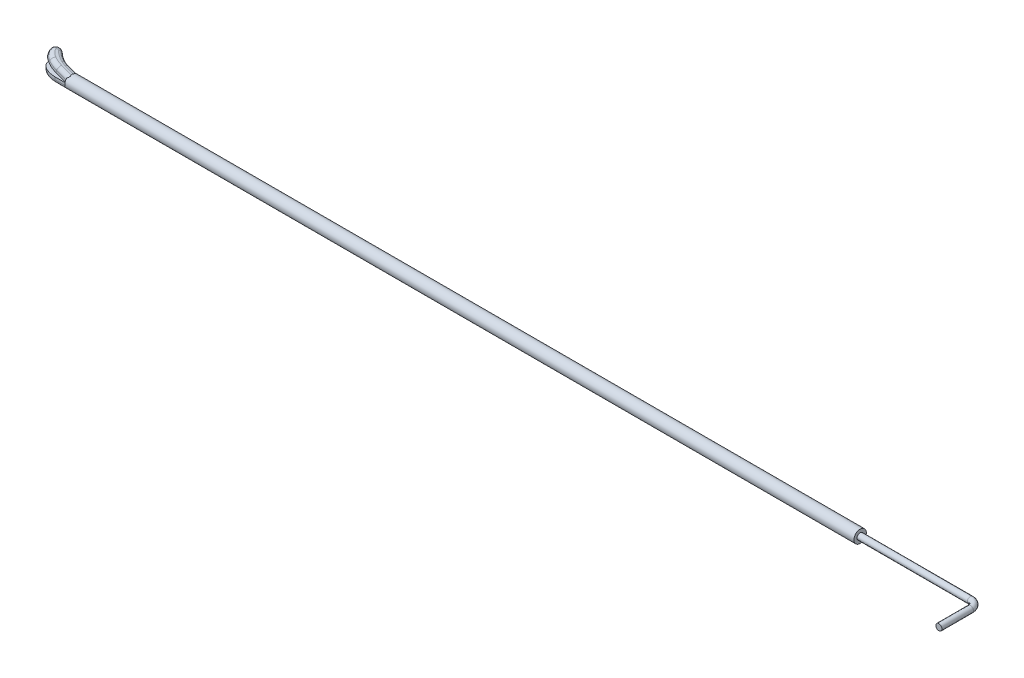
ISO-10303-21;
HEADER;
FILE_DESCRIPTION(('STEP AP214'),'2;1');
FILE_NAME('part.step','',(''),(''),'','','');
FILE_SCHEMA(('AUTOMOTIVE_DESIGN { 1 0 10303 214 1 1 1 1 }'));
ENDSEC;
DATA;
#1=APPLICATION_CONTEXT('core data for automotive mechanical design processes');
#2=APPLICATION_PROTOCOL_DEFINITION('international standard','automotive_design',2000,#1);
#3=PRODUCT_CONTEXT('',#1,'mechanical');
#4=PRODUCT('Part','Part','',(#3));
#5=PRODUCT_RELATED_PRODUCT_CATEGORY('part','',(#4));
#6=PRODUCT_DEFINITION_FORMATION('','',#4);
#7=PRODUCT_DEFINITION_CONTEXT('part definition',#1,'design');
#8=PRODUCT_DEFINITION('design','',#6,#7);
#9=PRODUCT_DEFINITION_SHAPE('','',#8);
#10=(LENGTH_UNIT() NAMED_UNIT(*) SI_UNIT(.MILLI.,.METRE.));
#11=(NAMED_UNIT(*) PLANE_ANGLE_UNIT() SI_UNIT($,.RADIAN.));
#12=(NAMED_UNIT(*) SI_UNIT($,.STERADIAN.) SOLID_ANGLE_UNIT());
#13=UNCERTAINTY_MEASURE_WITH_UNIT(LENGTH_MEASURE(1.E-05),#10,'distance_accuracy_value','');
#14=(GEOMETRIC_REPRESENTATION_CONTEXT(3) GLOBAL_UNCERTAINTY_ASSIGNED_CONTEXT((#13)) GLOBAL_UNIT_ASSIGNED_CONTEXT((#10,
#11,#12)) REPRESENTATION_CONTEXT('',''));
#15=CARTESIAN_POINT('',(0.,0.,0.));
#16=DIRECTION('',(0.,0.,1.));
#17=DIRECTION('',(1.,0.,0.));
#18=AXIS2_PLACEMENT_3D('',#15,#16,#17);
#19=CARTESIAN_POINT('',(97.2206239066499,0.000651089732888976,-0.000836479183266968));
#20=DIRECTION('',(1.,0.,0.));
#21=DIRECTION('',(0.,0.,-1.));
#22=AXIS2_PLACEMENT_3D('',#19,#20,#21);
#23=PLANE('',#22);
#24=CARTESIAN_POINT('',(97.2206239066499,0.000651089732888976,-0.000836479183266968));
#25=DIRECTION('',(1.,0.,0.));
#26=DIRECTION('',(0.,0.,-1.));
#27=AXIS2_PLACEMENT_3D('',#24,#25,#26);
#28=CIRCLE('',#27,1.);
#29=CARTESIAN_POINT('',(97.2206239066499,0.000651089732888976,-1.00083647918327));
#30=VERTEX_POINT('',#29);
#31=EDGE_CURVE('E284',#30,#30,#28,.T.);
#32=ORIENTED_EDGE('',*,*,#31,.T.);
#33=EDGE_LOOP('',(#32));
#34=FACE_BOUND('',#33,.T.);
#35=CARTESIAN_POINT('',(97.2206239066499,0.000651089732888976,-0.000836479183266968));
#36=DIRECTION('',(1.,0.,0.));
#37=DIRECTION('',(0.,0.,-1.));
#38=AXIS2_PLACEMENT_3D('',#35,#36,#37);
#39=CIRCLE('',#38,0.5);
#40=CARTESIAN_POINT('',(97.2206239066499,0.000651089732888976,-0.500836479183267));
#41=VERTEX_POINT('',#40);
#42=EDGE_CURVE('E1105',#41,#41,#39,.T.);
#43=ORIENTED_EDGE('',*,*,#42,.F.);
#44=EDGE_LOOP('',(#43));
#45=FACE_BOUND('',#44,.T.);
#46=ADVANCED_FACE('F51',(#34,#45),#23,.T.);
#47=CARTESIAN_POINT('',(29.9708392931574,0.000651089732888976,-0.000836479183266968));
#48=DIRECTION('',(1.,0.,0.));
#49=DIRECTION('',(0.,0.,-1.));
#50=AXIS2_PLACEMENT_3D('',#47,#48,#49);
#51=CYLINDRICAL_SURFACE('',#50,1.);
#52=CARTESIAN_POINT('',(-30.0291607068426,0.000651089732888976,-0.000836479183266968));
#53=DIRECTION('',(1.,0.,0.));
#54=DIRECTION('',(0.,0.,-1.));
#55=AXIS2_PLACEMENT_3D('',#52,#53,#54);
#56=CIRCLE('',#55,1.);
#57=CARTESIAN_POINT('',(-30.0291607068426,0.741261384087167,-0.672771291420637));
#58=VERTEX_POINT('',#57);
#59=CARTESIAN_POINT('',(-30.0291607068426,-0.805669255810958,-0.592315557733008));
#60=VERTEX_POINT('',#59);
#61=EDGE_CURVE('E685',#58,#60,#56,.F.);
#62=ORIENTED_EDGE('',*,*,#61,.F.);
#63=CARTESIAN_POINT('',(-29.8217487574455,0.989337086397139,-0.150836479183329));
#64=CARTESIAN_POINT('',(-29.8122192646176,0.985889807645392,-0.173693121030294));
#65=CARTESIAN_POINT('',(-29.8040790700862,0.981515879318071,-0.197049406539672));
#66=CARTESIAN_POINT('',(-29.7909844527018,0.970837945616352,-0.244393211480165));
#67=CARTESIAN_POINT('',(-29.7860537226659,0.964520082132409,-0.268384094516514));
#68=CARTESIAN_POINT('',(-29.7799246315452,0.949894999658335,-0.316383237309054));
#69=CARTESIAN_POINT('',(-29.778742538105,0.941579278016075,-0.340391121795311));
#70=CARTESIAN_POINT('',(-29.780644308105,0.923212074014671,-0.387510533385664));
#71=CARTESIAN_POINT('',(-29.7837162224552,0.913165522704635,-0.410624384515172));
#72=CARTESIAN_POINT('',(-29.7940463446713,0.892633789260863,-0.453483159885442));
#73=CARTESIAN_POINT('',(-29.8009716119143,0.882238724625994,-0.473350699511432));
#74=CARTESIAN_POINT('',(-29.8187467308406,0.861024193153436,-0.510957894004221));
#75=CARTESIAN_POINT('',(-29.8295908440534,0.850205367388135,-0.528700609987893));
#76=CARTESIAN_POINT('',(-29.8539542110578,0.829584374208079,-0.560483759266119));
#77=CARTESIAN_POINT('',(-29.867237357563,0.819763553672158,-0.57469514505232));
#78=CARTESIAN_POINT('',(-29.8964064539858,0.800795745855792,-0.600862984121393));
#79=CARTESIAN_POINT('',(-29.9123054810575,0.791652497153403,-0.612807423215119));
#80=CARTESIAN_POINT('',(-29.944346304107,0.775250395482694,-0.63341213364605));
#81=CARTESIAN_POINT('',(-29.9603080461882,0.767894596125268,-0.642280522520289));
#82=CARTESIAN_POINT('',(-29.9934121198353,0.754079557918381,-0.658452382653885));
#83=CARTESIAN_POINT('',(-30.0105571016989,0.747622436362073,-0.665752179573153));
#84=CARTESIAN_POINT('',(-30.0454276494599,0.735697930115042,-0.678910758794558));
#85=CARTESIAN_POINT('',(-30.0631427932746,0.73021878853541,-0.684787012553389));
#86=CARTESIAN_POINT('',(-30.0990439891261,0.72011507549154,-0.695402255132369));
#87=CARTESIAN_POINT('',(-30.1172271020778,0.715486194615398,-0.700147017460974));
#88=CARTESIAN_POINT('',(-30.1355800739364,0.711237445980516,-0.704446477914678));
#89=B_SPLINE_CURVE_WITH_KNOTS('',3,(#63,#64,#65,#66,#67,#68,#69,#70,#71,#72,#73,#74,#75,#76,#77,
#78,#79,#80,#81,#82,#83,#84,#85,#86,#87,#88),.UNSPECIFIED.,.F.,.F.,(4,2,2,2,2,2,2,2,2,2,2,2,4),
(0.,0.075032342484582,0.150612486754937,0.226520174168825,0.302215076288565,0.372205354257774,
0.442093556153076,0.50716125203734,0.57256470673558,0.631489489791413,0.690550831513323,
0.74884570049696,0.806836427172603),.UNSPECIFIED.);
#90=CARTESIAN_POINT('',(-29.8217487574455,0.989337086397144,-0.150836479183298));
#91=VERTEX_POINT('',#90);
#92=EDGE_CURVE('E329',#91,#58,#89,.T.);
#93=ORIENTED_EDGE('',*,*,#92,.F.);
#94=CARTESIAN_POINT('',(-27.1053563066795,0.000651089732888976,-0.000836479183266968));
#95=DIRECTION('',(0.342020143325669,0.939692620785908,0.));
#96=DIRECTION('',(0.939692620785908,-0.342020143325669,0.));
#97=AXIS2_PLACEMENT_3D('',#94,#95,#96);
#98=ELLIPSE('',#97,2.92380440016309,1.);
#99=CARTESIAN_POINT('',(-29.8217487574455,0.989337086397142,0.149163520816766));
#100=VERTEX_POINT('',#99);
#101=EDGE_CURVE('E290',#100,#91,#98,.F.);
#102=ORIENTED_EDGE('',*,*,#101,.F.);
#103=CARTESIAN_POINT('',(-29.8217487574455,0.989337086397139,0.149163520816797));
#104=CARTESIAN_POINT('',(-29.8122192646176,0.985889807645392,0.172020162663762));
#105=CARTESIAN_POINT('',(-29.8040790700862,0.981515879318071,0.195376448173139));
#106=CARTESIAN_POINT('',(-29.7909844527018,0.970837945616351,0.242720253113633));
#107=CARTESIAN_POINT('',(-29.7860537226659,0.964520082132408,0.266711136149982));
#108=CARTESIAN_POINT('',(-29.7799246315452,0.949894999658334,0.314710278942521));
#109=CARTESIAN_POINT('',(-29.778742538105,0.941579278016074,0.338718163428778));
#110=CARTESIAN_POINT('',(-29.780644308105,0.923212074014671,0.385837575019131));
#111=CARTESIAN_POINT('',(-29.7837162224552,0.913165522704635,0.408951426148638));
#112=CARTESIAN_POINT('',(-29.7940463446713,0.892633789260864,0.451810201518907));
#113=CARTESIAN_POINT('',(-29.8009716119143,0.882238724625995,0.471677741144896));
#114=CARTESIAN_POINT('',(-29.8187467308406,0.861024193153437,0.509284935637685));
#115=CARTESIAN_POINT('',(-29.8295908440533,0.850205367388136,0.527027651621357));
#116=CARTESIAN_POINT('',(-29.8539542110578,0.82958437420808,0.558810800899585));
#117=CARTESIAN_POINT('',(-29.8672373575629,0.819763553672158,0.573022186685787));
#118=CARTESIAN_POINT('',(-29.8964064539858,0.800795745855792,0.599190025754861));
#119=CARTESIAN_POINT('',(-29.9123054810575,0.791652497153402,0.611134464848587));
#120=CARTESIAN_POINT('',(-29.9443463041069,0.775250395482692,0.631739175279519));
#121=CARTESIAN_POINT('',(-29.9603080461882,0.767894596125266,0.640607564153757));
#122=CARTESIAN_POINT('',(-29.9934121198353,0.754079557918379,0.656779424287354));
#123=CARTESIAN_POINT('',(-30.0105571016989,0.747622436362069,0.664079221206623));
#124=CARTESIAN_POINT('',(-30.0454276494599,0.735697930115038,0.677237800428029));
#125=CARTESIAN_POINT('',(-30.0631427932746,0.730218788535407,0.68311405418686));
#126=CARTESIAN_POINT('',(-30.0990439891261,0.720115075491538,0.693729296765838));
#127=CARTESIAN_POINT('',(-30.1172271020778,0.715486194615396,0.698474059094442));
#128=CARTESIAN_POINT('',(-30.1355800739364,0.711237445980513,0.702773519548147));
#129=B_SPLINE_CURVE_WITH_KNOTS('',3,(#103,#104,#105,#106,#107,#108,#109,#110,#111,#112,#113,
#114,#115,#116,#117,#118,#119,#120,#121,#122,#123,#124,#125,#126,#127,#128),.UNSPECIFIED.,.F.,
.F.,(4,2,2,2,2,2,2,2,2,2,2,2,4),(0.,0.075032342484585,0.15061248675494,0.226520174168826,
0.302215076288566,0.37220535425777,0.442093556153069,0.50716125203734,0.572564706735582,
0.631489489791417,0.690550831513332,0.748845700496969,0.806836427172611),.UNSPECIFIED.);
#130=CARTESIAN_POINT('',(-29.7793760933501,0.938484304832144,0.346249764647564));
#131=VERTEX_POINT('',#130);
#132=EDGE_CURVE('E279',#100,#131,#129,.T.);
#133=ORIENTED_EDGE('',*,*,#132,.T.);
#134=CARTESIAN_POINT('',(-29.7793760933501,0.000651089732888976,-0.000836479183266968));
#135=DIRECTION('',(1.,0.,0.));
#136=DIRECTION('',(0.,0.,-1.));
#137=AXIS2_PLACEMENT_3D('',#134,#135,#136);
#138=CIRCLE('',#137,1.);
#139=CARTESIAN_POINT('',(-29.7793760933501,0.938100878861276,0.347284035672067));
#140=VERTEX_POINT('',#139);
#141=EDGE_CURVE('E274',#140,#131,#138,.F.);
#142=ORIENTED_EDGE('',*,*,#141,.F.);
#143=CARTESIAN_POINT('',(-30.0291607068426,0.741261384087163,0.671098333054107));
#144=VERTEX_POINT('',#143);
#145=EDGE_CURVE('E280',#140,#144,#129,.T.);
#146=ORIENTED_EDGE('',*,*,#145,.T.);
#147=CARTESIAN_POINT('',(-30.0291607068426,0.000651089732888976,-0.000836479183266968));
#148=DIRECTION('',(1.,0.,0.));
#149=DIRECTION('',(0.,0.,-1.));
#150=AXIS2_PLACEMENT_3D('',#147,#148,#149);
#151=CIRCLE('',#150,1.);
#152=CARTESIAN_POINT('',(-30.0291607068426,-0.805669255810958,0.590642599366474));
#153=VERTEX_POINT('',#152);
#154=EDGE_CURVE('E301',#153,#144,#151,.F.);
#155=ORIENTED_EDGE('',*,*,#154,.F.);
#156=CARTESIAN_POINT('',(-30.0291607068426,0.000651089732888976,-0.000836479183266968));
#157=DIRECTION('',(1.,0.,0.));
#158=DIRECTION('',(0.,0.,-1.));
#159=AXIS2_PLACEMENT_3D('',#156,#157,#158);
#160=CIRCLE('',#159,1.);
#161=CARTESIAN_POINT('',(-30.0291607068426,-0.999348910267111,-0.000836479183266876));
#162=VERTEX_POINT('',#161);
#163=EDGE_CURVE('E304',#153,#162,#160,.T.);
#164=ORIENTED_EDGE('',*,*,#163,.T.);
#165=CARTESIAN_POINT('',(-30.0291607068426,0.000651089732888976,-0.000836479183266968));
#166=DIRECTION('',(1.,0.,0.));
#167=DIRECTION('',(0.,0.,-1.));
#168=AXIS2_PLACEMENT_3D('',#165,#166,#167);
#169=CIRCLE('',#168,1.);
#170=EDGE_CURVE('E293',#162,#60,#169,.T.);
#171=ORIENTED_EDGE('',*,*,#170,.T.);
#172=EDGE_LOOP('',(#62,#93,#102,#133,#142,#146,#155,#164,#171));
#173=FACE_BOUND('',#172,.T.);
#174=ORIENTED_EDGE('',*,*,#31,.F.);
#175=EDGE_LOOP('',(#174));
#176=FACE_BOUND('',#175,.T.);
#177=ADVANCED_FACE('F287',(#173,#176),#51,.T.);
#178=CARTESIAN_POINT('',(-33.7110934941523,-0.999284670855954,-1.07651908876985));
#179=CARTESIAN_POINT('',(-33.7069783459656,-0.999306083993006,-1.07259623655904));
#180=CARTESIAN_POINT('',(-33.7028631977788,-0.999327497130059,-1.06867338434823));
#181=CARTESIAN_POINT('',(-33.6987480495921,-0.999348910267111,-1.06475053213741));
#182=CARTESIAN_POINT('',(-33.287233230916,-1.00149022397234,-0.672465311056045));
#183=CARTESIAN_POINT('',(-32.7783968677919,-1.00097648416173,-0.403077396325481));
#184=CARTESIAN_POINT('',(-32.2388675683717,-0.999348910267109,-0.24973195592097));
#185=CARTESIAN_POINT('',(-32.2334722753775,-0.999332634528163,-0.248198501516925));
#186=CARTESIAN_POINT('',(-32.2280769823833,-0.999316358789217,-0.24666504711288));
#187=CARTESIAN_POINT('',(-32.2226816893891,-0.999300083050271,-0.245131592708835));
#188=CARTESIAN_POINT('',(-33.5385501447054,-0.999284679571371,-1.2553966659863));
#189=CARTESIAN_POINT('',(-33.5347880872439,-0.999306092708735,-1.25181039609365));
#190=CARTESIAN_POINT('',(-33.5310260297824,-0.999327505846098,-1.24822412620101));
#191=CARTESIAN_POINT('',(-33.5272639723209,-0.999348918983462,-1.24463785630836));
#192=CARTESIAN_POINT('',(-33.1510582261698,-1.0014902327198,-0.886010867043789));
#193=CARTESIAN_POINT('',(-32.6740363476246,-1.00097649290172,-0.631787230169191));
#194=CARTESIAN_POINT('',(-32.1709235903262,-0.99934891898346,-0.488792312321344));
#195=CARTESIAN_POINT('',(-32.1658924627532,-0.999332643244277,-0.487362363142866));
#196=CARTESIAN_POINT('',(-32.1608613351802,-0.999316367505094,-0.485932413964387));
#197=CARTESIAN_POINT('',(-32.1558302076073,-0.999300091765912,-0.484502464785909));
#198=CARTESIAN_POINT('',(-33.4165435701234,-0.823567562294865,-1.38188221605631));
#199=CARTESIAN_POINT('',(-33.4130311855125,-0.823582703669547,-1.37853394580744));
#200=CARTESIAN_POINT('',(-33.4095188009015,-0.823597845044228,-1.37518567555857));
#201=CARTESIAN_POINT('',(-33.4060064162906,-0.82361298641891,-1.3718374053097));
#202=CARTESIAN_POINT('',(-33.0547679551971,-0.825127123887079,-1.03701038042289));
#203=CARTESIAN_POINT('',(-32.600242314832,-0.824763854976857,-0.79350950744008));
#204=CARTESIAN_POINT('',(-32.1228799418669,-0.823612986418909,-0.657833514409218));
#205=CARTESIAN_POINT('',(-32.1181063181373,-0.823601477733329,-0.656476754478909));
#206=CARTESIAN_POINT('',(-32.1133326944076,-0.82358996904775,-0.655119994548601));
#207=CARTESIAN_POINT('',(-32.108559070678,-0.82357846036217,-0.653763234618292));
#208=CARTESIAN_POINT('',(-33.2945369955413,-0.647850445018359,-1.50836776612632));
#209=CARTESIAN_POINT('',(-33.291274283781,-0.647859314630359,-1.50525749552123));
#210=CARTESIAN_POINT('',(-33.2880115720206,-0.647868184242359,-1.50214722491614));
#211=CARTESIAN_POINT('',(-33.2847488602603,-0.647877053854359,-1.49903695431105));
#212=CARTESIAN_POINT('',(-32.9584776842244,-0.648764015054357,-1.188009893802));
#213=CARTESIAN_POINT('',(-32.5264482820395,-0.648551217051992,-0.955231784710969));
#214=CARTESIAN_POINT('',(-32.0748362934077,-0.647877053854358,-0.826874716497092));
#215=CARTESIAN_POINT('',(-32.0703201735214,-0.647870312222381,-0.825591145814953));
#216=CARTESIAN_POINT('',(-32.065804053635,-0.647863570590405,-0.824307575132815));
#217=CARTESIAN_POINT('',(-32.0612879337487,-0.647856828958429,-0.823024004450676));
#218=CARTESIAN_POINT('',(-33.2945369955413,-0.399348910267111,-1.50836776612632));
#219=CARTESIAN_POINT('',(-33.291274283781,-0.399348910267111,-1.50525749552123));
#220=CARTESIAN_POINT('',(-33.2880115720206,-0.399348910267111,-1.50214722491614));
#221=CARTESIAN_POINT('',(-33.2847488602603,-0.399348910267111,-1.49903695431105));
#222=CARTESIAN_POINT('',(-32.9584776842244,-0.399348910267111,-1.18800989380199));
#223=CARTESIAN_POINT('',(-32.5264482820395,-0.399348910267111,-0.955231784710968));
#224=CARTESIAN_POINT('',(-32.0748362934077,-0.399348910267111,-0.826874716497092));
#225=CARTESIAN_POINT('',(-32.0703201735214,-0.399348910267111,-0.825591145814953));
#226=CARTESIAN_POINT('',(-32.065804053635,-0.399348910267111,-0.824307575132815));
#227=CARTESIAN_POINT('',(-32.0612879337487,-0.399348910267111,-0.823024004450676));
#228=CARTESIAN_POINT('',(-33.2945369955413,-0.220562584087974,-1.50836776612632));
#229=CARTESIAN_POINT('',(-33.291274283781,-0.220556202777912,-1.50525749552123));
#230=CARTESIAN_POINT('',(-33.2880115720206,-0.22054982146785,-1.50214722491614));
#231=CARTESIAN_POINT('',(-33.2847488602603,-0.220543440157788,-1.49903695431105));
#232=CARTESIAN_POINT('',(-32.9584776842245,-0.219905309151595,-1.18800989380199));
#233=CARTESIAN_POINT('',(-32.5264482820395,-0.220058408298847,-0.955231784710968));
#234=CARTESIAN_POINT('',(-32.0748362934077,-0.220543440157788,-0.826874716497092));
#235=CARTESIAN_POINT('',(-32.0703201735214,-0.220548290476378,-0.825591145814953));
#236=CARTESIAN_POINT('',(-32.065804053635,-0.220553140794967,-0.824307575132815));
#237=CARTESIAN_POINT('',(-32.0612879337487,-0.220557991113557,-0.823024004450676));
#238=CARTESIAN_POINT('',(-33.2945369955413,-0.0417762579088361,-1.50836776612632));
#239=CARTESIAN_POINT('',(-33.291274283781,-0.0417634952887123,-1.50525749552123));
#240=CARTESIAN_POINT('',(-33.2880115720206,-0.0417507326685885,-1.50214722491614));
#241=CARTESIAN_POINT('',(-33.2847488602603,-0.0417379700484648,-1.49903695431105));
#242=CARTESIAN_POINT('',(-32.9584776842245,-0.0404617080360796,-1.18800989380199));
#243=CARTESIAN_POINT('',(-32.5264482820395,-0.0407679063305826,-0.955231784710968));
#244=CARTESIAN_POINT('',(-32.0748362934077,-0.0417379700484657,-0.826874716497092));
#245=CARTESIAN_POINT('',(-32.0703201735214,-0.0417476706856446,-0.825591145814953));
#246=CARTESIAN_POINT('',(-32.065804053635,-0.0417573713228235,-0.824307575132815));
#247=CARTESIAN_POINT('',(-32.0612879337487,-0.0417670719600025,-0.823024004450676));
#248=CARTESIAN_POINT('',(-33.2945369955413,-0.0166290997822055,-1.50836776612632));
#249=CARTESIAN_POINT('',(-33.291274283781,-0.0166154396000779,-1.50525749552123));
#250=CARTESIAN_POINT('',(-33.2880115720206,-0.0166017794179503,-1.50214722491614));
#251=CARTESIAN_POINT('',(-33.2847488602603,-0.0165881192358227,-1.49903695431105));
#252=CARTESIAN_POINT('',(-32.9584776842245,-0.0152221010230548,-1.18800989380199));
#253=CARTESIAN_POINT('',(-32.5264482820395,-0.0155498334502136,-0.955231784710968));
#254=CARTESIAN_POINT('',(-32.0748362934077,-0.0165881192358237,-0.826874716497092));
#255=CARTESIAN_POINT('',(-32.0703201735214,-0.0165985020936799,-0.825591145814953));
#256=CARTESIAN_POINT('',(-32.065804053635,-0.0166088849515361,-0.824307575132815));
#257=CARTESIAN_POINT('',(-32.0612879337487,-0.0166192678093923,-0.823024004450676));
#258=CARTESIAN_POINT('',(-33.2945369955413,0.00851805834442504,-1.50836776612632));
#259=CARTESIAN_POINT('',(-33.291274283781,0.00853261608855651,-1.50525749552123));
#260=CARTESIAN_POINT('',(-33.2880115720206,0.00854717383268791,-1.50214722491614));
#261=CARTESIAN_POINT('',(-33.2847488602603,0.00856173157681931,-1.49903695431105));
#262=CARTESIAN_POINT('',(-32.9584776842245,0.01001750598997,-1.18800989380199));
#263=CARTESIAN_POINT('',(-32.5264482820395,0.00966823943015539,-0.955231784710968));
#264=CARTESIAN_POINT('',(-32.0748362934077,0.00856173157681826,-0.826874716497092));
#265=CARTESIAN_POINT('',(-32.0703201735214,0.00855066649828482,-0.825591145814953));
#266=CARTESIAN_POINT('',(-32.065804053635,0.00853960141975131,-0.824307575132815));
#267=CARTESIAN_POINT('',(-32.0612879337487,0.0085285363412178,-0.823024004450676));
#268=(BOUNDED_SURFACE() B_SPLINE_SURFACE(2,3,((#178,#179,#180,#181,#182,#183,#184,#185,#186,
#187),(#188,#189,#190,#191,#192,#193,#194,#195,#196,#197),(#198,#199,#200,#201,#202,#203,#204,
#205,#206,#207),(#208,#209,#210,#211,#212,#213,#214,#215,#216,#217),(#218,#219,#220,#221,#222,
#223,#224,#225,#226,#227),(#228,#229,#230,#231,#232,#233,#234,#235,#236,#237),(#238,#239,#240,
#241,#242,#243,#244,#245,#246,#247),(#248,#249,#250,#251,#252,#253,#254,#255,#256,#257),(#258,
#259,#260,#261,#262,#263,#264,#265,#266,#267)),.UNSPECIFIED.,.F.,.F.,
.F.) B_SPLINE_SURFACE_WITH_KNOTS((3,2,2,2,3),(4,3,3,4),(0.,0.5,1.,1.38936766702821,
1.44413410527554),(-0.01,0.,1.,1.01),
.UNSPECIFIED.) GEOMETRIC_REPRESENTATION_ITEM() RATIONAL_B_SPLINE_SURFACE(((1.,1.,1.,1.,1.,1.,1.,
1.,1.,1.),(0.923879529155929,0.923879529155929,0.923879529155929,0.923879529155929,
0.92387952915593,0.92387952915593,0.923879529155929,0.923879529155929,0.923879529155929,
0.923879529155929),(1.,1.,1.,1.,1.,1.,1.,1.,1.,1.),(0.923879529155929,0.923879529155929,
0.923879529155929,0.923879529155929,0.92387952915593,0.92387952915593,0.923879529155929,
0.923879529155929,0.923879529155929,0.923879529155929),(1.,1.,1.,1.,1.,1.,1.,1.,1.,1.),(1.,1.,
1.,1.,1.,1.,1.,1.,1.,1.),(1.,1.,1.,1.,1.,1.,1.,1.,1.,1.),(1.,1.,1.,1.,1.,1.,1.,1.,1.,1.),(1.,1.,
1.,1.,1.,1.,1.,1.,1.,1.))) REPRESENTATION_ITEM('') SURFACE());
#269=CARTESIAN_POINT('',(-32.2388675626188,-0.399348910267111,-0.249731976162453));
#270=DIRECTION('',(0.961904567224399,0.,0.273385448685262));
#271=DIRECTION('',(-0.273385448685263,0.,0.961904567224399));
#272=AXIS2_PLACEMENT_3D('',#269,#270,#271);
#273=CIRCLE('',#272,0.6);
#274=CARTESIAN_POINT('',(-32.2388675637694,-0.999348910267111,-0.249731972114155));
#275=VERTEX_POINT('',#274);
#276=CARTESIAN_POINT('',(-32.0800184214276,-0.203944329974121,-0.80864143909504));
#277=VERTEX_POINT('',#276);
#278=EDGE_CURVE('E676',#275,#277,#273,.T.);
#279=CARTESIAN_POINT('',(-32.2388675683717,-0.999348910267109,-0.24973195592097));
#280=CARTESIAN_POINT('',(-32.3064871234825,-0.999552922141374,-0.268980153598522));
#281=CARTESIAN_POINT('',(-32.3735841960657,-0.999739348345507,-0.290079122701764));
#282=CARTESIAN_POINT('',(-32.5065247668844,-1.00007111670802,-0.335995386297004));
#283=CARTESIAN_POINT('',(-32.5723677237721,-1.00021644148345,-0.360814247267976));
#284=CARTESIAN_POINT('',(-32.7025433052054,-1.00045992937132,-0.414174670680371));
#285=CARTESIAN_POINT('',(-32.7668757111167,-1.00055808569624,-0.442716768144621));
#286=CARTESIAN_POINT('',(-32.8937079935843,-1.00070064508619,-0.503648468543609));
#287=CARTESIAN_POINT('',(-32.9562075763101,-1.00074503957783,-0.536038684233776));
#288=CARTESIAN_POINT('',(-33.0515762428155,-1.00076841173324,-0.588924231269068));
#289=CARTESIAN_POINT('',(-33.0851222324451,-1.0007678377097,-0.608212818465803));
#290=CARTESIAN_POINT('',(-33.1417257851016,-1.00075107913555,-0.641940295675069));
#291=CARTESIAN_POINT('',(-33.1649389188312,-1.00073958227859,-0.656117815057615));
#292=CARTESIAN_POINT('',(-33.2154721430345,-1.00070380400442,-0.687804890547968));
#293=CARTESIAN_POINT('',(-33.2427202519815,-1.00067748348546,-0.705429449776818));
#294=CARTESIAN_POINT('',(-33.3010850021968,-1.00060512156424,-0.744376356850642));
#295=CARTESIAN_POINT('',(-33.332111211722,-1.00055657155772,-0.765834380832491));
#296=CARTESIAN_POINT('',(-33.3977250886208,-1.00043103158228,-0.812888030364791));
#297=CARTESIAN_POINT('',(-33.4321999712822,-1.00035100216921,-0.838641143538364));
#298=CARTESIAN_POINT('',(-33.5043301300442,-1.00015176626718,-0.894791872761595));
#299=CARTESIAN_POINT('',(-33.5418463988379,-1.00002892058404,-0.925368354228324));
#300=CARTESIAN_POINT('',(-33.6195914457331,-0.999731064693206,-0.991740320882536));
#301=CARTESIAN_POINT('',(-33.6596496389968,-0.999551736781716,-1.02773569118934));
#302=CARTESIAN_POINT('',(-33.6987480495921,-0.999348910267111,-1.06475053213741));
#303=B_SPLINE_CURVE_WITH_KNOTS('',3,(#279,#280,#281,#282,#283,#284,#285,#286,#287,#288,#289,
#290,#291,#292,#293,#294,#295,#296,#297,#298,#299,#300,#301,#302),.UNSPECIFIED.,.F.,.F.,(4,2,2,
2,2,2,2,2,2,2,2,4),(0.,0.210897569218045,0.421884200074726,0.632901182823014,0.843951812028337,
0.960024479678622,1.04161823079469,1.13895887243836,1.25210853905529,1.38117117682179,
1.52631636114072,1.68781383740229),.UNSPECIFIED.);
#304=CARTESIAN_POINT('',(-33.6987480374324,-0.999348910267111,-1.0647505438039));
#305=VERTEX_POINT('',#304);
#306=EDGE_CURVE('E283',#275,#305,#303,.T.);
#307=CARTESIAN_POINT('',(-33.6987480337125,-0.399348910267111,-1.06475054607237));
#308=DIRECTION('',(-0.723810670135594,0.,-0.689998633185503));
#309=DIRECTION('',(0.689998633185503,0.,-0.723810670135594));
#310=AXIS2_PLACEMENT_3D('',#307,#308,#309);
#311=CIRCLE('',#310,0.6);
#312=CARTESIAN_POINT('',(-33.2847500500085,-0.199348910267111,-1.49903808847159));
#313=VERTEX_POINT('',#312);
#314=EDGE_CURVE('E450',#313,#305,#311,.T.);
#315=CARTESIAN_POINT('',(-37.288096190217,0.00065108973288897,-5.31533898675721));
#316=CARTESIAN_POINT('',(-36.9978982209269,0.000651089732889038,-5.03866549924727));
#317=CARTESIAN_POINT('',(-36.7076770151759,0.000651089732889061,-4.76201629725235));
#318=CARTESIAN_POINT('',(-35.895314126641,0.000651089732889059,-3.98767036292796));
#319=CARTESIAN_POINT('',(-35.373161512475,0.000651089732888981,-3.4899850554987));
#320=CARTESIAN_POINT('',(-34.5900691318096,0.000651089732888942,-2.74331438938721));
#321=CARTESIAN_POINT('',(-34.3290610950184,0.000651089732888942,-2.49440038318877));
#322=CARTESIAN_POINT('',(-33.9373560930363,0.000651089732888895,-2.12123103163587));
#323=CARTESIAN_POINT('',(-33.806755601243,0.000651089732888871,-1.99687485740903));
#324=CARTESIAN_POINT('',(-33.5459177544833,0.000651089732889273,-1.74778297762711));
#325=CARTESIAN_POINT('',(-33.4156803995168,0.000651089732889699,-1.62304727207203));
#326=CARTESIAN_POINT('',(-33.2780878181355,0.000651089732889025,-1.49272802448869));
#327=CARTESIAN_POINT('',(-33.2714249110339,0.00065108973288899,-1.48642090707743));
#328=CARTESIAN_POINT('',(-33.2580086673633,0.000651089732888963,-1.47390396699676));
#329=CARTESIAN_POINT('',(-33.2512553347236,0.000651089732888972,-1.46769414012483));
#330=CARTESIAN_POINT('',(-33.2308964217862,0.000651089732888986,-1.44917718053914));
#331=CARTESIAN_POINT('',(-33.2171900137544,0.000651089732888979,-1.43698075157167));
#332=CARTESIAN_POINT('',(-33.1895114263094,0.000651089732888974,-1.41290579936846));
#333=CARTESIAN_POINT('',(-33.1755393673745,0.000651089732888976,-1.40102713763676));
#334=CARTESIAN_POINT('',(-33.1473392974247,0.000651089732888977,-1.37757461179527));
#335=CARTESIAN_POINT('',(-33.133111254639,0.000651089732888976,-1.36600078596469));
#336=CARTESIAN_POINT('',(-33.0900891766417,0.000651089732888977,-1.3317598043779));
#337=CARTESIAN_POINT('',(-33.0609297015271,0.000651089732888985,-1.3095492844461));
#338=CARTESIAN_POINT('',(-33.0017186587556,0.000651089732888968,-1.26632934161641));
#339=CARTESIAN_POINT('',(-32.9716667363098,0.000651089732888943,-1.24532040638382));
#340=CARTESIAN_POINT('',(-32.9107999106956,0.000651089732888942,-1.20452810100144));
#341=CARTESIAN_POINT('',(-32.8799860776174,0.000651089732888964,-1.18474313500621));
#342=CARTESIAN_POINT('',(-32.8176369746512,0.000651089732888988,-1.14636461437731));
#343=CARTESIAN_POINT('',(-32.7861018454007,0.00065108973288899,-1.12777083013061));
#344=CARTESIAN_POINT('',(-32.6904427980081,0.000651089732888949,-1.07372536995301));
#345=CARTESIAN_POINT('',(-32.6253072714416,0.000651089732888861,-1.04003762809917));
#346=CARTESIAN_POINT('',(-32.5259785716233,0.000651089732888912,-0.993055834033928));
#347=CARTESIAN_POINT('',(-32.4926060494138,0.000651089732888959,-0.977989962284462));
#348=CARTESIAN_POINT('',(-32.4253555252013,0.000651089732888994,-0.9490366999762));
#349=CARTESIAN_POINT('',(-32.3914775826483,0.000651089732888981,-0.935149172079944));
#350=CARTESIAN_POINT('',(-32.323268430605,0.000651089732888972,-0.90857336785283));
#351=CARTESIAN_POINT('',(-32.2889373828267,0.000651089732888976,-0.895884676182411));
#352=CARTESIAN_POINT('',(-32.2371322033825,0.000651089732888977,-0.877732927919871));
#353=CARTESIAN_POINT('',(-32.2198115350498,0.000651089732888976,-0.871828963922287));
#354=CARTESIAN_POINT('',(-32.1850584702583,0.000651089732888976,-0.860358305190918));
#355=CARTESIAN_POINT('',(-32.1676260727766,0.000651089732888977,-0.854791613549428));
#356=CARTESIAN_POINT('',(-32.010899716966,0.000651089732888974,-0.805587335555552));
#357=CARTESIAN_POINT('',(-31.8699909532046,0.000651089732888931,-0.767317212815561));
#358=CARTESIAN_POINT('',(-31.1662130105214,0.000651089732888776,-0.573970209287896));
#359=CARTESIAN_POINT('',(-30.605200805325,0.000651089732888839,-0.412786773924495));
#360=CARTESIAN_POINT('',(-28.8764358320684,0.000651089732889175,0.0897019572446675));
#361=CARTESIAN_POINT('',(-27.71044209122,0.0006510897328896,0.436791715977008));
#362=CARTESIAN_POINT('',(-26.5335571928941,0.000651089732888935,0.748066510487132));
#363=B_SPLINE_CURVE_WITH_KNOTS('',3,(#315,#316,#317,#318,#319,#320,#321,#322,#323,#324,#325,
#326,#327,#328,#329,#330,#331,#332,#333,#334,#335,#336,#337,#338,#339,#340,#341,#342,#343,#344,
#345,#346,#347,#348,#349,#350,#351,#352,#353,#354,#355,#356,#357,#358,#359,#360,#361,#362),
.UNSPECIFIED.,.F.,.F.,(4,2,2,2,2,2,2,2,2,2,2,2,2,2,2,2,2,2,2,2,2,2,2,4),(0.,1.20285828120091,
3.3668834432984,4.44889602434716,4.98990231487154,5.53090860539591,5.55843218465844,
5.5859545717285,5.6409914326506,5.69600390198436,5.75102324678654,5.86095282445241,
5.97092670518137,6.08075403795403,6.19056013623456,6.41032360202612,6.52015428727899,
6.62997215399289,6.7397518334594,6.79464695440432,6.84954257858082,7.28745846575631,
9.03866619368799,12.6888868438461),.UNSPECIFIED.);
#364=EDGE_CURVE('E1071',#313,#277,#363,.T.);
#365=ORIENTED_EDGE('',*,*,#278,.F.);
#366=ORIENTED_EDGE('',*,*,#306,.T.);
#367=ORIENTED_EDGE('',*,*,#314,.F.);
#368=ORIENTED_EDGE('',*,*,#364,.T.);
#369=EDGE_LOOP('',(#365,#366,#367,#368));
#370=FACE_BOUND('',#369,.T.);
#371=ADVANCED_FACE('F325',(#370),#268,.T.);
#372=CARTESIAN_POINT('',(-0.0291607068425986,-0.999348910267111,-0.000836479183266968));
#373=DIRECTION('',(0.,1.,0.));
#374=DIRECTION('',(0.,0.,1.));
#375=AXIS2_PLACEMENT_3D('',#372,#373,#374);
#376=PLANE('',#375);
#377=DIRECTION('',(0.,0.,1.));
#378=VECTOR('',#377,1.);
#379=CARTESIAN_POINT('',(-30.0291607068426,-0.999348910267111,-0.000836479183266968));
#380=LINE('',#379,#378);
#381=CARTESIAN_POINT('',(-30.0291607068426,-0.999348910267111,0.149163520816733));
#382=VERTEX_POINT('',#381);
#383=EDGE_CURVE('E1132',#382,#162,#380,.F.);
#384=ORIENTED_EDGE('',*,*,#383,.F.);
#385=DIRECTION('',(-1.,0.,0.));
#386=VECTOR('',#385,1.);
#387=CARTESIAN_POINT('',(112.305527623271,-0.999348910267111,0.149163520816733));
#388=LINE('',#387,#386);
#389=CARTESIAN_POINT('',(-31.8554931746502,-0.999348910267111,0.149163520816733));
#390=VERTEX_POINT('',#389);
#391=EDGE_CURVE('E639',#390,#382,#388,.F.);
#392=ORIENTED_EDGE('',*,*,#391,.F.);
#393=CARTESIAN_POINT('',(-31.8554931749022,-0.999348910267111,-3.07083647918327));
#394=DIRECTION('',(0.,1.,0.));
#395=DIRECTION('',(-0.387400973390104,0.,0.921911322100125));
#396=AXIS2_PLACEMENT_3D('',#393,#394,#395);
#397=CIRCLE('',#396,3.22);
#398=CARTESIAN_POINT('',(-33.102924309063,-0.999348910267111,-0.102282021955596));
#399=VERTEX_POINT('',#398);
#400=EDGE_CURVE('E640',#399,#390,#397,.T.);
#401=ORIENTED_EDGE('',*,*,#400,.F.);
#402=CARTESIAN_POINT('',(-33.9571813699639,-0.999348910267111,-1.00965382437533));
#403=CARTESIAN_POINT('',(-33.9577321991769,-0.999348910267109,-1.00827408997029));
#404=CARTESIAN_POINT('',(-33.9582663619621,-0.99934891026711,-1.00688743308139));
#405=CARTESIAN_POINT('',(-33.9593240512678,-0.999348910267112,-1.00401739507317));
#406=CARTESIAN_POINT('',(-33.9598451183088,-0.999348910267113,-1.0025331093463));
#407=CARTESIAN_POINT('',(-33.9608666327,-0.999348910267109,-0.99944396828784));
#408=CARTESIAN_POINT('',(-33.9613632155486,-0.999348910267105,-0.997837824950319));
#409=CARTESIAN_POINT('',(-33.9623250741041,-0.999348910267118,-0.994476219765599));
#410=CARTESIAN_POINT('',(-33.9627846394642,-0.999348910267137,-0.992719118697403));
#411=CARTESIAN_POINT('',(-33.9636602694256,-0.999348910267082,-0.989020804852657));
#412=CARTESIAN_POINT('',(-33.9640682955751,-0.999348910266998,-0.98707768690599));
#413=CARTESIAN_POINT('',(-33.9648271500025,-0.999348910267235,-0.982965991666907));
#414=CARTESIAN_POINT('',(-33.9651672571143,-0.9993489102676,-0.980795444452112));
#415=CARTESIAN_POINT('',(-33.965774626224,-0.999348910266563,-0.976180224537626));
#416=CARTESIAN_POINT('',(-33.9660283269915,-0.999348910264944,-0.973733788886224));
#417=CARTESIAN_POINT('',(-33.9664446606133,-0.999348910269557,-0.968516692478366));
#418=CARTESIAN_POINT('',(-33.9665913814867,-0.999348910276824,-0.965744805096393));
#419=CARTESIAN_POINT('',(-33.9667767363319,-0.999348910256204,-0.959856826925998));
#420=CARTESIAN_POINT('',(-33.9667998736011,-0.999348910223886,-0.956740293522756));
#421=CARTESIAN_POINT('',(-33.9667175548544,-0.999348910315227,-0.950156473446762));
#422=CARTESIAN_POINT('',(-33.9665972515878,-0.999348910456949,-0.946689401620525));
#423=CARTESIAN_POINT('',(-33.9662061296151,-0.999348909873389,-0.939401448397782));
#424=CARTESIAN_POINT('',(-33.9659209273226,-0.999348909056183,-0.935581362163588));
#425=CARTESIAN_POINT('',(-33.9651764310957,-0.999348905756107,-0.927588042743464));
#426=CARTESIAN_POINT('',(-33.9647030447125,-0.999348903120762,-0.923416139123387));
#427=CARTESIAN_POINT('',(-33.9635568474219,-0.999348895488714,-0.91472392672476));
#428=CARTESIAN_POINT('',(-33.9628700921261,-0.999348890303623,-0.910205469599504));
#429=CARTESIAN_POINT('',(-33.9612699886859,-0.999348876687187,-0.900829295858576));
#430=CARTESIAN_POINT('',(-33.9603427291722,-0.999348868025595,-0.89597396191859));
#431=CARTESIAN_POINT('',(-33.9582322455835,-0.999348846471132,-0.885938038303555));
#432=CARTESIAN_POINT('',(-33.9570350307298,-0.999348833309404,-0.880760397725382));
#433=CARTESIAN_POINT('',(-33.9543539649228,-0.99934880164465,-0.870098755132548));
#434=CARTESIAN_POINT('',(-33.9528560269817,-0.999348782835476,-0.864618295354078));
#435=CARTESIAN_POINT('',(-33.9495369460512,-0.999348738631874,-0.853375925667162));
#436=CARTESIAN_POINT('',(-33.9477013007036,-0.999348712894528,-0.847618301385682));
#437=CARTESIAN_POINT('',(-33.9436845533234,-0.999348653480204,-0.835835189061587));
#438=CARTESIAN_POINT('',(-33.9414892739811,-0.999348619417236,-0.829814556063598));
#439=CARTESIAN_POINT('',(-33.9367421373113,-0.999348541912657,-0.817508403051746));
#440=CARTESIAN_POINT('',(-33.9341769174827,-0.999348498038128,-0.811228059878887));
#441=CARTESIAN_POINT('',(-33.9286768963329,-0.999348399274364,-0.798408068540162));
#442=CARTESIAN_POINT('',(-33.9257293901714,-0.999348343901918,-0.791873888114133));
#443=CARTESIAN_POINT('',(-33.9194538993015,-0.999348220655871,-0.778553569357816));
#444=CARTESIAN_POINT('',(-33.9161139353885,-0.999348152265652,-0.771773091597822));
#445=CARTESIAN_POINT('',(-33.9090442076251,-0.999348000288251,-0.757969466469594));
#446=CARTESIAN_POINT('',(-33.9053032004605,-0.999347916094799,-0.750952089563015));
#447=CARTESIAN_POINT('',(-33.8974222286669,-0.99934773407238,-0.736687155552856));
#448=CARTESIAN_POINT('',(-33.8932716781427,-0.999347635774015,-0.729445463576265));
#449=CARTESIAN_POINT('',(-33.8845702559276,-0.999347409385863,-0.714742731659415));
#450=CARTESIAN_POINT('',(-33.8800097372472,-0.999347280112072,-0.707287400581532));
#451=CARTESIAN_POINT('',(-33.8728566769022,-0.999347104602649,-0.695971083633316));
#452=CARTESIAN_POINT('',(-33.8703419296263,-0.999347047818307,-0.692060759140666));
#453=CARTESIAN_POINT('',(-33.8648228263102,-0.999346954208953,-0.683631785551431));
#454=CARTESIAN_POINT('',(-33.8618068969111,-0.999346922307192,-0.679120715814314));
#455=CARTESIAN_POINT('',(-33.8512889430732,-0.99934684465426,-0.663672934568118));
#456=CARTESIAN_POINT('',(-33.8435980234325,-0.999346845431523,-0.652864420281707));
#457=CARTESIAN_POINT('',(-33.8258515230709,-0.999346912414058,-0.628859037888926));
#458=CARTESIAN_POINT('',(-33.8156867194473,-0.999346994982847,-0.615743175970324));
#459=CARTESIAN_POINT('',(-33.7926935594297,-0.99934721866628,-0.587292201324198));
#460=CARTESIAN_POINT('',(-33.7797463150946,-0.999347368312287,-0.572053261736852));
#461=CARTESIAN_POINT('',(-33.7509284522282,-0.999347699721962,-0.539659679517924));
#462=CARTESIAN_POINT('',(-33.7349333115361,-0.999347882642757,-0.522615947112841));
#463=CARTESIAN_POINT('',(-33.6997027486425,-0.999348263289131,-0.486929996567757));
#464=CARTESIAN_POINT('',(-33.6803353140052,-0.999348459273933,-0.468417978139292));
#465=CARTESIAN_POINT('',(-33.6569050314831,-0.999348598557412,-0.447112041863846));
#466=CARTESIAN_POINT('',(-33.6532710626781,-0.999348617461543,-0.443837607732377));
#467=CARTESIAN_POINT('',(-33.6442087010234,-0.999348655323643,-0.435737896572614));
#468=CARTESIAN_POINT('',(-33.6387644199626,-0.999348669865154,-0.430930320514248));
#469=CARTESIAN_POINT('',(-33.6169075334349,-0.999348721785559,-0.411888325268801));
#470=CARTESIAN_POINT('',(-33.6002406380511,-0.999348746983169,-0.397944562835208));
#471=CARTESIAN_POINT('',(-33.5587590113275,-0.999348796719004,-0.364572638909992));
#472=CARTESIAN_POINT('',(-33.533655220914,-0.999348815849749,-0.34550260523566));
#473=CARTESIAN_POINT('',(-33.492245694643,-0.999348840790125,-0.315712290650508));
#474=CARTESIAN_POINT('',(-33.4762335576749,-0.99934884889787,-0.304579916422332));
#475=CARTESIAN_POINT('',(-33.4417748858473,-0.999348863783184,-0.281405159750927));
#476=CARTESIAN_POINT('',(-33.423281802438,-0.999348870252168,-0.269431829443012));
#477=CARTESIAN_POINT('',(-33.3837518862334,-0.999348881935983,-0.244769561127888));
#478=CARTESIAN_POINT('',(-33.3626674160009,-0.999348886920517,-0.232157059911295));
#479=CARTESIAN_POINT('',(-33.3178657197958,-0.999348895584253,-0.206440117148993));
#480=CARTESIAN_POINT('',(-33.2941008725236,-0.999348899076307,-0.193418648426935));
#481=CARTESIAN_POINT('',(-33.2438825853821,-0.999348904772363,-0.167139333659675));
#482=CARTESIAN_POINT('',(-33.2173829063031,-0.999348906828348,-0.153969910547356));
#483=CARTESIAN_POINT('',(-33.1616808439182,-0.999348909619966,-0.127688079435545));
#484=CARTESIAN_POINT('',(-33.1324346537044,-0.999348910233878,-0.11466839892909));
#485=CARTESIAN_POINT('',(-33.1029243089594,-0.999348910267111,-0.102282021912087));
#486=B_SPLINE_CURVE_WITH_KNOTS('',3,(#402,#403,#404,#405,#406,#407,#408,#409,#410,#411,#412,
#413,#414,#415,#416,#417,#418,#419,#420,#421,#422,#423,#424,#425,#426,#427,#428,#429,#430,#431,
#432,#433,#434,#435,#436,#437,#438,#439,#440,#441,#442,#443,#444,#445,#446,#447,#448,#449,#450,
#451,#452,#453,#454,#455,#456,#457,#458,#459,#460,#461,#462,#463,#464,#465,#466,#467,#468,#469,
#470,#471,#472,#473,#474,#475,#476,#477,#478,#479,#480,#481,#482,#483,#484,#485),.UNSPECIFIED.,
.F.,.F.,(4,2,2,2,2,2,2,2,2,2,2,2,2,2,2,2,2,2,2,2,2,2,2,2,2,2,2,2,2,2,2,2,2,2,2,2,2,2,2,2,2,4),
(0.,0.00445715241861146,0.00917560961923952,0.0142176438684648,0.0196642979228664,
0.0256182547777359,0.0322063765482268,0.0395817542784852,0.0479058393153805,0.0572527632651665,
0.0676573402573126,0.0791465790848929,0.0917395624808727,0.105447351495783,0.120273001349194,
0.136211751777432,0.15325146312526,0.171375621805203,0.190595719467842,0.210943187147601,
0.232443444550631,0.255114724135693,0.278967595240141,0.304004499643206,0.330219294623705,
0.344166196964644,0.360444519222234,0.400230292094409,0.449996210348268,0.509962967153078,
0.58005343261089,0.660382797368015,0.67505763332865,0.696846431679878,0.762020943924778,
0.856546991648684,0.9150442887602,0.981123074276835,1.05481336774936,1.13608804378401,
1.22483833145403,1.32084614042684),.UNSPECIFIED.);
#487=CARTESIAN_POINT('',(-33.9571813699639,-0.999348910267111,-1.00965382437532));
#488=VERTEX_POINT('',#487);
#489=EDGE_CURVE('E474',#488,#399,#486,.T.);
#490=ORIENTED_EDGE('',*,*,#489,.F.);
#491=CARTESIAN_POINT('',(-33.8091478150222,-0.999348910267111,-0.948940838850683));
#492=DIRECTION('',(0.,1.,0.));
#493=DIRECTION('',(0.689998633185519,0.,-0.723810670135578));
#494=AXIS2_PLACEMENT_3D('',#491,#492,#493);
#495=CIRCLE('',#494,0.160000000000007);
#496=EDGE_CURVE('E663',#305,#488,#495,.T.);
#497=ORIENTED_EDGE('',*,*,#496,.F.);
#498=ORIENTED_EDGE('',*,*,#306,.F.);
#499=CARTESIAN_POINT('',(-31.5291607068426,-0.999348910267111,-2.74683000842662));
#500=DIRECTION('',(0.,-1.,0.));
#501=DIRECTION('',(0.,0.,1.));
#502=AXIS2_PLACEMENT_3D('',#499,#500,#501);
#503=CIRCLE('',#502,2.59599352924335);
#504=CARTESIAN_POINT('',(-31.5291607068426,-0.999348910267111,-0.150836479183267));
#505=VERTEX_POINT('',#504);
#506=EDGE_CURVE('E1176',#505,#275,#503,.T.);
#507=ORIENTED_EDGE('',*,*,#506,.F.);
#508=DIRECTION('',(1.,0.,0.));
#509=VECTOR('',#508,1.);
#510=CARTESIAN_POINT('',(-31.6900794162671,-0.999348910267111,-0.150836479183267));
#511=LINE('',#510,#509);
#512=CARTESIAN_POINT('',(-30.0291607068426,-0.999348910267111,-0.150836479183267));
#513=VERTEX_POINT('',#512);
#514=EDGE_CURVE('E680',#513,#505,#511,.F.);
#515=ORIENTED_EDGE('',*,*,#514,.F.);
#516=DIRECTION('',(0.,0.,1.));
#517=VECTOR('',#516,1.);
#518=CARTESIAN_POINT('',(-30.0291607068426,-0.999348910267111,-0.000836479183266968));
#519=LINE('',#518,#517);
#520=EDGE_CURVE('E1129',#162,#513,#519,.F.);
#521=ORIENTED_EDGE('',*,*,#520,.F.);
#522=EDGE_LOOP('',(#384,#392,#401,#490,#497,#498,#507,#515,#521));
#523=FACE_BOUND('',#522,.T.);
#524=ADVANCED_FACE('F413',(#523),#376,.F.);
#525=CARTESIAN_POINT('',(-31.6900794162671,-0.399348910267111,-0.150836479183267));
#526=DIRECTION('',(1.,0.,0.));
#527=DIRECTION('',(0.,0.,-1.));
#528=AXIS2_PLACEMENT_3D('',#525,#526,#527);
#529=CYLINDRICAL_SURFACE('',#528,0.6);
#530=CARTESIAN_POINT('',(-30.0291607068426,-0.399348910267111,-0.150836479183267));
#531=DIRECTION('',(1.,0.,0.));
#532=DIRECTION('',(0.,0.,-1.));
#533=AXIS2_PLACEMENT_3D('',#530,#531,#532);
#534=CIRCLE('',#533,0.6);
#535=CARTESIAN_POINT('',(-30.0291607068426,-0.399348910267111,-0.750836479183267));
#536=VERTEX_POINT('',#535);
#537=EDGE_CURVE('E677',#536,#60,#534,.F.);
#538=ORIENTED_EDGE('',*,*,#537,.T.);
#539=CARTESIAN_POINT('',(-30.0291607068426,-0.399348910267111,-0.150836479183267));
#540=DIRECTION('',(1.,0.,0.));
#541=DIRECTION('',(0.,0.,-1.));
#542=AXIS2_PLACEMENT_3D('',#539,#540,#541);
#543=CIRCLE('',#542,0.6);
#544=EDGE_CURVE('E672',#60,#513,#543,.F.);
#545=ORIENTED_EDGE('',*,*,#544,.T.);
#546=ORIENTED_EDGE('',*,*,#514,.T.);
#547=CARTESIAN_POINT('',(-31.5291607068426,-0.399348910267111,-0.150836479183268));
#548=DIRECTION('',(1.,0.,0.));
#549=DIRECTION('',(0.,0.,1.));
#550=AXIS2_PLACEMENT_3D('',#547,#548,#549);
#551=CIRCLE('',#550,0.6);
#552=CARTESIAN_POINT('',(-31.5291607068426,-0.399348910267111,-0.750836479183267));
#553=VERTEX_POINT('',#552);
#554=EDGE_CURVE('E1179',#553,#505,#551,.F.);
#555=ORIENTED_EDGE('',*,*,#554,.F.);
#556=DIRECTION('',(-1.,0.,0.));
#557=VECTOR('',#556,1.);
#558=CARTESIAN_POINT('',(-30.0291607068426,-0.399348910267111,-0.750836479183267));
#559=LINE('',#558,#557);
#560=EDGE_CURVE('E452',#536,#553,#559,.T.);
#561=ORIENTED_EDGE('',*,*,#560,.F.);
#562=EDGE_LOOP('',(#538,#545,#546,#555,#561));
#563=FACE_BOUND('',#562,.T.);
#564=ADVANCED_FACE('F1146',(#563),#529,.T.);
#565=CARTESIAN_POINT('',(-31.5291607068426,-0.399348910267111,-2.74683000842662));
#566=DIRECTION('',(0.,1.,0.));
#567=DIRECTION('',(-0.327507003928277,0.,0.944848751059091));
#568=AXIS2_PLACEMENT_3D('',#565,#566,#567);
#569=TOROIDAL_SURFACE('',#568,2.59599352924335,0.6);
#570=ORIENTED_EDGE('',*,*,#554,.T.);
#571=ORIENTED_EDGE('',*,*,#506,.T.);
#572=ORIENTED_EDGE('',*,*,#278,.T.);
#573=CARTESIAN_POINT('',(-31.5291607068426,-0.399348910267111,-2.74683000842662));
#574=DIRECTION('',(0.,1.,0.));
#575=DIRECTION('',(0.,0.,1.));
#576=AXIS2_PLACEMENT_3D('',#573,#574,#575);
#577=CIRCLE('',#576,1.99599352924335);
#578=EDGE_CURVE('E557',#277,#553,#577,.T.);
#579=ORIENTED_EDGE('',*,*,#578,.T.);
#580=EDGE_LOOP('',(#570,#571,#572,#579));
#581=FACE_BOUND('',#580,.T.);
#582=ADVANCED_FACE('F1138',(#581),#569,.T.);
#583=CARTESIAN_POINT('',(-33.966634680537,-0.399348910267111,-0.977187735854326));
#584=DIRECTION('',(-0.176543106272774,0.,0.984292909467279));
#585=DIRECTION('',(-0.984292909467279,0.,-0.176543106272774));
#586=AXIS2_PLACEMENT_3D('',#583,#584,#585);
#587=CIRCLE('',#586,0.6);
#588=TRIMMED_CURVE('',#587,(PARAMETER_VALUE(-1.8407291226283)),
(PARAMETER_VALUE(1.8407291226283)),.T.,.PARAMETER.);
#589=CARTESIAN_POINT('',(-33.8091478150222,-0.399348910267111,-0.948940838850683));
#590=DIRECTION('',(0.,1.,0.));
#591=AXIS1_PLACEMENT('',#589,#590);
#592=SURFACE_OF_REVOLUTION('',#588,#591);
#593=ORIENTED_EDGE('',*,*,#314,.T.);
#594=ORIENTED_EDGE('',*,*,#496,.T.);
#595=CARTESIAN_POINT('',(-33.9571813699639,-0.399348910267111,-1.00965382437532));
#596=DIRECTION('',(-0.379456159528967,0.,0.925209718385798));
#597=DIRECTION('',(-0.925209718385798,0.,-0.379456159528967));
#598=AXIS2_PLACEMENT_3D('',#595,#596,#597);
#599=CIRCLE('',#598,0.6);
#600=CARTESIAN_POINT('',(-34.5123072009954,-0.399348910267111,-1.23732752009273));
#601=VERTEX_POINT('',#600);
#602=EDGE_CURVE('E660',#601,#488,#599,.T.);
#603=ORIENTED_EDGE('',*,*,#602,.F.);
#604=CARTESIAN_POINT('',(-33.8091478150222,-0.399348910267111,-0.948940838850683));
#605=DIRECTION('',(0.,1.,0.));
#606=DIRECTION('',(0.,0.,1.));
#607=AXIS2_PLACEMENT_3D('',#604,#605,#606);
#608=CIRCLE('',#607,0.76);
#609=EDGE_CURVE('E556',#313,#601,#608,.T.);
#610=ORIENTED_EDGE('',*,*,#609,.F.);
#611=EDGE_LOOP('',(#593,#594,#603,#610));
#612=FACE_BOUND('',#611,.T.);
#613=ADVANCED_FACE('F495',(#612),#592,.F.);
#614=CARTESIAN_POINT('',(-33.0996371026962,-0.999348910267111,-0.11010469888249));
#615=CARTESIAN_POINT('',(-33.3481002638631,-0.999348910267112,-0.214500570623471));
#616=CARTESIAN_POINT('',(-33.7040357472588,-0.999348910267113,-0.44573426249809));
#617=CARTESIAN_POINT('',(-33.9457950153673,-0.99934891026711,-0.815365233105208));
#618=CARTESIAN_POINT('',(-33.9625101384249,-0.999348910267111,-0.966293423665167));
#619=CARTESIAN_POINT('',(-33.9535933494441,-0.999348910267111,-0.996099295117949));
#620=CARTESIAN_POINT('',(-33.9493307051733,-0.999348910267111,-1.00643403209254));
#621=CARTESIAN_POINT('',(-33.1012807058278,-0.999348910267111,-0.106193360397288));
#622=CARTESIAN_POINT('',(-33.350225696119,-0.999348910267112,-0.210798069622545));
#623=CARTESIAN_POINT('',(-33.706859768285,-0.999348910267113,-0.442388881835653));
#624=CARTESIAN_POINT('',(-33.9497316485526,-0.99934891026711,-0.813415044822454));
#625=CARTESIAN_POINT('',(-33.9668586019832,-0.999348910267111,-0.96630832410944));
#626=CARTESIAN_POINT('',(-33.9576724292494,-0.999348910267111,-0.997302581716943));
#627=CARTESIAN_POINT('',(-33.9532560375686,-0.999348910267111,-1.00804392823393));
#628=CARTESIAN_POINT('',(-33.1029243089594,-0.999348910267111,-0.102282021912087));
#629=CARTESIAN_POINT('',(-33.3523511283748,-0.999348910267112,-0.207095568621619));
#630=CARTESIAN_POINT('',(-33.7096837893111,-0.999348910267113,-0.439043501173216));
#631=CARTESIAN_POINT('',(-33.9536682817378,-0.99934891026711,-0.8114648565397));
#632=CARTESIAN_POINT('',(-33.9712070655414,-0.999348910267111,-0.966323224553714));
#633=CARTESIAN_POINT('',(-33.9617515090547,-0.999348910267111,-0.998505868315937));
#634=CARTESIAN_POINT('',(-33.9571813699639,-0.999348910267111,-1.00965382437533));
#635=CARTESIAN_POINT('',(-33.3353648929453,-0.999348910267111,0.450864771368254));
#636=CARTESIAN_POINT('',(-33.652932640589,-0.999348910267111,0.316517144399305));
#637=CARTESIAN_POINT('',(-34.1090606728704,-0.999348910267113,0.0340647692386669));
#638=CARTESIAN_POINT('',(-34.5103922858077,-0.99934891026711,-0.5356665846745));
#639=CARTESIAN_POINT('',(-34.5861726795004,-0.999348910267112,-0.968430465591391));
#640=CARTESIAN_POINT('',(-34.5386205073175,-0.999348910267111,-1.16867629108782));
#641=CARTESIAN_POINT('',(-34.5123072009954,-0.999348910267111,-1.23732752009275));
#642=CARTESIAN_POINT('',(-33.3353648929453,-0.399348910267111,0.450864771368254));
#643=CARTESIAN_POINT('',(-33.652932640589,-0.399348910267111,0.316517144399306));
#644=CARTESIAN_POINT('',(-34.1090606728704,-0.399348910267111,0.0340647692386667));
#645=CARTESIAN_POINT('',(-34.5103922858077,-0.39934891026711,-0.535666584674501));
#646=CARTESIAN_POINT('',(-34.5861726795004,-0.399348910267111,-0.968430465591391));
#647=CARTESIAN_POINT('',(-34.5386205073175,-0.399348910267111,-1.16867629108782));
#648=CARTESIAN_POINT('',(-34.5123072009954,-0.399348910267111,-1.23732752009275));
#649=(BOUNDED_SURFACE() B_SPLINE_SURFACE(2,3,((#614,#615,#616,#617,#618,#619,#620),(#621,#622,
#623,#624,#625,#626,#627),(#628,#629,#630,#631,#632,#633,#634),(#635,#636,#637,#638,#639,#640,
#641),(#642,#643,#644,#645,#646,#647,#648)),.UNSPECIFIED.,.F.,.F.,
.F.) B_SPLINE_SURFACE_WITH_KNOTS((3,2,3),(4,1,1,1,4),(-0.01,0.,1.),(0.,0.518700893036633,
0.79049131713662,0.92394097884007,1.),
.UNSPECIFIED.) GEOMETRIC_REPRESENTATION_ITEM() RATIONAL_B_SPLINE_SURFACE(((1.,1.,1.,1.,1.,1.,
1.),(1.,1.,1.,1.,1.,1.,1.),(1.,1.,1.,1.,1.,1.,1.),(0.707106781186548,0.707106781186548,
0.707106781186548,0.707106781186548,0.707106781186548,0.707106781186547,0.707106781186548),(1.,
1.,1.,1.,1.,1.,1.))) REPRESENTATION_ITEM('') SURFACE());
#650=CARTESIAN_POINT('',(-33.1029243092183,-0.399348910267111,-0.102282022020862));
#651=DIRECTION('',(0.921911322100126,0.,0.387400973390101));
#652=DIRECTION('',(-0.387400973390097,0.,0.921911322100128));
#653=AXIS2_PLACEMENT_3D('',#650,#651,#652);
#654=CIRCLE('',#653,0.6);
#655=CARTESIAN_POINT('',(-33.3353648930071,-0.399348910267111,0.450864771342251));
#656=VERTEX_POINT('',#655);
#657=EDGE_CURVE('E467',#656,#399,#654,.T.);
#658=CARTESIAN_POINT('',(-34.5123072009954,-0.399348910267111,-1.23732752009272));
#659=CARTESIAN_POINT('',(-34.5154129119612,-0.399348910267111,-1.22975544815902));
#660=CARTESIAN_POINT('',(-34.5183887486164,-0.399348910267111,-1.22213013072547));
#661=CARTESIAN_POINT('',(-34.5241015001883,-0.399348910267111,-1.20671868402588));
#662=CARTESIAN_POINT('',(-34.5268362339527,-0.399348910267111,-1.19893174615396));
#663=CARTESIAN_POINT('',(-34.5320617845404,-0.399348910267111,-1.18319097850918));
#664=CARTESIAN_POINT('',(-34.5345499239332,-0.399348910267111,-1.17523625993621));
#665=CARTESIAN_POINT('',(-34.539274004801,-0.399348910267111,-1.15916236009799));
#666=CARTESIAN_POINT('',(-34.5415070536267,-0.399348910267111,-1.15104232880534));
#667=CARTESIAN_POINT('',(-34.5457127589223,-0.399348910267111,-1.13464056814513));
#668=CARTESIAN_POINT('',(-34.5476823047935,-0.399348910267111,-1.12635804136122));
#669=CARTESIAN_POINT('',(-34.5513530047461,-0.399348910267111,-1.10963442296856));
#670=CARTESIAN_POINT('',(-34.5530508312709,-0.399348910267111,-1.10119260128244));
#671=CARTESIAN_POINT('',(-34.556170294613,-0.399348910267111,-1.08415389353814));
#672=CARTESIAN_POINT('',(-34.5575883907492,-0.399348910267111,-1.07555635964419));
#673=CARTESIAN_POINT('',(-34.5601408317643,-0.399348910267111,-1.05821010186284));
#674=CARTESIAN_POINT('',(-34.5612714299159,-0.399348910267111,-1.0494608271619));
#675=CARTESIAN_POINT('',(-34.5632415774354,-0.399348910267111,-1.03181533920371));
#676=CARTESIAN_POINT('',(-34.564077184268,-0.399348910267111,-1.02291868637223));
#677=CARTESIAN_POINT('',(-34.565450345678,-0.399348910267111,-1.00498307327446));
#678=CARTESIAN_POINT('',(-34.5659837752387,-0.399348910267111,-0.995943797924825));
#679=CARTESIAN_POINT('',(-34.5667459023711,-0.399348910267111,-0.977727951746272));
#680=CARTESIAN_POINT('',(-34.5669703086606,-0.399348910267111,-0.968551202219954));
#681=CARTESIAN_POINT('',(-34.5671080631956,-0.399348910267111,-0.950065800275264));
#682=CARTESIAN_POINT('',(-34.5670169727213,-0.399348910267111,-0.940757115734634));
#683=CARTESIAN_POINT('',(-34.5665177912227,-0.399348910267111,-0.922013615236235));
#684=CARTESIAN_POINT('',(-34.566105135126,-0.399348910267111,-0.912578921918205));
#685=CARTESIAN_POINT('',(-34.5649572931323,-0.399348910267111,-0.893589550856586));
#686=CARTESIAN_POINT('',(-34.5642174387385,-0.399348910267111,-0.88403515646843));
#687=CARTESIAN_POINT('',(-34.5624101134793,-0.399348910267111,-0.864812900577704));
#688=CARTESIAN_POINT('',(-34.5613378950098,-0.399348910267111,-0.85514548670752));
#689=CARTESIAN_POINT('',(-34.5588612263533,-0.399348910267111,-0.835704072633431));
#690=CARTESIAN_POINT('',(-34.5574519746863,-0.399348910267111,-0.825930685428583));
#691=CARTESIAN_POINT('',(-34.5542971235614,-0.399348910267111,-0.806284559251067));
#692=CARTESIAN_POINT('',(-34.5525466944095,-0.399348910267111,-0.796412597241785));
#693=CARTESIAN_POINT('',(-34.5487058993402,-0.399348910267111,-0.776576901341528));
#694=CARTESIAN_POINT('',(-34.5466107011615,-0.399348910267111,-0.766614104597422));
#695=CARTESIAN_POINT('',(-34.5420773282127,-0.399348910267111,-0.746604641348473));
#696=CARTESIAN_POINT('',(-34.5396343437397,-0.399348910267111,-0.736559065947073));
#697=CARTESIAN_POINT('',(-34.5344029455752,-0.399348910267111,-0.716392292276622));
#698=CARTESIAN_POINT('',(-34.531609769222,-0.399348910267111,-0.706272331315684));
#699=CARTESIAN_POINT('',(-34.5256760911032,-0.399348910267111,-0.685965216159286));
#700=CARTESIAN_POINT('',(-34.5225308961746,-0.399348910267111,-0.675779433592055));
#701=CARTESIAN_POINT('',(-34.5158920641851,-0.399348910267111,-0.655349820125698));
#702=CARTESIAN_POINT('',(-34.512393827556,-0.399348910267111,-0.645107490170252));
#703=CARTESIAN_POINT('',(-34.5012925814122,-0.399348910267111,-0.614075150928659));
#704=CARTESIAN_POINT('',(-34.4932212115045,-0.399348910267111,-0.593450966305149));
#705=CARTESIAN_POINT('',(-34.4757029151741,-0.399348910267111,-0.552076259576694));
#706=CARTESIAN_POINT('',(-34.4662223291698,-0.399348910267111,-0.531340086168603));
#707=CARTESIAN_POINT('',(-34.4458976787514,-0.399348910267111,-0.489816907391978));
#708=CARTESIAN_POINT('',(-34.4350225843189,-0.399348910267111,-0.46904512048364));
#709=CARTESIAN_POINT('',(-34.4119325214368,-0.399348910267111,-0.427530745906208));
#710=CARTESIAN_POINT('',(-34.3996894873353,-0.399348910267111,-0.406803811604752));
#711=CARTESIAN_POINT('',(-34.3738976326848,-0.399348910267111,-0.365459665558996));
#712=CARTESIAN_POINT('',(-34.360323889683,-0.399348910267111,-0.344858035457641));
#713=CARTESIAN_POINT('',(-34.3319152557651,-0.399348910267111,-0.303845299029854));
#714=CARTESIAN_POINT('',(-34.3170586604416,-0.399348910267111,-0.283449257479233));
#715=CARTESIAN_POINT('',(-34.2861389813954,-0.399348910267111,-0.24292745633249));
#716=CARTESIAN_POINT('',(-34.2700573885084,-0.399348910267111,-0.222815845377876));
#717=CARTESIAN_POINT('',(-34.2367517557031,-0.399348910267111,-0.182940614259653));
#718=CARTESIAN_POINT('',(-34.2195123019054,-0.399348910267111,-0.163189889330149));
#719=CARTESIAN_POINT('',(-34.1839635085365,-0.399348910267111,-0.124111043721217));
#720=CARTESIAN_POINT('',(-34.1656416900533,-0.399348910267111,-0.104794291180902));
#721=CARTESIAN_POINT('',(-34.1280082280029,-0.399348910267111,-0.0666539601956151));
#722=CARTESIAN_POINT('',(-34.1086868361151,-0.399348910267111,-0.0478400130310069));
#723=CARTESIAN_POINT('',(-34.0691406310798,-0.399348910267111,-0.0107709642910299));
#724=CARTESIAN_POINT('',(-34.0489085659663,-0.399348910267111,0.00747639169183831));
#725=CARTESIAN_POINT('',(-34.0076325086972,-0.399348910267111,0.0433522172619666));
#726=CARTESIAN_POINT('',(-33.9865835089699,-0.399348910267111,0.060974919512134));
#727=CARTESIAN_POINT('',(-33.9437688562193,-0.399348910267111,0.0955476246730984));
#728=CARTESIAN_POINT('',(-33.9220001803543,-0.399348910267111,0.11249388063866));
#729=CARTESIAN_POINT('',(-33.8778438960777,-0.399348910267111,0.145666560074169));
#730=CARTESIAN_POINT('',(-33.8554549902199,-0.399348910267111,0.161891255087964));
#731=CARTESIAN_POINT('',(-33.8101571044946,-0.399348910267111,0.193580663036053));
#732=CARTESIAN_POINT('',(-33.7872482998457,-0.399348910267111,0.2090456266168));
#733=CARTESIAN_POINT('',(-33.7410093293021,-0.399348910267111,0.239182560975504));
#734=CARTESIAN_POINT('',(-33.7176805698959,-0.399348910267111,0.253856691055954));
#735=CARTESIAN_POINT('',(-33.6706991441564,-0.399348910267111,0.282386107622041));
#736=CARTESIAN_POINT('',(-33.6470488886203,-0.399348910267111,0.296245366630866));
#737=CARTESIAN_POINT('',(-33.5995193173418,-0.399348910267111,0.323126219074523));
#738=CARTESIAN_POINT('',(-33.5756432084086,-0.399348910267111,0.336153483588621));
#739=CARTESIAN_POINT('',(-33.527754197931,-0.399348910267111,0.361358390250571));
#740=CARTESIAN_POINT('',(-33.5037451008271,-0.399348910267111,0.373543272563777));
#741=CARTESIAN_POINT('',(-33.4321380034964,-0.399348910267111,0.408571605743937));
#742=CARTESIAN_POINT('',(-33.3840436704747,-0.399348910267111,0.430405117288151));
#743=CARTESIAN_POINT('',(-33.3353648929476,-0.399348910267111,0.450864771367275));
#744=B_SPLINE_CURVE_WITH_KNOTS('',3,(#658,#659,#660,#661,#662,#663,#664,#665,#666,#667,#668,
#669,#670,#671,#672,#673,#674,#675,#676,#677,#678,#679,#680,#681,#682,#683,#684,#685,#686,#687,
#688,#689,#690,#691,#692,#693,#694,#695,#696,#697,#698,#699,#700,#701,#702,#703,#704,#705,#706,
#707,#708,#709,#710,#711,#712,#713,#714,#715,#716,#717,#718,#719,#720,#721,#722,#723,#724,#725,
#726,#727,#728,#729,#730,#731,#732,#733,#734,#735,#736,#737,#738,#739,#740,#741,#742,#743),
.UNSPECIFIED.,.F.,.F.,(4,2,2,2,2,2,2,2,2,2,2,2,2,2,2,2,2,2,2,2,2,2,2,2,2,2,2,2,2,2,2,2,2,2,2,2,
2,2,2,2,2,2,4),(0.,0.0245514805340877,0.0493061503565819,0.0743054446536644,0.0995647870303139,
0.125100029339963,0.150927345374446,0.177063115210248,0.203523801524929,0.230325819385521,
0.257485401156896,0.285018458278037,0.312940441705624,0.341266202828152,0.37000985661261,
0.399184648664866,0.428802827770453,0.458875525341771,0.489412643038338,0.52042274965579,
0.551912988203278,0.583888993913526,0.616354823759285,0.682757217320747,0.7511262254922,
0.821433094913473,0.89362121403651,0.967606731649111,1.04327985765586,1.12050677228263,
1.19913205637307,1.27898154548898,1.35986550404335,1.44158201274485,1.52392046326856,
1.6066650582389,1.68959822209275,1.77250383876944,1.85517024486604,1.9373929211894,
2.01897684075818,2.09973844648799,2.25811087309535),.UNSPECIFIED.);
#745=EDGE_CURVE('E517',#601,#656,#744,.T.);
#746=ORIENTED_EDGE('',*,*,#602,.T.);
#747=ORIENTED_EDGE('',*,*,#489,.T.);
#748=ORIENTED_EDGE('',*,*,#657,.F.);
#749=ORIENTED_EDGE('',*,*,#745,.F.);
#750=EDGE_LOOP('',(#746,#747,#748,#749));
#751=FACE_BOUND('',#750,.T.);
#752=ADVANCED_FACE('F482',(#751),#649,.T.);
#753=CARTESIAN_POINT('',(-31.8554931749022,-0.399348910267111,-3.07083647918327));
#754=DIRECTION('',(0.,1.,0.));
#755=DIRECTION('',(0.0421128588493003,0.,0.999112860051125));
#756=AXIS2_PLACEMENT_3D('',#753,#754,#755);
#757=TOROIDAL_SURFACE('',#756,3.22,0.6);
#758=ORIENTED_EDGE('',*,*,#657,.T.);
#759=ORIENTED_EDGE('',*,*,#400,.T.);
#760=CARTESIAN_POINT('',(-31.8554931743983,-0.399348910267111,0.149163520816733));
#761=DIRECTION('',(-1.,0.,0.));
#762=DIRECTION('',(0.,0.,1.));
#763=AXIS2_PLACEMENT_3D('',#760,#761,#762);
#764=CIRCLE('',#763,0.6);
#765=CARTESIAN_POINT('',(-31.8554931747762,-0.399348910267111,0.749163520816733));
#766=VERTEX_POINT('',#765);
#767=EDGE_CURVE('E635',#766,#390,#764,.F.);
#768=ORIENTED_EDGE('',*,*,#767,.F.);
#769=CARTESIAN_POINT('',(-31.8554931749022,-0.399348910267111,-3.07083647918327));
#770=DIRECTION('',(0.,1.,0.));
#771=DIRECTION('',(0.,0.,1.));
#772=AXIS2_PLACEMENT_3D('',#769,#770,#771);
#773=CIRCLE('',#772,3.82);
#774=EDGE_CURVE('E603',#656,#766,#773,.T.);
#775=ORIENTED_EDGE('',*,*,#774,.F.);
#776=EDGE_LOOP('',(#758,#759,#768,#775));
#777=FACE_BOUND('',#776,.T.);
#778=ADVANCED_FACE('F494',(#777),#757,.T.);
#779=CARTESIAN_POINT('',(112.305527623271,-0.399348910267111,0.149163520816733));
#780=DIRECTION('',(-1.,0.,0.));
#781=DIRECTION('',(0.,0.,1.));
#782=AXIS2_PLACEMENT_3D('',#779,#780,#781);
#783=CYLINDRICAL_SURFACE('',#782,0.6);
#784=CARTESIAN_POINT('',(-30.0291607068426,-0.399348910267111,0.149163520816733));
#785=DIRECTION('',(-1.,0.,0.));
#786=DIRECTION('',(0.,0.,1.));
#787=AXIS2_PLACEMENT_3D('',#784,#785,#786);
#788=CIRCLE('',#787,0.6);
#789=EDGE_CURVE('E649',#382,#153,#788,.T.);
#790=ORIENTED_EDGE('',*,*,#789,.T.);
#791=CARTESIAN_POINT('',(-30.0291607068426,-0.399348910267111,0.149163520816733));
#792=DIRECTION('',(-1.,0.,0.));
#793=DIRECTION('',(0.,0.,1.));
#794=AXIS2_PLACEMENT_3D('',#791,#792,#793);
#795=CIRCLE('',#794,0.6);
#796=CARTESIAN_POINT('',(-30.0291607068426,-0.399348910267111,0.749163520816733));
#797=VERTEX_POINT('',#796);
#798=EDGE_CURVE('E803',#153,#797,#795,.T.);
#799=ORIENTED_EDGE('',*,*,#798,.T.);
#800=DIRECTION('',(1.,0.,0.));
#801=VECTOR('',#800,1.);
#802=CARTESIAN_POINT('',(-31.8554931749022,-0.399348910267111,0.749163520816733));
#803=LINE('',#802,#801);
#804=EDGE_CURVE('E631',#766,#797,#803,.T.);
#805=ORIENTED_EDGE('',*,*,#804,.F.);
#806=ORIENTED_EDGE('',*,*,#767,.T.);
#807=ORIENTED_EDGE('',*,*,#391,.T.);
#808=EDGE_LOOP('',(#790,#799,#805,#806,#807));
#809=FACE_BOUND('',#808,.T.);
#810=ADVANCED_FACE('F1207',(#809),#783,.T.);
#811=CARTESIAN_POINT('',(-30.0291607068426,0.000651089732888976,-0.750836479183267));
#812=DIRECTION('',(0.,0.,-1.));
#813=DIRECTION('',(-1.,0.,0.));
#814=AXIS2_PLACEMENT_3D('',#811,#812,#813);
#815=PLANE('',#814);
#816=DIRECTION('',(0.,1.,0.));
#817=VECTOR('',#816,1.);
#818=CARTESIAN_POINT('',(-31.5291607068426,0.000651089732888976,-0.750836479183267));
#819=LINE('',#818,#817);
#820=CARTESIAN_POINT('',(-31.5291607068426,0.000651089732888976,-0.750836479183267));
#821=VERTEX_POINT('',#820);
#822=EDGE_CURVE('E550',#553,#821,#819,.T.);
#823=ORIENTED_EDGE('',*,*,#822,.T.);
#824=DIRECTION('',(1.,0.,0.));
#825=VECTOR('',#824,1.);
#826=CARTESIAN_POINT('',(-30.0291607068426,0.000651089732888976,-0.750836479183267));
#827=LINE('',#826,#825);
#828=CARTESIAN_POINT('',(-30.0291607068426,0.000651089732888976,-0.750836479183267));
#829=VERTEX_POINT('',#828);
#830=EDGE_CURVE('E609',#829,#821,#827,.F.);
#831=ORIENTED_EDGE('',*,*,#830,.F.);
#832=DIRECTION('',(0.,1.,0.));
#833=VECTOR('',#832,1.);
#834=CARTESIAN_POINT('',(-30.0291607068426,0.000651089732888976,-0.750836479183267));
#835=LINE('',#834,#833);
#836=EDGE_CURVE('E560',#829,#536,#835,.F.);
#837=ORIENTED_EDGE('',*,*,#836,.T.);
#838=ORIENTED_EDGE('',*,*,#560,.T.);
#839=EDGE_LOOP('',(#823,#831,#837,#838));
#840=FACE_BOUND('',#839,.T.);
#841=ADVANCED_FACE('F1092',(#840),#815,.T.);
#842=CARTESIAN_POINT('',(-31.5291607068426,0.000651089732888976,-2.74683000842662));
#843=DIRECTION('',(0.,1.,0.));
#844=DIRECTION('',(0.,0.,1.));
#845=AXIS2_PLACEMENT_3D('',#842,#843,#844);
#846=CYLINDRICAL_SURFACE('',#845,1.99599352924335);
#847=ORIENTED_EDGE('',*,*,#578,.F.);
#848=CARTESIAN_POINT('',(-31.5291607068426,0.000651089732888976,-2.74683000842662));
#849=DIRECTION('',(0.,1.,0.));
#850=DIRECTION('',(0.,0.,1.));
#851=AXIS2_PLACEMENT_3D('',#848,#849,#850);
#852=CIRCLE('',#851,1.99599352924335);
#853=EDGE_CURVE('E606',#277,#821,#852,.T.);
#854=ORIENTED_EDGE('',*,*,#853,.T.);
#855=ORIENTED_EDGE('',*,*,#822,.F.);
#856=EDGE_LOOP('',(#847,#854,#855));
#857=FACE_BOUND('',#856,.T.);
#858=ADVANCED_FACE('F539',(#857),#846,.F.);
#859=CARTESIAN_POINT('',(-33.8091478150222,0.000651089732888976,-0.948940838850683));
#860=DIRECTION('',(0.,1.,0.));
#861=DIRECTION('',(0.,0.,1.));
#862=AXIS2_PLACEMENT_3D('',#859,#860,#861);
#863=CYLINDRICAL_SURFACE('',#862,0.76);
#864=DIRECTION('',(0.,1.,0.));
#865=VECTOR('',#864,1.);
#866=CARTESIAN_POINT('',(-34.5123072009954,0.000651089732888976,-1.23732752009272));
#867=LINE('',#866,#865);
#868=CARTESIAN_POINT('',(-34.5123072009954,0.000651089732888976,-1.2373275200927));
#869=VERTEX_POINT('',#868);
#870=EDGE_CURVE('E594',#869,#601,#867,.F.);
#871=ORIENTED_EDGE('',*,*,#870,.F.);
#872=CARTESIAN_POINT('',(-33.8091478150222,0.000651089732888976,-0.948940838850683));
#873=DIRECTION('',(0.,1.,0.));
#874=DIRECTION('',(0.,0.,1.));
#875=AXIS2_PLACEMENT_3D('',#872,#873,#874);
#876=CIRCLE('',#875,0.76);
#877=EDGE_CURVE('E592',#313,#869,#876,.T.);
#878=ORIENTED_EDGE('',*,*,#877,.F.);
#879=ORIENTED_EDGE('',*,*,#609,.T.);
#880=EDGE_LOOP('',(#871,#878,#879));
#881=FACE_BOUND('',#880,.T.);
#882=ADVANCED_FACE('F534',(#881),#863,.T.);
#883=CARTESIAN_POINT('',(-34.5154910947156,0.000651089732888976,-1.22943124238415));
#884=CARTESIAN_POINT('',(-34.9310468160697,0.000651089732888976,-0.180926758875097));
#885=CARTESIAN_POINT('',(-33.2825435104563,0.000651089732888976,0.472427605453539));
#886=CARTESIAN_POINT('',(-31.6340402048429,0.000651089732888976,1.12578196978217));
#887=CARTESIAN_POINT('',(-31.2184844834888,0.000651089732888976,0.0772774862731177));
#888=CARTESIAN_POINT('',(-30.8029287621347,0.000651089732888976,-0.971226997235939));
#889=CARTESIAN_POINT('',(-32.4514320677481,0.000651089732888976,-1.62458136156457));
#890=CARTESIAN_POINT('',(-34.0999353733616,0.000651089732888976,-2.27793572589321));
#891=CARTESIAN_POINT('',(-34.5154910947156,0.000651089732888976,-1.22943124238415));
#892=(BOUNDED_CURVE() B_SPLINE_CURVE(2,(#883,#884,#885,#886,#887,#888,#889,#890,#891),
.UNSPECIFIED.,.T.,.F.) B_SPLINE_CURVE_WITH_KNOTS((3,2,2,2,3),(0.,1.5707963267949,
3.14159265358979,4.71238898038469,6.28318530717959),
.UNSPECIFIED.) CURVE() GEOMETRIC_REPRESENTATION_ITEM() RATIONAL_B_SPLINE_CURVE((1.,
0.707106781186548,1.,0.707106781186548,1.,0.707106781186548,1.,0.707106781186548,1.)) REPRESENTATION_ITEM(''));
#893=DIRECTION('',(0.,1.,0.));
#894=VECTOR('',#893,1.);
#895=SURFACE_OF_LINEAR_EXTRUSION('',#892,#894);
#896=DIRECTION('',(0.,1.,0.));
#897=VECTOR('',#896,1.);
#898=CARTESIAN_POINT('',(-33.3353648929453,0.000651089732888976,0.450864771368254));
#899=LINE('',#898,#897);
#900=CARTESIAN_POINT('',(-33.3353649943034,0.000651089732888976,0.450864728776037));
#901=VERTEX_POINT('',#900);
#902=EDGE_CURVE('E600',#901,#656,#899,.F.);
#903=ORIENTED_EDGE('',*,*,#902,.F.);
#904=CARTESIAN_POINT('',(-34.5123072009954,0.000651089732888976,-1.2373275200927));
#905=CARTESIAN_POINT('',(-34.5204067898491,0.000651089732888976,-1.21758932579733));
#906=CARTESIAN_POINT('',(-34.5276133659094,0.000651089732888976,-1.19749706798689));
#907=CARTESIAN_POINT('',(-34.540217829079,0.000651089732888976,-1.15676786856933));
#908=CARTESIAN_POINT('',(-34.5456169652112,0.000651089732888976,-1.13613131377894));
#909=CARTESIAN_POINT('',(-34.5590082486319,0.000651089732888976,-1.07396098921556));
#910=CARTESIAN_POINT('',(-34.5643316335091,0.000651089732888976,-1.03182752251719));
#911=CARTESIAN_POINT('',(-34.5681558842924,0.000651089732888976,-0.947408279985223));
#912=CARTESIAN_POINT('',(-34.5666734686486,0.000651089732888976,-0.905123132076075));
#913=CARTESIAN_POINT('',(-34.557683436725,0.000651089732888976,-0.821162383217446));
#914=CARTESIAN_POINT('',(-34.5501632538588,0.000651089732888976,-0.779488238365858));
#915=CARTESIAN_POINT('',(-34.5087270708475,0.000651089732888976,-0.611378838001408));
#916=CARTESIAN_POINT('',(-34.4525137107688,0.000651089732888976,-0.49020065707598));
#917=CARTESIAN_POINT('',(-34.3559883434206,0.000651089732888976,-0.337296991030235));
#918=CARTESIAN_POINT('',(-34.3274320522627,0.000651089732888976,-0.296698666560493));
#919=CARTESIAN_POINT('',(-34.2669121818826,0.000651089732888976,-0.218130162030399));
#920=CARTESIAN_POINT('',(-34.2349542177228,0.000651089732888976,-0.180155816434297));
#921=CARTESIAN_POINT('',(-34.1345681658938,0.000651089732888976,-0.0698297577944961));
#922=CARTESIAN_POINT('',(-34.0618338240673,0.000651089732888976,-0.00138632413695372));
#923=CARTESIAN_POINT('',(-33.9359209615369,0.000651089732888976,0.102607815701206));
#924=CARTESIAN_POINT('',(-33.8851196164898,0.000651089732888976,0.141134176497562));
#925=CARTESIAN_POINT('',(-33.7806917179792,0.000651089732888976,0.214198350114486));
#926=CARTESIAN_POINT('',(-33.7270644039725,0.000651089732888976,0.248735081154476));
#927=CARTESIAN_POINT('',(-33.6181518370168,0.000651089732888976,0.313438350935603));
#928=CARTESIAN_POINT('',(-33.5628956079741,0.000651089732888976,0.343654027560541));
#929=CARTESIAN_POINT('',(-33.4504831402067,0.000651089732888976,0.400179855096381));
#930=CARTESIAN_POINT('',(-33.3933287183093,0.000651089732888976,0.42649361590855));
#931=CARTESIAN_POINT('',(-33.3353649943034,0.000651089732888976,0.45086472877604));
#932=B_SPLINE_CURVE_WITH_KNOTS('',3,(#904,#905,#906,#907,#908,#909,#910,#911,#912,#913,#914,
#915,#916,#917,#918,#919,#920,#921,#922,#923,#924,#925,#926,#927,#928,#929,#930,#931),
.UNSPECIFIED.,.F.,.F.,(4,2,2,2,2,2,2,2,2,2,2,2,2,4),(0.,0.0639633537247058,0.127882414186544,
0.254638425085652,0.381083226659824,0.507791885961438,0.899846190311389,1.0487820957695,
1.19747586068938,1.49596934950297,1.68708800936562,1.87825836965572,2.06704417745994,
2.25565422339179),.UNSPECIFIED.);
#933=EDGE_CURVE('E1340',#869,#901,#932,.T.);
#934=ORIENTED_EDGE('',*,*,#933,.F.);
#935=ORIENTED_EDGE('',*,*,#870,.T.);
#936=ORIENTED_EDGE('',*,*,#745,.T.);
#937=EDGE_LOOP('',(#903,#934,#935,#936));
#938=FACE_BOUND('',#937,.T.);
#939=ADVANCED_FACE('F523',(#938),#895,.T.);
#940=CARTESIAN_POINT('',(-31.8554931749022,0.000651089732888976,-3.07083647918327));
#941=DIRECTION('',(0.,1.,0.));
#942=DIRECTION('',(0.,0.,1.));
#943=AXIS2_PLACEMENT_3D('',#940,#941,#942);
#944=CYLINDRICAL_SURFACE('',#943,3.82);
#945=DIRECTION('',(0.,1.,0.));
#946=VECTOR('',#945,1.);
#947=CARTESIAN_POINT('',(-31.8554931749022,0.000651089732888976,0.749163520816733));
#948=LINE('',#947,#946);
#949=CARTESIAN_POINT('',(-31.8554931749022,0.000651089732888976,0.749163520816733));
#950=VERTEX_POINT('',#949);
#951=EDGE_CURVE('E548',#950,#766,#948,.F.);
#952=ORIENTED_EDGE('',*,*,#951,.F.);
#953=CARTESIAN_POINT('',(-31.8554931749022,0.000651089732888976,-3.07083647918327));
#954=DIRECTION('',(0.,1.,0.));
#955=DIRECTION('',(0.,0.,1.));
#956=AXIS2_PLACEMENT_3D('',#953,#954,#955);
#957=CIRCLE('',#956,3.82);
#958=EDGE_CURVE('E155',#901,#950,#957,.T.);
#959=ORIENTED_EDGE('',*,*,#958,.F.);
#960=ORIENTED_EDGE('',*,*,#902,.T.);
#961=ORIENTED_EDGE('',*,*,#774,.T.);
#962=EDGE_LOOP('',(#952,#959,#960,#961));
#963=FACE_BOUND('',#962,.T.);
#964=ADVANCED_FACE('F533',(#963),#944,.T.);
#965=CARTESIAN_POINT('',(-31.8554931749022,0.000651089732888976,0.749163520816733));
#966=DIRECTION('',(0.,0.,1.));
#967=DIRECTION('',(1.,0.,0.));
#968=AXIS2_PLACEMENT_3D('',#965,#966,#967);
#969=PLANE('',#968);
#970=DIRECTION('',(0.,1.,0.));
#971=VECTOR('',#970,1.);
#972=CARTESIAN_POINT('',(-30.0291607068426,0.000651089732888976,0.749163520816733));
#973=LINE('',#972,#971);
#974=CARTESIAN_POINT('',(-30.0291607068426,0.000651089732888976,0.749163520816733));
#975=VERTEX_POINT('',#974);
#976=EDGE_CURVE('E92',#797,#975,#973,.T.);
#977=ORIENTED_EDGE('',*,*,#976,.T.);
#978=DIRECTION('',(1.,0.,0.));
#979=VECTOR('',#978,1.);
#980=CARTESIAN_POINT('',(-0.0291607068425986,0.000651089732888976,0.749163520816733));
#981=LINE('',#980,#979);
#982=EDGE_CURVE('E160',#950,#975,#981,.T.);
#983=ORIENTED_EDGE('',*,*,#982,.F.);
#984=ORIENTED_EDGE('',*,*,#951,.T.);
#985=ORIENTED_EDGE('',*,*,#804,.T.);
#986=EDGE_LOOP('',(#977,#983,#984,#985));
#987=FACE_BOUND('',#986,.T.);
#988=ADVANCED_FACE('F1078',(#987),#969,.T.);
#989=CARTESIAN_POINT('',(-0.0291607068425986,0.000651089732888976,-0.000836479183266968));
#990=DIRECTION('',(0.,1.,0.));
#991=DIRECTION('',(0.,0.,1.));
#992=AXIS2_PLACEMENT_3D('',#989,#990,#991);
#993=PLANE('',#992);
#994=ORIENTED_EDGE('',*,*,#853,.F.);
#995=ORIENTED_EDGE('',*,*,#364,.F.);
#996=ORIENTED_EDGE('',*,*,#877,.T.);
#997=ORIENTED_EDGE('',*,*,#933,.T.);
#998=ORIENTED_EDGE('',*,*,#958,.T.);
#999=ORIENTED_EDGE('',*,*,#982,.T.);
#1000=DIRECTION('',(0.,0.,-1.));
#1001=VECTOR('',#1000,1.);
#1002=CARTESIAN_POINT('',(-30.0291607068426,0.000651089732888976,-0.000836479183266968));
#1003=LINE('',#1002,#1001);
#1004=CARTESIAN_POINT('',(-30.0291607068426,0.00065108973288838,0.699163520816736));
#1005=VERTEX_POINT('',#1004);
#1006=EDGE_CURVE('E67',#975,#1005,#1003,.T.);
#1007=ORIENTED_EDGE('',*,*,#1006,.T.);
#1008=DIRECTION('',(0.,0.,1.));
#1009=VECTOR('',#1008,1.);
#1010=CARTESIAN_POINT('',(-30.0291607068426,0.000651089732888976,-0.000836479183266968));
#1011=LINE('',#1010,#1009);
#1012=EDGE_CURVE('E869',#1005,#829,#1011,.F.);
#1013=ORIENTED_EDGE('',*,*,#1012,.T.);
#1014=ORIENTED_EDGE('',*,*,#830,.T.);
#1015=EDGE_LOOP('',(#994,#995,#996,#997,#998,#999,#1007,#1013,#1014));
#1016=FACE_BOUND('',#1015,.T.);
#1017=ADVANCED_FACE('F536',(#1016),#993,.T.);
#1018=CARTESIAN_POINT('',(-33.3722045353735,2.28159730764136,-1.01051033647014));
#1019=CARTESIAN_POINT('',(-33.3727309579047,2.28178890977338,-1.00915156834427));
#1020=CARTESIAN_POINT('',(-33.3732573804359,2.28198051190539,-1.0077928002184));
#1021=CARTESIAN_POINT('',(-33.3737838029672,2.28217211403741,-1.00643403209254));
#1022=CARTESIAN_POINT('',(-33.3821796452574,2.28522795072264,-0.984763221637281));
#1023=CARTESIAN_POINT('',(-33.3907526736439,2.28834827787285,-0.924769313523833));
#1024=CARTESIAN_POINT('',(-33.3143223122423,2.26052990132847,-0.697860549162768));
#1025=CARTESIAN_POINT('',(-33.0569689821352,2.16686094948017,-0.38333674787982));
#1026=CARTESIAN_POINT('',(-32.7638197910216,2.06016336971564,-0.194380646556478));
#1027=CARTESIAN_POINT('',(-32.5753329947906,1.99155978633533,-0.110104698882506));
#1028=CARTESIAN_POINT('',(-33.3758357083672,2.28291894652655,-1.01228044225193));
#1029=CARTESIAN_POINT('',(-33.3763812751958,2.28311751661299,-1.0108682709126));
#1030=CARTESIAN_POINT('',(-33.3769268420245,2.28331608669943,-1.00945609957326));
#1031=CARTESIAN_POINT('',(-33.3774724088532,2.28351465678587,-1.00804392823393));
#1032=CARTESIAN_POINT('',(-33.3861735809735,2.28668162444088,-0.985521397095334));
#1033=CARTESIAN_POINT('',(-33.3947768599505,2.28981296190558,-0.923827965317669));
#1034=CARTESIAN_POINT('',(-33.31764829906,2.26174046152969,-0.695413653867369));
#1035=CARTESIAN_POINT('',(-33.0594649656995,2.16776941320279,-0.379945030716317));
#1036=CARTESIAN_POINT('',(-32.7657292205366,2.0608583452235,-0.190639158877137));
#1037=CARTESIAN_POINT('',(-32.5768774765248,1.99212193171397,-0.106193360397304));
#1038=CARTESIAN_POINT('',(-33.3794668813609,2.28424058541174,-1.01405054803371));
#1039=CARTESIAN_POINT('',(-33.380031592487,2.2844461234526,-1.01258497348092));
#1040=CARTESIAN_POINT('',(-33.3805963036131,2.28465166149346,-1.01111939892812));
#1041=CARTESIAN_POINT('',(-33.3811610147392,2.28485719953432,-1.00965382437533));
#1042=CARTESIAN_POINT('',(-33.3901675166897,2.28813529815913,-0.986279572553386));
#1043=CARTESIAN_POINT('',(-33.3988010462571,2.29127764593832,-0.922886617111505));
#1044=CARTESIAN_POINT('',(-33.3209742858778,2.26295102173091,-0.692966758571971));
#1045=CARTESIAN_POINT('',(-33.0619609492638,2.16867787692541,-0.376553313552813));
#1046=CARTESIAN_POINT('',(-32.7676386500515,2.06155332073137,-0.186897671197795));
#1047=CARTESIAN_POINT('',(-32.5784219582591,1.99268407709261,-0.102282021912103));
#1048=CARTESIAN_POINT('',(-33.8929922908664,2.47114854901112,-1.26438130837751));
#1049=CARTESIAN_POINT('',(-33.8962644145,2.47233950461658,-1.25536337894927));
#1050=CARTESIAN_POINT('',(-33.8995365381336,2.47353046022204,-1.24634544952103));
#1051=CARTESIAN_POINT('',(-33.9028086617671,2.4747214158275,-1.23732752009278));
#1052=CARTESIAN_POINT('',(-33.9549953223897,2.49371580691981,-1.09350177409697));
#1053=CARTESIAN_POINT('',(-33.9679069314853,2.49841524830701,-0.789759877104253));
#1054=CARTESIAN_POINT('',(-33.7913398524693,2.43415008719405,-0.346923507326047));
#1055=CARTESIAN_POINT('',(-33.4149463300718,2.2971540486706,0.103107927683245));
#1056=CARTESIAN_POINT('',(-33.037672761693,2.15983769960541,0.342228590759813));
#1057=CARTESIAN_POINT('',(-32.7968446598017,2.07218343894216,0.450864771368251));
#1058=CARTESIAN_POINT('',(-34.0982043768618,1.90733297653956,-1.2643813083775));
#1059=CARTESIAN_POINT('',(-34.1014765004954,1.90852393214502,-1.25536337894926));
#1060=CARTESIAN_POINT('',(-34.104748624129,1.90971488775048,-1.24634544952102));
#1061=CARTESIAN_POINT('',(-34.1080207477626,1.91090584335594,-1.23732752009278));
#1062=CARTESIAN_POINT('',(-34.160207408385,1.92990023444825,-1.09350177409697));
#1063=CARTESIAN_POINT('',(-34.1731190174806,1.93459967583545,-0.789759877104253));
#1064=CARTESIAN_POINT('',(-33.9965519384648,1.87033451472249,-0.34692350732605));
#1065=CARTESIAN_POINT('',(-33.6201584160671,1.73333847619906,0.103107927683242));
#1066=CARTESIAN_POINT('',(-33.2428848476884,1.59602212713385,0.342228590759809));
#1067=CARTESIAN_POINT('',(-33.0020567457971,1.5083678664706,0.450864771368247));
#1068=(BOUNDED_SURFACE() B_SPLINE_SURFACE(2,3,((#1018,#1019,#1020,#1021,#1022,#1023,#1024,#1025,
#1026,#1027),(#1028,#1029,#1030,#1031,#1032,#1033,#1034,#1035,#1036,#1037),(#1038,#1039,#1040,
#1041,#1042,#1043,#1044,#1045,#1046,#1047),(#1048,#1049,#1050,#1051,#1052,#1053,#1054,#1055,
#1056,#1057),(#1058,#1059,#1060,#1061,#1062,#1063,#1064,#1065,#1066,#1067)),.UNSPECIFIED.,.F.,
.F.,.F.) B_SPLINE_SURFACE_WITH_KNOTS((3,2,3),(4,3,1,1,1,4),(-0.01,0.,1.),(-0.01,0.,
0.159488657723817,0.306709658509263,0.581198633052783,1.),
.UNSPECIFIED.) GEOMETRIC_REPRESENTATION_ITEM() RATIONAL_B_SPLINE_SURFACE(((1.,1.,1.,1.,1.,1.,1.,
1.,1.,1.),(1.,1.,1.,1.,1.,1.,1.,1.,1.,1.),(1.,1.,1.,1.,1.,1.,1.,1.,1.,1.),(0.70710678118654,
0.70710678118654,0.70710678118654,0.70710678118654,0.70710678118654,0.70710678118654,
0.70710678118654,0.70710678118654,0.70710678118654,0.70710678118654),(1.,1.,1.,1.,1.,1.,1.,1.,
1.,1.))) REPRESENTATION_ITEM('') SURFACE());
#1069=CARTESIAN_POINT('',(-32.7836340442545,1.42886850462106,-0.102282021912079));
#1070=DIRECTION('',(0.866313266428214,-0.315312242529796,0.387400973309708));
#1071=DIRECTION('',(-0.36403783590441,0.13249893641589,0.921911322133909));
#1072=AXIS2_PLACEMENT_3D('',#1069,#1070,#1071);
#1073=CIRCLE('',#1072,0.6);
#1074=CARTESIAN_POINT('',(-33.0020567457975,1.50836786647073,0.450864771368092));
#1075=VERTEX_POINT('',#1074);
#1076=CARTESIAN_POINT('',(-32.5784219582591,1.99268407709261,-0.102282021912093));
#1077=VERTEX_POINT('',#1076);
#1078=EDGE_CURVE('E249',#1075,#1077,#1073,.F.);
#1079=CARTESIAN_POINT('',(-32.5784219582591,1.99268407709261,-0.102282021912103));
#1080=CARTESIAN_POINT('',(-32.6015810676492,2.00111330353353,-0.11261034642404));
#1081=CARTESIAN_POINT('',(-32.6245648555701,2.0094787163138,-0.123385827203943));
#1082=CARTESIAN_POINT('',(-32.6692806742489,2.025753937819,-0.145410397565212));
#1083=CARTESIAN_POINT('',(-32.6910271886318,2.0336690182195,-0.156626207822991));
#1084=CARTESIAN_POINT('',(-32.7332554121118,2.04903882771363,-0.179423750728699));
#1085=CARTESIAN_POINT('',(-32.7537527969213,2.05649926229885,-0.190972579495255));
#1086=CARTESIAN_POINT('',(-32.7934800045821,2.07095877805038,-0.214335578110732));
#1087=CARTESIAN_POINT('',(-32.8127266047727,2.07796396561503,-0.226117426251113));
#1088=CARTESIAN_POINT('',(-32.8499598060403,2.09151574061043,-0.249851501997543));
#1089=CARTESIAN_POINT('',(-32.8679641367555,2.09806878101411,-0.261772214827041));
#1090=CARTESIAN_POINT('',(-32.9027291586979,2.11072221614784,-0.285694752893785));
#1091=CARTESIAN_POINT('',(-32.9195083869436,2.11682935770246,-0.297666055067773));
#1092=CARTESIAN_POINT('',(-32.951847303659,2.12859976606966,-0.321605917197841));
#1093=CARTESIAN_POINT('',(-32.9674261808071,2.13427001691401,-0.33354510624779));
#1094=CARTESIAN_POINT('',(-32.9973950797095,2.14517781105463,-0.357342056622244));
#1095=CARTESIAN_POINT('',(-33.0118047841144,2.15042251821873,-0.369171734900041));
#1096=CARTESIAN_POINT('',(-33.0394716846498,2.16049245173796,-0.392676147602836));
#1097=CARTESIAN_POINT('',(-33.0527488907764,2.16532496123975,-0.404324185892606));
#1098=CARTESIAN_POINT('',(-33.0781912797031,2.17458523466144,-0.427396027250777));
#1099=CARTESIAN_POINT('',(-33.0903766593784,2.17902034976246,-0.438794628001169));
#1100=CARTESIAN_POINT('',(-33.1180971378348,2.18910977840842,-0.465571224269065));
#1101=CARTESIAN_POINT('',(-33.1335090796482,2.19471926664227,-0.481094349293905));
#1102=CARTESIAN_POINT('',(-33.1634473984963,2.20561592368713,-0.512670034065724));
#1103=CARTESIAN_POINT('',(-33.1779827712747,2.21090636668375,-0.528712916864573));
#1104=CARTESIAN_POINT('',(-33.2059999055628,2.22110376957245,-0.561265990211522));
#1105=CARTESIAN_POINT('',(-33.2194962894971,2.22601605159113,-0.577761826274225));
#1106=CARTESIAN_POINT('',(-33.2389427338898,2.2330939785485,-0.602956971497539));
#1107=CARTESIAN_POINT('',(-33.2452396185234,2.23538585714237,-0.611354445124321));
#1108=CARTESIAN_POINT('',(-33.2575039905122,2.23984972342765,-0.628241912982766));
#1109=CARTESIAN_POINT('',(-33.2634747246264,2.24202289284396,-0.636729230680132));
#1110=CARTESIAN_POINT('',(-33.2756949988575,2.24647070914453,-0.65466784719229));
#1111=CARTESIAN_POINT('',(-33.2819212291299,2.24873687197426,-0.66413712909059));
#1112=CARTESIAN_POINT('',(-33.2939634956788,2.2531198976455,-0.683134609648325));
#1113=CARTESIAN_POINT('',(-33.2997846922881,2.2552386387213,-0.692659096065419));
#1114=CARTESIAN_POINT('',(-33.3109846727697,2.25931510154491,-0.711764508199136));
#1115=CARTESIAN_POINT('',(-33.3163694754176,2.26127501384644,-0.721341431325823));
#1116=CARTESIAN_POINT('',(-33.3266741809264,2.26502560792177,-0.740541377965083));
#1117=CARTESIAN_POINT('',(-33.3316008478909,2.26681875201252,-0.750160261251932));
#1118=CARTESIAN_POINT('',(-33.3409356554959,2.27021638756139,-0.769383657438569));
#1119=CARTESIAN_POINT('',(-33.3453534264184,2.27182438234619,-0.778982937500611));
#1120=CARTESIAN_POINT('',(-33.3537607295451,2.27488418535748,-0.797989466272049));
#1121=CARTESIAN_POINT('',(-33.3577598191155,2.27633948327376,-0.807391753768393));
#1122=CARTESIAN_POINT('',(-33.3637314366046,2.27851273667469,-0.822949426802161));
#1123=CARTESIAN_POINT('',(-33.365905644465,2.2793040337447,-0.829016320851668));
#1124=CARTESIAN_POINT('',(-33.3716456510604,2.28139321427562,-0.84601850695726));
#1125=CARTESIAN_POINT('',(-33.3749685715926,2.28260279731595,-0.857047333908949));
#1126=CARTESIAN_POINT('',(-33.3797665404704,2.28434931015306,-0.875134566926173));
#1127=CARTESIAN_POINT('',(-33.3814664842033,2.28496810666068,-0.882125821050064));
#1128=CARTESIAN_POINT('',(-33.3837908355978,2.28581419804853,-0.892896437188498));
#1129=CARTESIAN_POINT('',(-33.3845456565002,2.28608896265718,-0.896643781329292));
#1130=CARTESIAN_POINT('',(-33.3859490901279,2.28659982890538,-0.904240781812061));
#1131=CARTESIAN_POINT('',(-33.3865952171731,2.28683502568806,-0.908090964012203));
#1132=CARTESIAN_POINT('',(-33.387565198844,2.28718810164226,-0.914567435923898));
#1133=CARTESIAN_POINT('',(-33.3879257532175,2.28731934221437,-0.917187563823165));
#1134=CARTESIAN_POINT('',(-33.3885935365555,2.28756240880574,-0.922507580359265));
#1135=CARTESIAN_POINT('',(-33.3888990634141,2.28767361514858,-0.925207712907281));
#1136=CARTESIAN_POINT('',(-33.3894407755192,2.28787078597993,-0.930668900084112));
#1137=CARTESIAN_POINT('',(-33.389675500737,2.2879562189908,-0.933430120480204));
#1138=CARTESIAN_POINT('',(-33.3900621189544,2.2880969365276,-0.938994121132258));
#1139=CARTESIAN_POINT('',(-33.3902129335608,2.28815182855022,-0.941796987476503));
#1140=CARTESIAN_POINT('',(-33.390418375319,2.28822660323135,-0.947424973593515));
#1141=CARTESIAN_POINT('',(-33.3904723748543,2.28824625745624,-0.95025012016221));
#1142=CARTESIAN_POINT('',(-33.3904720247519,2.28824613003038,-0.95590350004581));
#1143=CARTESIAN_POINT('',(-33.390417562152,2.28822630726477,-0.958731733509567));
#1144=CARTESIAN_POINT('',(-33.3901894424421,2.28814327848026,-0.964372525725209));
#1145=CARTESIAN_POINT('',(-33.3900162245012,2.28808023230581,-0.967185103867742));
#1146=CARTESIAN_POINT('',(-33.3895415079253,2.28790744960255,-0.972776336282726));
#1147=CARTESIAN_POINT('',(-33.3892410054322,2.28779807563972,-0.975555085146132));
#1148=CARTESIAN_POINT('',(-33.3885046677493,2.28753007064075,-0.981061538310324));
#1149=CARTESIAN_POINT('',(-33.3880703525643,2.28737199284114,-0.983789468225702));
#1150=CARTESIAN_POINT('',(-33.387311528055,2.28709580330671,-0.987844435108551));
#1151=CARTESIAN_POINT('',(-33.387042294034,2.286997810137,-0.989183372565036));
#1152=CARTESIAN_POINT('',(-33.3864688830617,2.28678910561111,-0.991842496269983));
#1153=CARTESIAN_POINT('',(-33.3861649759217,2.28667849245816,-0.993162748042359));
#1154=CARTESIAN_POINT('',(-33.3855221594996,2.28644452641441,-0.995782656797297));
#1155=CARTESIAN_POINT('',(-33.3851835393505,2.28632127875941,-0.997082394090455));
#1156=CARTESIAN_POINT('',(-33.3844714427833,2.28606209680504,-0.999659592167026));
#1157=CARTESIAN_POINT('',(-33.384098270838,2.28592627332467,-1.00093714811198));
#1158=CARTESIAN_POINT('',(-33.3833174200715,2.28564206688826,-1.00346840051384));
#1159=CARTESIAN_POINT('',(-33.3829100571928,2.28549379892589,-1.00472220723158));
#1160=CARTESIAN_POINT('',(-33.3820614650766,2.28518493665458,-1.00720450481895));
#1161=CARTESIAN_POINT('',(-33.381620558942,2.28502445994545,-1.00843312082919));
#1162=CARTESIAN_POINT('',(-33.3811610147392,2.28485719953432,-1.00965382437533));
#1163=B_SPLINE_CURVE_WITH_KNOTS('',3,(#1079,#1080,#1081,#1082,#1083,#1084,#1085,#1086,#1087,
#1088,#1089,#1090,#1091,#1092,#1093,#1094,#1095,#1096,#1097,#1098,#1099,#1100,#1101,#1102,#1103,
#1104,#1105,#1106,#1107,#1108,#1109,#1110,#1111,#1112,#1113,#1114,#1115,#1116,#1117,#1118,#1119,
#1120,#1121,#1122,#1123,#1124,#1125,#1126,#1127,#1128,#1129,#1130,#1131,#1132,#1133,#1134,#1135,
#1136,#1137,#1138,#1139,#1140,#1141,#1142,#1143,#1144,#1145,#1146,#1147,#1148,#1149,#1150,#1151,
#1152,#1153,#1154,#1155,#1156,#1157,#1158,#1159,#1160,#1161,#1162),.UNSPECIFIED.,.F.,.F.,(4,2,2,
2,2,2,2,2,2,2,2,2,2,2,2,2,2,2,2,2,2,2,2,2,2,2,2,2,2,2,2,2,2,2,2,2,2,2,2,2,2,4),(0.,
0.0801629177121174,0.157296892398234,0.23132590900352,0.302197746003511,0.369880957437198,
0.434361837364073,0.495641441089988,0.553732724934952,0.608657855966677,0.660445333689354,
0.728169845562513,0.79500157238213,0.860583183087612,0.892809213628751,0.924610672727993,
0.95927583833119,0.993354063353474,1.02682740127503,1.05968067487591,1.09174273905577,
1.12268777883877,1.14216091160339,1.1768767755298,1.19853290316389,1.2100284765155,
1.22175897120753,1.22970243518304,1.23786031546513,1.24617643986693,1.25459710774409,
1.26307216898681,1.27155606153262,1.28000874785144,1.28839647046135,1.29669222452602,
1.30079947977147,1.30487671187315,1.30892238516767,1.31293529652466,1.31691452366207,
1.32085936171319),.UNSPECIFIED.);
#1164=CARTESIAN_POINT('',(-33.3811610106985,2.28485719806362,-1.0096538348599));
#1165=VERTEX_POINT('',#1164);
#1166=EDGE_CURVE('E740',#1077,#1165,#1163,.T.);
#1167=CARTESIAN_POINT('',(-33.5863730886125,1.72104162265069,-1.00965385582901));
#1168=DIRECTION('',(-0.356572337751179,0.129781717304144,0.925209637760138));
#1169=DIRECTION('',(-0.869412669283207,0.316440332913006,-0.379456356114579));
#1170=AXIS2_PLACEMENT_3D('',#1167,#1168,#1169);
#1171=CIRCLE('',#1170,0.6);
#1172=CARTESIAN_POINT('',(-34.1080207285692,1.91090583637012,-1.23732756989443));
#1173=VERTEX_POINT('',#1172);
#1174=EDGE_CURVE('E168',#1165,#1173,#1171,.T.);
#1175=CARTESIAN_POINT('',(-33.0020567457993,1.50836786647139,0.450864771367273));
#1176=CARTESIAN_POINT('',(-33.0477998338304,1.52501698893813,0.430405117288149));
#1177=CARTESIAN_POINT('',(-33.0929937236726,1.54146621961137,0.408571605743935));
#1178=CARTESIAN_POINT('',(-33.1602823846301,1.56595728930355,0.373543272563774));
#1179=CARTESIAN_POINT('',(-33.1828435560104,1.57416888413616,0.361358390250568));
#1180=CARTESIAN_POINT('',(-33.2278445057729,1.59054789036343,0.336153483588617));
#1181=CARTESIAN_POINT('',(-33.2502807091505,1.59871400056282,0.323126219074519));
#1182=CARTESIAN_POINT('',(-33.2949438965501,1.6149700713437,0.29624536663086));
#1183=CARTESIAN_POINT('',(-33.317167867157,1.62305893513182,0.282386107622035));
#1184=CARTESIAN_POINT('',(-33.3613159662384,1.63912752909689,0.253856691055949));
#1185=CARTESIAN_POINT('',(-33.3832378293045,1.64710643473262,0.2391825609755));
#1186=CARTESIAN_POINT('',(-33.4266882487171,1.66292109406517,0.209045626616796));
#1187=CARTESIAN_POINT('',(-33.4482154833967,1.67075636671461,0.193580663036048));
#1188=CARTESIAN_POINT('',(-33.4907815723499,1.68624915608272,0.161891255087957));
#1189=CARTESIAN_POINT('',(-33.511820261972,1.69390661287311,0.145666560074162));
#1190=CARTESIAN_POINT('',(-33.553313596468,1.70900895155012,0.112493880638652));
#1191=CARTESIAN_POINT('',(-33.5737694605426,1.71645427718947,0.0955476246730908));
#1192=CARTESIAN_POINT('',(-33.6140020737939,1.7310977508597,0.0609749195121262));
#1193=CARTESIAN_POINT('',(-33.6337816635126,1.73829693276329,0.0433522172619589));
#1194=CARTESIAN_POINT('',(-33.6725684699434,1.75241417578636,0.00747639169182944));
#1195=CARTESIAN_POINT('',(-33.6915803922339,1.75933394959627,-0.0107709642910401));
#1196=CARTESIAN_POINT('',(-33.7287416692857,1.77285954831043,-0.0478400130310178));
#1197=CARTESIAN_POINT('',(-33.7468978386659,1.77946785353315,-0.0666539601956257));
#1198=CARTESIAN_POINT('',(-33.7822617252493,1.79233925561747,-0.104794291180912));
#1199=CARTESIAN_POINT('',(-33.7994786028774,1.79860568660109,-0.124111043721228));
#1200=CARTESIAN_POINT('',(-33.832883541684,1.81076409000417,-0.163189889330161));
#1201=CARTESIAN_POINT('',(-33.849083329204,1.81666033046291,-0.182940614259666));
#1202=CARTESIAN_POINT('',(-33.8803803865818,1.82805152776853,-0.222815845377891));
#1203=CARTESIAN_POINT('',(-33.8954921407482,1.83355175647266,-0.242927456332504));
#1204=CARTESIAN_POINT('',(-33.9245471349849,1.8441269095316,-0.283449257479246));
#1205=CARTESIAN_POINT('',(-33.9385077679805,1.84920816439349,-0.303845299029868));
#1206=CARTESIAN_POINT('',(-33.9652031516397,1.85892448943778,-0.344858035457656));
#1207=CARTESIAN_POINT('',(-33.9779582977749,1.8635669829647,-0.365459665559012));
#1208=CARTESIAN_POINT('',(-34.0021947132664,1.87238831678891,-0.406803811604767));
#1209=CARTESIAN_POINT('',(-34.0136994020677,1.87657568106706,-0.427530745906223));
#1210=CARTESIAN_POINT('',(-34.0353969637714,1.88447294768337,-0.469045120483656));
#1211=CARTESIAN_POINT('',(-34.04561620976,1.88819244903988,-0.489816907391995));
#1212=CARTESIAN_POINT('',(-34.0647151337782,1.895143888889,-0.531340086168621));
#1213=CARTESIAN_POINT('',(-34.0736239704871,1.898386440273,-0.552076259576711));
#1214=CARTESIAN_POINT('',(-34.0900857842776,1.90437805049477,-0.593450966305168));
#1215=CARTESIAN_POINT('',(-34.0976703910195,1.90713862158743,-0.614075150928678));
#1216=CARTESIAN_POINT('',(-34.1081021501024,1.91093547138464,-0.645107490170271));
#1217=CARTESIAN_POINT('',(-34.1113894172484,1.91213193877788,-0.655349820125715));
#1218=CARTESIAN_POINT('',(-34.1176278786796,1.91440255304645,-0.675779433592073));
#1219=CARTESIAN_POINT('',(-34.120583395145,1.91547827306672,-0.685965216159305));
#1220=CARTESIAN_POINT('',(-34.1261592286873,1.91750771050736,-0.706272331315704));
#1221=CARTESIAN_POINT('',(-34.128783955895,1.91846303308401,-0.716392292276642));
#1222=CARTESIAN_POINT('',(-34.1336998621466,1.92025227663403,-0.736559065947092));
#1223=CARTESIAN_POINT('',(-34.1359955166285,1.92108782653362,-0.746604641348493));
#1224=CARTESIAN_POINT('',(-34.1402554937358,1.92263833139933,-0.766614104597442));
#1225=CARTESIAN_POINT('',(-34.1422243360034,1.92335493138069,-0.776576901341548));
#1226=CARTESIAN_POINT('',(-34.145833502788,1.9246685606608,-0.796412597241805));
#1227=CARTESIAN_POINT('',(-34.1474783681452,1.92526724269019,-0.806284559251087));
#1228=CARTESIAN_POINT('',(-34.1504429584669,1.92634626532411,-0.825930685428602));
#1229=CARTESIAN_POINT('',(-34.1517672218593,1.92682825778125,-0.83570407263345));
#1230=CARTESIAN_POINT('',(-34.1540945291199,1.92767532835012,-0.85514548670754));
#1231=CARTESIAN_POINT('',(-34.1551020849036,1.92804204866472,-0.864812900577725));
#1232=CARTESIAN_POINT('',(-34.156800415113,1.9286601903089,-0.884035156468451));
#1233=CARTESIAN_POINT('',(-34.1574956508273,1.92891323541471,-0.893589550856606));
#1234=CARTESIAN_POINT('',(-34.1585742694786,1.92930582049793,-0.912578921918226));
#1235=CARTESIAN_POINT('',(-34.1589620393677,1.92944695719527,-0.922013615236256));
#1236=CARTESIAN_POINT('',(-34.1594311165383,1.92961768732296,-0.940757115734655));
#1237=CARTESIAN_POINT('',(-34.1595167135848,1.92964884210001,-0.950065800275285));
#1238=CARTESIAN_POINT('',(-34.1593872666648,1.92960172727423,-0.968551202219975));
#1239=CARTESIAN_POINT('',(-34.1591763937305,1.92952497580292,-0.977727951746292));
#1240=CARTESIAN_POINT('',(-34.1584602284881,1.92926431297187,-0.995943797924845));
#1241=CARTESIAN_POINT('',(-34.1579589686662,1.92908186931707,-1.00498307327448));
#1242=CARTESIAN_POINT('',(-34.156668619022,1.9286122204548,-1.02291868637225));
#1243=CARTESIAN_POINT('',(-34.1558834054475,1.92832642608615,-1.03181533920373));
#1244=CARTESIAN_POINT('',(-34.1540320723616,1.92765259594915,-1.04946082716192));
#1245=CARTESIAN_POINT('',(-34.1529696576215,1.9272659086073,-1.05821010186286));
#1246=CARTESIAN_POINT('',(-34.1505711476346,1.92639292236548,-1.07555635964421));
#1247=CARTESIAN_POINT('',(-34.1492385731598,1.92590790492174,-1.08415389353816));
#1248=CARTESIAN_POINT('',(-34.1463072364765,1.92484098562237,-1.10119260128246));
#1249=CARTESIAN_POINT('',(-34.1447118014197,1.92426029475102,-1.10963442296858));
#1250=CARTESIAN_POINT('',(-34.1412624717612,1.92300484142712,-1.12635804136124));
#1251=CARTESIAN_POINT('',(-34.1394117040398,1.92233121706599,-1.13464056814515));
#1252=CARTESIAN_POINT('',(-34.1354596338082,1.92089278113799,-1.15104232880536));
#1253=CARTESIAN_POINT('',(-34.1333612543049,1.92012903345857,-1.15916236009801));
#1254=CARTESIAN_POINT('',(-34.1289220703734,1.91851330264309,-1.17523625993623));
#1255=CARTESIAN_POINT('',(-34.1265839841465,1.91766230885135,-1.1831909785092));
#1256=CARTESIAN_POINT('',(-34.1216735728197,1.91587506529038,-1.19893174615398));
#1257=CARTESIAN_POINT('',(-34.1191037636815,1.91493973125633,-1.2067186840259));
#1258=CARTESIAN_POINT('',(-34.113735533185,1.91298585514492,-1.2221301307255));
#1259=CARTESIAN_POINT('',(-34.1109391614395,1.91196805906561,-1.22975544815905));
#1260=CARTESIAN_POINT('',(-34.1080207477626,1.91090584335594,-1.23732752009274));
#1261=B_SPLINE_CURVE_WITH_KNOTS('',3,(#1175,#1176,#1177,#1178,#1179,#1180,#1181,#1182,#1183,
#1184,#1185,#1186,#1187,#1188,#1189,#1190,#1191,#1192,#1193,#1194,#1195,#1196,#1197,#1198,#1199,
#1200,#1201,#1202,#1203,#1204,#1205,#1206,#1207,#1208,#1209,#1210,#1211,#1212,#1213,#1214,#1215,
#1216,#1217,#1218,#1219,#1220,#1221,#1222,#1223,#1224,#1225,#1226,#1227,#1228,#1229,#1230,#1231,
#1232,#1233,#1234,#1235,#1236,#1237,#1238,#1239,#1240,#1241,#1242,#1243,#1244,#1245,#1246,#1247,
#1248,#1249,#1250,#1251,#1252,#1253,#1254,#1255,#1256,#1257,#1258,#1259,#1260),.UNSPECIFIED.,
.F.,.F.,(4,2,2,2,2,2,2,2,2,2,2,2,2,2,2,2,2,2,2,2,2,2,2,2,2,2,2,2,2,2,2,2,2,2,2,2,2,2,2,2,2,2,4),
(0.,0.158372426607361,0.239134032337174,0.320717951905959,0.402940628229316,0.485607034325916,
0.568512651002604,0.651445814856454,0.734190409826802,0.816528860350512,0.898245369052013,
0.979129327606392,1.05897881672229,1.13760410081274,1.21483101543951,1.29050414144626,
1.36448965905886,1.4366777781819,1.50698464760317,1.57535365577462,1.64175604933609,
1.67422187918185,1.70619788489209,1.73768812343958,1.76869823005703,1.7992353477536,
1.82930804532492,1.8589262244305,1.88810101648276,1.91684467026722,1.94517043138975,
1.97309241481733,2.00062547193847,2.02778505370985,2.05458707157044,2.08104775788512,
2.10718352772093,2.13301084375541,2.15854608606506,2.18380542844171,2.20880472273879,
2.23355939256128,2.25811087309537),.UNSPECIFIED.);
#1262=EDGE_CURVE('E773',#1075,#1173,#1261,.T.);
#1263=ORIENTED_EDGE('',*,*,#1078,.T.);
#1264=ORIENTED_EDGE('',*,*,#1166,.T.);
#1265=ORIENTED_EDGE('',*,*,#1174,.T.);
#1266=ORIENTED_EDGE('',*,*,#1262,.F.);
#1267=EDGE_LOOP('',(#1263,#1264,#1265,#1266));
#1268=FACE_BOUND('',#1267,.T.);
#1269=ADVANCED_FACE('F745',(#1268),#1068,.T.);
#1270=CARTESIAN_POINT('',(-34.2478206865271,1.53611775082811,-1.22943124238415));
#1271=CARTESIAN_POINT('',(-34.6383153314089,1.67824617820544,-0.180926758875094));
#1272=CARTESIAN_POINT('',(-33.0892289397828,1.1144248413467,0.472427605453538));
#1273=CARTESIAN_POINT('',(-31.5401425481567,0.55060350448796,1.12578196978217));
#1274=CARTESIAN_POINT('',(-31.1496479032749,0.408475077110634,0.0772774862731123));
#1275=CARTESIAN_POINT('',(-30.7591532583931,0.266346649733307,-0.971226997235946));
#1276=CARTESIAN_POINT('',(-32.3082396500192,0.830167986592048,-1.62458136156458));
#1277=CARTESIAN_POINT('',(-33.8573260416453,1.39398932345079,-2.27793572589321));
#1278=CARTESIAN_POINT('',(-34.2478206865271,1.53611775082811,-1.22943124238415));
#1279=(BOUNDED_CURVE() B_SPLINE_CURVE(2,(#1270,#1271,#1272,#1273,#1274,#1275,#1276,#1277,#1278),
.UNSPECIFIED.,.T.,.F.) B_SPLINE_CURVE_WITH_KNOTS((3,2,2,2,3),(0.,1.5707963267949,
3.14159265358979,4.71238898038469,6.28318530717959),
.UNSPECIFIED.) CURVE() GEOMETRIC_REPRESENTATION_ITEM() RATIONAL_B_SPLINE_CURVE((1.,
0.707106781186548,1.,0.707106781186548,1.,0.707106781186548,1.,0.707106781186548,1.)) REPRESENTATION_ITEM(''));
#1280=DIRECTION('',(0.342020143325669,0.939692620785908,0.));
#1281=VECTOR('',#1280,1.);
#1282=SURFACE_OF_LINEAR_EXTRUSION('',#1279,#1281);
#1283=DIRECTION('',(0.342020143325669,0.939692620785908,0.));
#1284=VECTOR('',#1283,1.);
#1285=CARTESIAN_POINT('',(-34.2448288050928,1.53502879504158,-1.23732752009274));
#1286=LINE('',#1285,#1284);
#1287=CARTESIAN_POINT('',(-34.2277277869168,1.5820134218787,-1.23732754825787));
#1288=VERTEX_POINT('',#1287);
#1289=EDGE_CURVE('E242',#1288,#1173,#1286,.T.);
#1290=ORIENTED_EDGE('',*,*,#1289,.F.);
#1291=CARTESIAN_POINT('',(-34.2277277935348,1.58201342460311,-1.23732753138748));
#1292=CARTESIAN_POINT('',(-34.2363377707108,1.58492166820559,-1.21519526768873));
#1293=CARTESIAN_POINT('',(-34.2438438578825,1.58756647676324,-1.19261586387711));
#1294=CARTESIAN_POINT('',(-34.256668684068,1.59220468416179,-1.14680293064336));
#1295=CARTESIAN_POINT('',(-34.2619896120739,1.59419873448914,-1.12357008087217));
#1296=CARTESIAN_POINT('',(-34.2739203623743,1.5987204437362,-1.05764422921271));
#1297=CARTESIAN_POINT('',(-34.2780843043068,1.60037246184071,-1.01442866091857));
#1298=CARTESIAN_POINT('',(-34.2798554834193,1.60111885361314,-0.92780148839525));
#1299=CARTESIAN_POINT('',(-34.2774486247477,1.60020772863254,-0.884389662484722));
#1300=CARTESIAN_POINT('',(-34.2685724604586,1.59691043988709,-0.812663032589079));
#1301=CARTESIAN_POINT('',(-34.2637101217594,1.59511182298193,-0.784103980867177));
#1302=CARTESIAN_POINT('',(-34.2516222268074,1.59070407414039,-0.727548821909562));
#1303=CARTESIAN_POINT('',(-34.2443958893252,1.58809467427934,-0.699552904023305));
#1304=CARTESIAN_POINT('',(-34.2195743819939,1.57908932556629,-0.616586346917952));
#1305=CARTESIAN_POINT('',(-34.1988417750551,1.5715180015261,-0.562672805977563));
#1306=CARTESIAN_POINT('',(-34.1393920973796,1.54984214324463,-0.433470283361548));
#1307=CARTESIAN_POINT('',(-34.0968122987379,1.53434342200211,-0.36022834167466));
#1308=CARTESIAN_POINT('',(-34.0015589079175,1.49969274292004,-0.221569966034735));
#1309=CARTESIAN_POINT('',(-33.9488616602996,1.48053222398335,-0.156172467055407));
#1310=CARTESIAN_POINT('',(-33.849933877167,1.44452791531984,-0.0481728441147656));
#1311=CARTESIAN_POINT('',(-33.8052742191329,1.42826373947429,-0.00390755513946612));
#1312=CARTESIAN_POINT('',(-33.7125241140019,1.39445170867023,0.0803813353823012));
#1313=CARTESIAN_POINT('',(-33.6644316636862,1.37690310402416,0.120402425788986));
#1314=CARTESIAN_POINT('',(-33.5654255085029,1.34087074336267,0.196256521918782));
#1315=CARTESIAN_POINT('',(-33.5145127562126,1.32238730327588,0.232090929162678));
#1316=CARTESIAN_POINT('',(-33.4103460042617,1.28461189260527,0.29963161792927));
#1317=CARTESIAN_POINT('',(-33.3570932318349,1.26532034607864,0.331340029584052));
#1318=CARTESIAN_POINT('',(-33.2731885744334,1.23483898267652,0.37722600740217));
#1319=CARTESIAN_POINT('',(-33.2432119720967,1.22393259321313,0.392844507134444));
#1320=CARTESIAN_POINT('',(-33.1828203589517,1.20188844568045,0.422801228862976));
#1321=CARTESIAN_POINT('',(-33.1524067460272,1.19075138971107,0.437142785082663));
#1322=CARTESIAN_POINT('',(-33.1217636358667,1.17947539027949,0.450864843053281));
#1323=B_SPLINE_CURVE_WITH_KNOTS('',3,(#1291,#1292,#1293,#1294,#1295,#1296,#1297,#1298,#1299,
#1300,#1301,#1302,#1303,#1304,#1305,#1306,#1307,#1308,#1309,#1310,#1311,#1312,#1313,#1314,#1315,
#1316,#1317,#1318,#1319,#1320,#1321,#1322),.UNSPECIFIED.,.F.,.F.,(4,2,2,2,2,2,2,2,2,2,2,2,2,2,2,
4),(0.,0.0717177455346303,0.143363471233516,0.273030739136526,0.402976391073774,
0.489942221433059,0.576936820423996,0.751033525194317,1.00803649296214,1.26564783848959,
1.46025007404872,1.6549668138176,1.8496181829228,2.04416865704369,2.15069761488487,
2.25693971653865),.UNSPECIFIED.);
#1324=CARTESIAN_POINT('',(-33.1217637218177,1.1794754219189,0.450864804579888));
#1325=VERTEX_POINT('',#1324);
#1326=EDGE_CURVE('E710',#1288,#1325,#1323,.T.);
#1327=ORIENTED_EDGE('',*,*,#1326,.T.);
#1328=DIRECTION('',(0.342020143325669,0.939692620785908,0.));
#1329=VECTOR('',#1328,1.);
#1330=CARTESIAN_POINT('',(-33.1388648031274,1.13249081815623,0.450864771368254));
#1331=LINE('',#1330,#1329);
#1332=EDGE_CURVE('E103',#1325,#1075,#1331,.T.);
#1333=ORIENTED_EDGE('',*,*,#1332,.T.);
#1334=ORIENTED_EDGE('',*,*,#1262,.T.);
#1335=EDGE_LOOP('',(#1290,#1327,#1333,#1334));
#1336=FACE_BOUND('',#1335,.T.);
#1337=ADVANCED_FACE('F756',(#1336),#1282,.T.);
#1338=CARTESIAN_POINT('',(-33.5840751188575,1.29453412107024,-0.948940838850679));
#1339=DIRECTION('',(0.342020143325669,0.939692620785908,0.));
#1340=DIRECTION('',(-0.939692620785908,0.342020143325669,0.));
#1341=AXIS2_PLACEMENT_3D('',#1338,#1339,#1340);
#1342=CYLINDRICAL_SURFACE('',#1341,0.76);
#1343=CARTESIAN_POINT('',(-33.4472670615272,1.6704111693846,-0.948940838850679));
#1344=DIRECTION('',(0.342020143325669,0.939692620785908,0.));
#1345=DIRECTION('',(0.742201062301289,-0.270139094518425,-0.613320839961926));
#1346=AXIS2_PLACEMENT_3D('',#1343,#1344,#1345);
#1347=CIRCLE('',#1346,0.759999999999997);
#1348=CARTESIAN_POINT('',(-33.0336159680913,1.31190927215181,-1.48531684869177));
#1349=VERTEX_POINT('',#1348);
#1350=EDGE_CURVE('E840',#1349,#1173,#1347,.T.);
#1351=ORIENTED_EDGE('',*,*,#1350,.F.);
#1352=CARTESIAN_POINT('',(-33.5669741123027,1.34151875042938,-0.948940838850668));
#1353=DIRECTION('',(0.342020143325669,0.939692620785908,0.));
#1354=DIRECTION('',(-1.77580903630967E-11,6.46241559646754E-12,-1.));
#1355=AXIS2_PLACEMENT_3D('',#1352,#1353,#1354);
#1356=CIRCLE('',#1355,0.759999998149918);
#1357=EDGE_CURVE('E733',#1288,#1349,#1356,.F.);
#1358=ORIENTED_EDGE('',*,*,#1357,.F.);
#1359=ORIENTED_EDGE('',*,*,#1289,.T.);
#1360=EDGE_LOOP('',(#1351,#1358,#1359));
#1361=FACE_BOUND('',#1360,.T.);
#1362=ADVANCED_FACE('F921',(#1361),#1342,.T.);
#1363=CARTESIAN_POINT('',(-33.5669741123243,1.34151875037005,-0.948940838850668));
#1364=DIRECTION('',(0.342020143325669,0.939692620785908,0.));
#1365=DIRECTION('',(-0.939692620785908,0.342020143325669,0.));
#1366=AXIS2_PLACEMENT_3D('',#1363,#1364,#1365);
#1367=CONICAL_SURFACE('',#1366,0.759999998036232,0.785398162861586);
#1368=ORIENTED_EDGE('',*,*,#1357,.T.);
#1369=CARTESIAN_POINT('',(-33.5840751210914,1.29453411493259,-0.948940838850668));
#1370=DIRECTION('',(0.342020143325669,0.939692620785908,0.));
#1371=DIRECTION('',(-0.939692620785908,0.342020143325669,0.));
#1372=AXIS2_PLACEMENT_3D('',#1369,#1370,#1371);
#1373=CIRCLE('',#1372,0.709999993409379);
#1374=CARTESIAN_POINT('',(-34.2013581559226,1.51920676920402,-1.21835473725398));
#1375=VERTEX_POINT('',#1374);
#1376=EDGE_CURVE('E233',#1349,#1375,#1373,.T.);
#1377=ORIENTED_EDGE('',*,*,#1376,.T.);
#1378=DIRECTION('',(-0.372922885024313,0.888220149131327,-0.268316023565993));
#1379=VECTOR('',#1378,1.);
#1380=CARTESIAN_POINT('',(-34.2145429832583,1.5506101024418,-1.22784111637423));
#1381=LINE('',#1380,#1379);
#1382=EDGE_CURVE('E717',#1375,#1288,#1381,.T.);
#1383=ORIENTED_EDGE('',*,*,#1382,.T.);
#1384=EDGE_LOOP('',(#1368,#1377,#1383));
#1385=FACE_BOUND('',#1384,.T.);
#1386=ADVANCED_FACE('F1381',(#1385),#1367,.T.);
#1387=CARTESIAN_POINT('',(-33.1206629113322,1.12586587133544,0.404769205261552));
#1388=CARTESIAN_POINT('',(-33.1217637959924,1.17947545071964,0.450864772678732));
#1389=CARTESIAN_POINT('',(-33.1217760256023,1.18007099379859,0.451376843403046));
#1390=CARTESIAN_POINT('',(-33.2524011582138,1.17381467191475,0.345334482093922));
#1391=CARTESIAN_POINT('',(-33.2558899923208,1.22829339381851,0.39033321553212));
#1392=CARTESIAN_POINT('',(-33.2559287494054,1.22889859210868,0.390833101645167));
#1393=CARTESIAN_POINT('',(-33.4916256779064,1.2608852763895,0.211929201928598));
#1394=CARTESIAN_POINT('',(-33.4995695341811,1.31698549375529,0.254492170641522));
#1395=CARTESIAN_POINT('',(-33.4996577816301,1.31760870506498,0.254964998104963));
#1396=CARTESIAN_POINT('',(-33.7808176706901,1.36614255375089,-0.0191196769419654));
#1397=CARTESIAN_POINT('',(-33.7948265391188,1.4244502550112,0.0186509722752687));
#1398=CARTESIAN_POINT('',(-33.7949821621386,1.42509798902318,0.0190705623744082));
#1399=CARTESIAN_POINT('',(-34.003476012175,1.44718356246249,-0.268442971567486));
#1400=CARTESIAN_POINT('',(-34.0232774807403,1.50759959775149,-0.237015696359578));
#1401=CARTESIAN_POINT('',(-34.023497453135,1.50827075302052,-0.236666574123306));
#1402=CARTESIAN_POINT('',(-34.1584313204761,1.50358268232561,-0.526315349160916));
#1403=CARTESIAN_POINT('',(-34.1835966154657,1.56595099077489,-0.503527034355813));
#1404=CARTESIAN_POINT('',(-34.1838761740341,1.56664383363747,-0.503273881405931));
#1405=CARTESIAN_POINT('',(-34.243548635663,1.53456285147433,-0.783070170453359));
#1406=CARTESIAN_POINT('',(-34.2729356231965,1.59846773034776,-0.772147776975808));
#1407=CARTESIAN_POINT('',(-34.2732620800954,1.59917764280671,-0.772026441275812));
#1408=CARTESIAN_POINT('',(-34.2570621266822,1.53948135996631,-1.02015479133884));
#1409=CARTESIAN_POINT('',(-34.2874875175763,1.6037641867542,-1.02424540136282));
#1410=CARTESIAN_POINT('',(-34.287825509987,1.60447829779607,-1.02429084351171));
#1411=CARTESIAN_POINT('',(-34.2254954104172,1.52799201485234,-1.15712967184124));
#1412=CARTESIAN_POINT('',(-34.2538007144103,1.59150319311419,-1.17142580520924));
#1413=CARTESIAN_POINT('',(-34.2541151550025,1.59220873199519,-1.17158461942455));
#1414=CARTESIAN_POINT('',(-34.2013581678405,1.51920677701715,-1.21835471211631));
#1415=CARTESIAN_POINT('',(-34.2277277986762,1.58201342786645,-1.23732752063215));
#1416=CARTESIAN_POINT('',(-34.2280207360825,1.58271114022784,-1.23753828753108));
#1417=B_SPLINE_SURFACE_WITH_KNOTS('',3,1,((#1387,#1388,#1389),(#1390,#1391,#1392),(#1393,#1394,
#1395),(#1396,#1397,#1398),(#1399,#1400,#1401),(#1402,#1403,#1404),(#1405,#1406,#1407),(#1408,
#1409,#1410),(#1411,#1412,#1413),(#1414,#1415,#1416)),.UNSPECIFIED.,.F.,.F.,.F.,(4,1,1,1,1,1,1,
4),(2,1,2),(0.,0.142857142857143,0.285714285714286,0.428571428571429,0.571428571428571,
0.714285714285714,0.857142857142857,1.),(0.,1.00000002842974,1.01110892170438),.UNSPECIFIED.);
#1418=CARTESIAN_POINT('',(-34.2013581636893,1.51920677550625,-1.21835472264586));
#1419=CARTESIAN_POINT('',(-34.2100786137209,1.52238075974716,-1.19622891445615));
#1420=CARTESIAN_POINT('',(-34.2175458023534,1.52509859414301,-1.17357962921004));
#1421=CARTESIAN_POINT('',(-34.2300590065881,1.52965302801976,-1.12757966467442));
#1422=CARTESIAN_POINT('',(-34.2351096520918,1.53149131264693,-1.10423041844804));
#1423=CARTESIAN_POINT('',(-34.2457443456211,1.53536202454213,-1.03994194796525));
#1424=CARTESIAN_POINT('',(-34.2490436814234,1.53656288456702,-0.998562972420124));
#1425=CARTESIAN_POINT('',(-34.2494068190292,1.53669505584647,-0.915734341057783));
#1426=CARTESIAN_POINT('',(-34.2464548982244,1.53562064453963,-0.874284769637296));
#1427=CARTESIAN_POINT('',(-34.2329216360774,1.53069493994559,-0.777803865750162));
#1428=CARTESIAN_POINT('',(-34.2200142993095,1.52599705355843,-0.723144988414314));
#1429=CARTESIAN_POINT('',(-34.1862712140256,1.51371557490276,-0.616705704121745));
#1430=CARTESIAN_POINT('',(-34.1654200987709,1.50612638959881,-0.564931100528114));
#1431=CARTESIAN_POINT('',(-34.1054557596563,1.48430115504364,-0.439576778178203));
#1432=CARTESIAN_POINT('',(-34.062432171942,1.4686418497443,-0.36812804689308));
#1433=CARTESIAN_POINT('',(-33.9666972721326,1.43379719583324,-0.233163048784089));
#1434=CARTESIAN_POINT('',(-33.913976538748,1.41460841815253,-0.169654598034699));
#1435=CARTESIAN_POINT('',(-33.8282313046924,1.3833997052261,-0.0786243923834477));
#1436=CARTESIAN_POINT('',(-33.7977405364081,1.37230197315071,-0.0483335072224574));
#1437=CARTESIAN_POINT('',(-33.7351307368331,1.34951386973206,0.0101704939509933));
#1438=CARTESIAN_POINT('',(-33.7030143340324,1.33782445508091,0.0383867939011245));
#1439=CARTESIAN_POINT('',(-33.5865668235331,1.29544102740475,0.134807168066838));
#1440=CARTESIAN_POINT('',(-33.498171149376,1.26326763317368,0.197495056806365));
#1441=CARTESIAN_POINT('',(-33.3141211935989,1.19627892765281,0.310464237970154));
#1442=CARTESIAN_POINT('',(-33.2184392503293,1.16145354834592,0.360694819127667));
#1443=CARTESIAN_POINT('',(-33.1206629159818,1.12586587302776,0.404769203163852));
#1444=B_SPLINE_CURVE_WITH_KNOTS('',3,(#1418,#1419,#1420,#1421,#1422,#1423,#1424,#1425,#1426,
#1427,#1428,#1429,#1430,#1431,#1432,#1433,#1434,#1435,#1436,#1437,#1438,#1439,#1440,#1441,#1442,
#1443),.UNSPECIFIED.,.F.,.F.,(4,2,2,2,2,2,2,2,2,2,2,2,4),(0.,0.0718835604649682,
0.143628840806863,0.267565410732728,0.391814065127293,0.559936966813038,0.728386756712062,
0.981564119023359,1.23498876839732,1.36808403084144,1.50097056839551,1.8390098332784,
2.17840339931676),.UNSPECIFIED.);
#1445=CARTESIAN_POINT('',(-33.1206629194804,1.12586587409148,0.404769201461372));
#1446=VERTEX_POINT('',#1445);
#1447=EDGE_CURVE('E1384',#1375,#1446,#1444,.T.);
#1448=DIRECTION('',(0.0155688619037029,-0.758153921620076,-0.651889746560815));
#1449=VECTOR('',#1448,1.);
#1450=CARTESIAN_POINT('',(-11019.8001936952,535017.379678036,460027.847954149));
#1451=LINE('',#1450,#1449);
#1452=EDGE_CURVE('E711',#1325,#1446,#1451,.T.);
#1453=ORIENTED_EDGE('',*,*,#1326,.F.);
#1454=ORIENTED_EDGE('',*,*,#1382,.F.);
#1455=ORIENTED_EDGE('',*,*,#1447,.T.);
#1456=ORIENTED_EDGE('',*,*,#1452,.F.);
#1457=EDGE_LOOP('',(#1453,#1454,#1455,#1456));
#1458=FACE_BOUND('',#1457,.T.);
#1459=ADVANCED_FACE('F418',(#1458),#1417,.F.);
#1460=CARTESIAN_POINT('',(-30.0291607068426,0.000651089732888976,-0.750836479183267));
#1461=DIRECTION('',(0.,0.,-1.));
#1462=DIRECTION('',(-1.,0.,0.));
#1463=AXIS2_PLACEMENT_3D('',#1460,#1461,#1462);
#1464=PLANE('',#1463);
#1465=DIRECTION('',(0.,1.,0.));
#1466=VECTOR('',#1465,1.);
#1467=CARTESIAN_POINT('',(-30.0291607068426,0.000651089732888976,-0.750836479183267));
#1468=LINE('',#1467,#1466);
#1469=CARTESIAN_POINT('',(-30.0291607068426,0.426322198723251,-0.750836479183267));
#1470=VERTEX_POINT('',#1469);
#1471=EDGE_CURVE('E705',#1470,#829,#1468,.F.);
#1472=ORIENTED_EDGE('',*,*,#1471,.T.);
#1473=DIRECTION('',(-0.939692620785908,0.342020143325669,0.));
#1474=VECTOR('',#1473,1.);
#1475=CARTESIAN_POINT('',(-3.53849406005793,-9.6411630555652,-0.750836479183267));
#1476=LINE('',#1475,#1474);
#1477=CARTESIAN_POINT('',(-31.4415880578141,0.51473260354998,-0.750836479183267));
#1478=VERTEX_POINT('',#1477);
#1479=EDGE_CURVE('E608',#829,#1478,#1476,.T.);
#1480=ORIENTED_EDGE('',*,*,#1479,.T.);
#1481=DIRECTION('',(0.342020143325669,0.939692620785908,0.));
#1482=VECTOR('',#1481,1.);
#1483=CARTESIAN_POINT('',(-31.4415880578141,0.514732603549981,-0.750836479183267));
#1484=LINE('',#1483,#1482);
#1485=CARTESIAN_POINT('',(-31.3047800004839,0.890609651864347,-0.750836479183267));
#1486=VERTEX_POINT('',#1485);
#1487=EDGE_CURVE('E709',#1478,#1486,#1484,.T.);
#1488=ORIENTED_EDGE('',*,*,#1487,.T.);
#1489=DIRECTION('',(-0.939692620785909,0.342020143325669,0.));
#1490=VECTOR('',#1489,1.);
#1491=CARTESIAN_POINT('',(-13.601214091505,-5.55296137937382,-0.750836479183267));
#1492=LINE('',#1491,#1490);
#1493=EDGE_CURVE('E339',#1470,#1486,#1492,.T.);
#1494=ORIENTED_EDGE('',*,*,#1493,.F.);
#1495=EDGE_LOOP('',(#1472,#1480,#1488,#1494));
#1496=FACE_BOUND('',#1495,.T.);
#1497=ADVANCED_FACE('F1510',(#1496),#1464,.T.);
#1498=CARTESIAN_POINT('',(-31.4415880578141,0.514732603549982,-2.74683000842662));
#1499=DIRECTION('',(0.342020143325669,0.939692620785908,0.));
#1500=DIRECTION('',(-0.939692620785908,0.342020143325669,0.));
#1501=AXIS2_PLACEMENT_3D('',#1498,#1499,#1500);
#1502=CYLINDRICAL_SURFACE('',#1501,1.99599352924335);
#1503=CARTESIAN_POINT('',(-31.3047800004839,0.890609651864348,-2.74683000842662));
#1504=DIRECTION('',(0.342020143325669,0.939692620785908,0.));
#1505=DIRECTION('',(0.075676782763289,-0.0275440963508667,0.996751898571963));
#1506=AXIS2_PLACEMENT_3D('',#1503,#1504,#1505);
#1507=CIRCLE('',#1506,1.99599352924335);
#1508=CARTESIAN_POINT('',(-31.8892492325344,0.895393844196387,-0.808641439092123));
#1509=VERTEX_POINT('',#1508);
#1510=EDGE_CURVE('E842',#1486,#1509,#1507,.F.);
#1511=ORIENTED_EDGE('',*,*,#1510,.F.);
#1512=ORIENTED_EDGE('',*,*,#1487,.F.);
#1513=CARTESIAN_POINT('',(-31.4415880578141,0.514732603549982,-2.74683000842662));
#1514=DIRECTION('',(0.342020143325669,0.939692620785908,0.));
#1515=DIRECTION('',(-0.939692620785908,0.342020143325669,0.));
#1516=AXIS2_PLACEMENT_3D('',#1513,#1514,#1515);
#1517=CIRCLE('',#1516,1.99599352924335);
#1518=EDGE_CURVE('E693',#1478,#1509,#1517,.F.);
#1519=ORIENTED_EDGE('',*,*,#1518,.T.);
#1520=EDGE_LOOP('',(#1511,#1512,#1519));
#1521=FACE_BOUND('',#1520,.T.);
#1522=ADVANCED_FACE('F898',(#1521),#1502,.F.);
#1523=CARTESIAN_POINT('',(-33.328514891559,1.62718891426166,-1.04707217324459));
#1524=DIRECTION('',(-0.576333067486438,0.209768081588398,-0.789833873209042));
#1525=DIRECTION('',(0.742201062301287,-0.270139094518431,-0.613320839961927));
#1526=AXIS2_PLACEMENT_3D('',#1523,#1524,#1525);
#1527=CIRCLE('',#1526,0.6);
#1528=TRIMMED_CURVE('',#1527,(PARAMETER_VALUE(-1.8407291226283)),
(PARAMETER_VALUE(1.84072912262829)),.T.,.PARAMETER.);
#1529=CARTESIAN_POINT('',(-33.4472670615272,1.6704111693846,-0.948940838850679));
#1530=DIRECTION('',(0.342020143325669,0.939692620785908,0.));
#1531=AXIS1_PLACEMENT('',#1529,#1530);
#1532=SURFACE_OF_REVOLUTION('',#1528,#1531);
#1533=ORIENTED_EDGE('',*,*,#1174,.F.);
#1534=CARTESIAN_POINT('',(-33.2420549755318,2.23422674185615,-0.948940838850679));
#1535=DIRECTION('',(-0.342020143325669,-0.939692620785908,0.));
#1536=DIRECTION('',(-0.869412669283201,0.316440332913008,-0.379456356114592));
#1537=AXIS2_PLACEMENT_3D('',#1534,#1535,#1536);
#1538=CIRCLE('',#1537,0.160000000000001);
#1539=CARTESIAN_POINT('',(-33.1383131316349,2.1964677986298,-1.06475053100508));
#1540=VERTEX_POINT('',#1539);
#1541=EDGE_CURVE('E926',#1165,#1540,#1538,.T.);
#1542=ORIENTED_EDGE('',*,*,#1541,.T.);
#1543=CARTESIAN_POINT('',(-33.3435252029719,1.63265222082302,-1.06475054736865));
#1544=DIRECTION('',(0.680159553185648,-0.24755783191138,0.689998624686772));
#1545=DIRECTION('',(0.712166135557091,0.,-0.702010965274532));
#1546=AXIS2_PLACEMENT_3D('',#1543,#1544,#1545);
#1547=CIRCLE('',#1546,0.600000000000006);
#1548=EDGE_CURVE('E924',#1349,#1540,#1547,.T.);
#1549=ORIENTED_EDGE('',*,*,#1548,.F.);
#1550=ORIENTED_EDGE('',*,*,#1350,.T.);
#1551=EDGE_LOOP('',(#1533,#1542,#1549,#1550));
#1552=FACE_BOUND('',#1551,.T.);
#1553=ADVANCED_FACE('F894',(#1552),#1532,.F.);
#1554=CARTESIAN_POINT('',(-31.7311392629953,0.67332951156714,-3.07083647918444));
#1555=DIRECTION('',(0.342020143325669,0.939692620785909,0.));
#1556=DIRECTION('',(-0.939692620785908,0.342020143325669,0.));
#1557=AXIS2_PLACEMENT_3D('',#1554,#1555,#1556);
#1558=CONICAL_SURFACE('',#1557,3.81999999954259,0.785398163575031);
#1559=ORIENTED_EDGE('',*,*,#1452,.T.);
#1560=CARTESIAN_POINT('',(-31.7482402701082,0.626344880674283,-3.07083647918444));
#1561=DIRECTION('',(0.342020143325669,0.939692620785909,0.));
#1562=DIRECTION('',(-0.939692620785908,0.342020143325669,0.));
#1563=AXIS2_PLACEMENT_3D('',#1560,#1561,#1562);
#1564=CIRCLE('',#1563,3.76999999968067);
#1565=CARTESIAN_POINT('',(-31.7482402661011,0.626344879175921,0.699163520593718));
#1566=VERTEX_POINT('',#1565);
#1567=EDGE_CURVE('E342',#1446,#1566,#1564,.T.);
#1568=ORIENTED_EDGE('',*,*,#1567,.T.);
#1569=CARTESIAN_POINT('',(-31.7482402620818,0.626344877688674,0.699163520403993));
#1570=CARTESIAN_POINT('',(-31.7475277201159,0.628302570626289,0.701246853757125));
#1571=CARTESIAN_POINT('',(-31.74681517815,0.630260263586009,0.70333018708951));
#1572=CARTESIAN_POINT('',(-31.7453900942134,0.634175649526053,0.70749685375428));
#1573=CARTESIAN_POINT('',(-31.7446775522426,0.636133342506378,0.709580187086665));
#1574=CARTESIAN_POINT('',(-31.7432524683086,0.64004872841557,0.713746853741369));
#1575=CARTESIAN_POINT('',(-31.7425399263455,0.642006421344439,0.715830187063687));
#1576=CARTESIAN_POINT('',(-31.7411148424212,0.645921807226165,0.719996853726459));
#1577=CARTESIAN_POINT('',(-31.7404023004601,0.647879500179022,0.722080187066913));
#1578=CARTESIAN_POINT('',(-31.7389772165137,0.651794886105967,0.726246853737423));
#1579=CARTESIAN_POINT('',(-31.7382646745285,0.653752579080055,0.72833018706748));
#1580=CARTESIAN_POINT('',(-31.7368395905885,0.657667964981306,0.732496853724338));
#1581=CARTESIAN_POINT('',(-31.7361270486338,0.659625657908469,0.734580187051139));
#1582=CARTESIAN_POINT('',(-31.7347019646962,0.663541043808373,0.738746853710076));
#1583=CARTESIAN_POINT('',(-31.7339894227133,0.665498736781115,0.740830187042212));
#1584=CARTESIAN_POINT('',(-31.7325643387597,0.669414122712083,0.744996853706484));
#1585=CARTESIAN_POINT('',(-31.731851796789,0.671371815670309,0.74708018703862));
#1586=CARTESIAN_POINT('',(-31.7311392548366,0.673329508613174,0.749163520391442));
#1587=B_SPLINE_CURVE_WITH_KNOTS('',3,(#1569,#1570,#1571,#1572,#1573,#1574,#1575,#1576,#1577,
#1578,#1579,#1580,#1581,#1582,#1583,#1584,#1585,#1586),.UNSPECIFIED.,.F.,.F.,(4,2,2,2,2,2,2,2,
4),(0.,0.00883883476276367,0.0176776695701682,0.0265165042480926,0.0353553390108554,
0.044194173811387,0.0530330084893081,0.0618718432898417,0.0707106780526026),.UNSPECIFIED.);
#1588=CARTESIAN_POINT('',(-31.7311392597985,0.673329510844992,0.749163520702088));
#1589=VERTEX_POINT('',#1588);
#1590=EDGE_CURVE('E716',#1566,#1589,#1587,.T.);
#1591=ORIENTED_EDGE('',*,*,#1590,.T.);
#1592=CARTESIAN_POINT('',(-31.7311392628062,0.673329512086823,-3.07083647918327));
#1593=DIRECTION('',(0.342020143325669,0.939692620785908,0.));
#1594=DIRECTION('',(-0.939692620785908,0.342020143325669,0.));
#1595=AXIS2_PLACEMENT_3D('',#1592,#1593,#1594);
#1596=CIRCLE('',#1595,3.82);
#1597=EDGE_CURVE('E883',#1325,#1589,#1596,.T.);
#1598=ORIENTED_EDGE('',*,*,#1597,.F.);
#1599=EDGE_LOOP('',(#1559,#1568,#1591,#1598));
#1600=FACE_BOUND('',#1599,.T.);
#1601=ADVANCED_FACE('F878',(#1600),#1558,.T.);
#1602=CARTESIAN_POINT('',(-3.53849406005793,-9.6411630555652,-0.000836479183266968));
#1603=DIRECTION('',(0.342020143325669,0.939692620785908,0.));
#1604=DIRECTION('',(-0.939692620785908,0.342020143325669,0.));
#1605=AXIS2_PLACEMENT_3D('',#1602,#1603,#1604);
#1606=PLANE('',#1605);
#1607=ORIENTED_EDGE('',*,*,#1479,.F.);
#1608=ORIENTED_EDGE('',*,*,#1012,.F.);
#1609=DIRECTION('',(0.939692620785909,-0.342020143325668,0.));
#1610=VECTOR('',#1609,1.);
#1611=CARTESIAN_POINT('',(-31.7482402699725,0.626344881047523,0.699163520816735));
#1612=LINE('',#1611,#1610);
#1613=EDGE_CURVE('E862',#1566,#1005,#1612,.T.);
#1614=ORIENTED_EDGE('',*,*,#1613,.F.);
#1615=ORIENTED_EDGE('',*,*,#1567,.F.);
#1616=ORIENTED_EDGE('',*,*,#1447,.F.);
#1617=ORIENTED_EDGE('',*,*,#1376,.F.);
#1618=CARTESIAN_POINT('',(-26.7469973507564,-1.19395867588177,0.748122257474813));
#1619=CARTESIAN_POINT('',(-27.1093046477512,-1.0620896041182,0.638561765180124));
#1620=CARTESIAN_POINT('',(-27.4716048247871,-0.930223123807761,0.52897444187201));
#1621=CARTESIAN_POINT('',(-28.5206387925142,-0.548405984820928,0.211646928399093));
#1622=CARTESIAN_POINT('',(-29.207368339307,-0.298456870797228,0.00389074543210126));
#1623=CARTESIAN_POINT('',(-30.2375098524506,0.076483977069,-0.307565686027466));
#1624=CARTESIAN_POINT('',(-30.5808982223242,0.20146712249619,-0.411354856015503));
#1625=CARTESIAN_POINT('',(-31.0959143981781,0.388917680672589,-0.567288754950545));
#1626=CARTESIAN_POINT('',(-31.2675753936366,0.451397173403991,-0.619308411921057));
#1627=CARTESIAN_POINT('',(-31.6110222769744,0.576401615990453,-0.722877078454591));
#1628=CARTESIAN_POINT('',(-31.7828081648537,0.638926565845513,-0.774426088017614));
#1629=CARTESIAN_POINT('',(-31.9641502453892,0.70492968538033,-0.829869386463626));
#1630=CARTESIAN_POINT('',(-31.9739443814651,0.708494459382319,-0.832867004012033));
#1631=CARTESIAN_POINT('',(-31.9934951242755,0.715610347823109,-0.838996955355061));
#1632=CARTESIAN_POINT('',(-32.0032517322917,0.719161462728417,-0.842129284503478));
#1633=CARTESIAN_POINT('',(-32.0324750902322,0.72979789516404,-0.851679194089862));
#1634=CARTESIAN_POINT('',(-32.0518976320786,0.736867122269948,-0.858250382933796));
#1635=CARTESIAN_POINT('',(-32.0906026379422,0.7509545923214,-0.871820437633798));
#1636=CARTESIAN_POINT('',(-32.1098851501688,0.757972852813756,-0.878819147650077));
#1637=CARTESIAN_POINT('',(-32.1483127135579,0.771959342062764,-0.89323683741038));
#1638=CARTESIAN_POINT('',(-32.1674577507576,0.778927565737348,-0.900655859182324));
#1639=CARTESIAN_POINT('',(-32.2246722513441,0.799751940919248,-0.923540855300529));
#1640=CARTESIAN_POINT('',(-32.2625218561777,0.813528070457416,-0.939635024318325));
#1641=CARTESIAN_POINT('',(-32.337573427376,0.840844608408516,-0.973484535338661));
#1642=CARTESIAN_POINT('',(-32.3747751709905,0.854384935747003,-0.991240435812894));
#1643=CARTESIAN_POINT('',(-32.4460090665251,0.880311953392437,-1.02717429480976));
#1644=CARTESIAN_POINT('',(-32.4800881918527,0.892715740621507,-1.04524678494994));
#1645=CARTESIAN_POINT('',(-32.5475308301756,0.917262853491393,-1.0828274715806));
#1646=CARTESIAN_POINT('',(-32.5808945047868,0.929406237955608,-1.10233533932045));
#1647=CARTESIAN_POINT('',(-32.6467922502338,0.953391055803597,-1.1427673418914));
#1648=CARTESIAN_POINT('',(-32.6793274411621,0.965232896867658,-1.16368940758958));
#1649=CARTESIAN_POINT('',(-32.7435433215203,0.98860556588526,-1.20699085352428));
#1650=CARTESIAN_POINT('',(-32.7752237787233,1.00013630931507,-1.2293706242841));
#1651=CARTESIAN_POINT('',(-32.8376487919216,1.02285715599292,-1.27561269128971));
#1652=CARTESIAN_POINT('',(-32.8683926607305,1.03404700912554,-1.29947603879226));
#1653=CARTESIAN_POINT('',(-32.928800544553,1.05603368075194,-1.34867268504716));
#1654=CARTESIAN_POINT('',(-32.9584651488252,1.06683071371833,-1.37400516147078));
#1655=CARTESIAN_POINT('',(-33.0020979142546,1.08271174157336,-1.41315435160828));
#1656=CARTESIAN_POINT('',(-33.016512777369,1.087958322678,-1.4264103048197));
#1657=CARTESIAN_POINT('',(-33.0379031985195,1.0957437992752,-1.44657286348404));
#1658=CARTESIAN_POINT('',(-33.0449947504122,1.09832491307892,-1.45334021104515));
#1659=CARTESIAN_POINT('',(-33.0590900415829,1.10345517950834,-1.46697780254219));
#1660=CARTESIAN_POINT('',(-33.0660937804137,1.10600433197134,-1.47384804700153));
#1661=CARTESIAN_POINT('',(-33.1009896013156,1.1187053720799,-1.50837282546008));
#1662=CARTESIAN_POINT('',(-33.1284638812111,1.12870519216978,-1.53650046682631));
#1663=CARTESIAN_POINT('',(-33.5927725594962,1.29769973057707,-2.01150899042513));
#1664=CARTESIAN_POINT('',(-34.0319635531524,1.4575521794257,-2.45571166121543));
#1665=CARTESIAN_POINT('',(-35.2676836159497,1.90731750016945,-3.70249519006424));
#1666=CARTESIAN_POINT('',(-36.0653587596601,2.19764750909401,-4.5037735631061));
#1667=CARTESIAN_POINT('',(-36.8536300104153,2.48455478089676,-5.3157392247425));
#1668=B_SPLINE_CURVE_WITH_KNOTS('',3,(#1618,#1619,#1620,#1621,#1622,#1623,#1624,#1625,#1626,
#1627,#1628,#1629,#1630,#1631,#1632,#1633,#1634,#1635,#1636,#1637,#1638,#1639,#1640,#1641,#1642,
#1643,#1644,#1645,#1646,#1647,#1648,#1649,#1650,#1651,#1652,#1653,#1654,#1655,#1656,#1657,#1658,
#1659,#1660,#1661,#1662,#1663,#1664,#1665,#1666,#1667),.UNSPECIFIED.,.F.,.F.,(4,2,2,2,2,2,2,2,2,
2,2,2,2,2,2,2,2,2,2,2,2,2,2,2,4),(0.,1.20247080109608,3.48174937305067,4.62138865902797,
5.19120830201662,5.76102794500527,5.79356322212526,5.82609737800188,5.8911581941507,
5.95619543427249,6.02123918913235,6.15132417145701,6.28145303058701,6.40298079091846,
6.52448080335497,6.64580674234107,6.76716531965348,6.88861089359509,7.00998913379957,
7.07080568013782,7.10121445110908,7.13162337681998,7.25332979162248,9.18773141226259,
12.6897875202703),.UNSPECIFIED.);
#1669=EDGE_CURVE('E13',#1509,#1349,#1668,.T.);
#1670=ORIENTED_EDGE('',*,*,#1669,.F.);
#1671=ORIENTED_EDGE('',*,*,#1518,.F.);
#1672=EDGE_LOOP('',(#1607,#1608,#1614,#1615,#1616,#1617,#1670,#1671));
#1673=FACE_BOUND('',#1672,.T.);
#1674=ADVANCED_FACE('F354',(#1673),#1606,.F.);
#1675=CARTESIAN_POINT('',(-13.601214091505,-5.55296137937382,-0.150836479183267));
#1676=DIRECTION('',(-0.939692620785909,0.342020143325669,0.));
#1677=DIRECTION('',(-0.342020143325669,-0.939692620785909,0.));
#1678=AXIS2_PLACEMENT_3D('',#1675,#1676,#1677);
#1679=CYLINDRICAL_SURFACE('',#1678,0.6);
#1680=ORIENTED_EDGE('',*,*,#92,.T.);
#1681=CARTESIAN_POINT('',(-30.0291607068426,0.426322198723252,-0.150836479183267));
#1682=DIRECTION('',(1.,0.,0.));
#1683=DIRECTION('',(0.,1.,0.));
#1684=AXIS2_PLACEMENT_3D('',#1681,#1682,#1683);
#1685=ELLIPSE('',#1684,0.638506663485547,0.6);
#1686=EDGE_CURVE('E338',#58,#1470,#1685,.F.);
#1687=ORIENTED_EDGE('',*,*,#1686,.T.);
#1688=ORIENTED_EDGE('',*,*,#1493,.T.);
#1689=CARTESIAN_POINT('',(-31.3047800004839,0.890609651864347,-0.150836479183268));
#1690=DIRECTION('',(0.939692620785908,-0.342020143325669,0.));
#1691=DIRECTION('',(0.,0.,1.));
#1692=AXIS2_PLACEMENT_3D('',#1689,#1690,#1691);
#1693=CIRCLE('',#1692,0.6);
#1694=CARTESIAN_POINT('',(-31.0995679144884,1.45442522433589,-0.150836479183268));
#1695=VERTEX_POINT('',#1694);
#1696=EDGE_CURVE('E848',#1695,#1486,#1693,.F.);
#1697=ORIENTED_EDGE('',*,*,#1696,.F.);
#1698=DIRECTION('',(-0.939692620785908,0.342020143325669,0.));
#1699=VECTOR('',#1698,1.);
#1700=CARTESIAN_POINT('',(-3.19647391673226,-8.70147043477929,-0.150836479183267));
#1701=LINE('',#1700,#1699);
#1702=EDGE_CURVE('E1333',#91,#1695,#1701,.T.);
#1703=ORIENTED_EDGE('',*,*,#1702,.F.);
#1704=EDGE_LOOP('',(#1680,#1687,#1688,#1697,#1703));
#1705=FACE_BOUND('',#1704,.T.);
#1706=ADVANCED_FACE('F348',(#1705),#1679,.T.);
#1707=CARTESIAN_POINT('',(-31.3047800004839,0.890609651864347,-2.74683000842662));
#1708=DIRECTION('',(0.342020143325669,0.939692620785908,0.));
#1709=DIRECTION('',(0.0756767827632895,-0.027544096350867,0.996751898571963));
#1710=AXIS2_PLACEMENT_3D('',#1707,#1708,#1709);
#1711=TOROIDAL_SURFACE('',#1710,2.59599352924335,0.6);
#1712=CARTESIAN_POINT('',(-31.971686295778,1.13334369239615,-0.249731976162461));
#1713=DIRECTION('',(-0.903894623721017,0.328990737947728,-0.273385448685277));
#1714=DIRECTION('',(-0.342020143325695,-0.939692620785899,0.));
#1715=AXIS2_PLACEMENT_3D('',#1712,#1713,#1714);
#1716=CIRCLE('',#1715,0.599999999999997);
#1717=CARTESIAN_POINT('',(-31.7664742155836,1.69715926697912,-0.249731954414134));
#1718=VERTEX_POINT('',#1717);
#1719=EDGE_CURVE('E847',#1718,#1509,#1716,.T.);
#1720=ORIENTED_EDGE('',*,*,#1719,.F.);
#1721=CARTESIAN_POINT('',(-31.0995679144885,1.45442522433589,-2.74683000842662));
#1722=DIRECTION('',(0.342020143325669,0.939692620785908,0.));
#1723=DIRECTION('',(-0.256898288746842,0.0935033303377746,0.961904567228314));
#1724=AXIS2_PLACEMENT_3D('',#1721,#1722,#1723);
#1725=CIRCLE('',#1724,2.59599352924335);
#1726=EDGE_CURVE('E1315',#1695,#1718,#1725,.F.);
#1727=ORIENTED_EDGE('',*,*,#1726,.F.);
#1728=ORIENTED_EDGE('',*,*,#1696,.T.);
#1729=ORIENTED_EDGE('',*,*,#1510,.T.);
#1730=EDGE_LOOP('',(#1720,#1727,#1728,#1729));
#1731=FACE_BOUND('',#1730,.T.);
#1732=ADVANCED_FACE('F353',(#1731),#1711,.T.);
#1733=CARTESIAN_POINT('',(-31.7512748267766,1.69159250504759,-0.245131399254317));
#1734=CARTESIAN_POINT('',(-31.7563412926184,1.69344809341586,-0.246664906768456));
#1735=CARTESIAN_POINT('',(-31.7614077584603,1.69530368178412,-0.248198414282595));
#1736=CARTESIAN_POINT('',(-31.7664742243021,1.69715927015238,-0.249731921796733));
#1737=CARTESIAN_POINT('',(-32.2731208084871,1.88271810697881,-0.403082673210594));
#1738=CARTESIAN_POINT('',(-32.7507850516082,2.05787186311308,-0.672424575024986));
#1739=CARTESIAN_POINT('',(-33.1383131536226,2.19646780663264,-1.06475050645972));
#1740=CARTESIAN_POINT('',(-33.1421884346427,2.19785376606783,-1.06867376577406));
#1741=CARTESIAN_POINT('',(-33.1460637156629,2.19923972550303,-1.07259702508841));
#1742=CARTESIAN_POINT('',(-33.149938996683,2.20062568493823,-1.07652028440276));
#1743=CARTESIAN_POINT('',(-33.1757863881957,2.20986977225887,-1.10268768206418));
#1744=CARTESIAN_POINT('',(-33.2016337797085,2.21911385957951,-1.12885507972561));
#1745=CARTESIAN_POINT('',(-33.2274811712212,2.22835794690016,-1.15502247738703));
#1746=CARTESIAN_POINT('',(-31.6884550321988,1.66872799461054,-0.484502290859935));
#1747=CARTESIAN_POINT('',(-31.6931792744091,1.6704590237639,-0.485932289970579));
#1748=CARTESIAN_POINT('',(-31.6979035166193,1.67219005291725,-0.487362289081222));
#1749=CARTESIAN_POINT('',(-31.7026277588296,1.67392108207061,-0.488792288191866));
#1750=CARTESIAN_POINT('',(-32.1750519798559,1.84702399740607,-0.63179219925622));
#1751=CARTESIAN_POINT('',(-32.6228260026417,2.0112986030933,-0.885973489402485));
#1752=CARTESIAN_POINT('',(-32.9771708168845,2.1378168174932,-1.24463783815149));
#1753=CARTESIAN_POINT('',(-32.9807142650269,2.1390819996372,-1.24822448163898));
#1754=CARTESIAN_POINT('',(-32.9842577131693,2.14034718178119,-1.25181112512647));
#1755=CARTESIAN_POINT('',(-32.9878011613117,2.14161236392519,-1.25539776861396));
#1756=CARTESIAN_POINT('',(-33.0114352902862,2.15005088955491,-1.2793200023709));
#1757=CARTESIAN_POINT('',(-33.0350694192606,2.15848941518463,-1.30324223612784));
#1758=CARTESIAN_POINT('',(-33.058703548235,2.16692794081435,-1.32716446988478));
#1759=CARTESIAN_POINT('',(-31.7041367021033,1.48743152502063,-0.653763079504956));
#1760=CARTESIAN_POINT('',(-31.7086200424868,1.48907149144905,-0.655119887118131));
#1761=CARTESIAN_POINT('',(-31.7131033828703,1.49071145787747,-0.656476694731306));
#1762=CARTESIAN_POINT('',(-31.7175867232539,1.49235142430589,-0.657833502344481));
#1763=CARTESIAN_POINT('',(-32.1659207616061,1.65634806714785,-0.793514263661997));
#1764=CARTESIAN_POINT('',(-32.5926814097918,1.81259419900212,-1.03697538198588));
#1765=CARTESIAN_POINT('',(-32.923331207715,1.9312065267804,-1.37183739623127));
#1766=CARTESIAN_POINT('',(-32.9266377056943,1.93239265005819,-1.37518601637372));
#1767=CARTESIAN_POINT('',(-32.9299442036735,1.93357877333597,-1.37853463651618));
#1768=CARTESIAN_POINT('',(-32.9332507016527,1.93476489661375,-1.38188325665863));
#1769=CARTESIAN_POINT('',(-32.9553044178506,1.94267611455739,-1.40421791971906));
#1770=CARTESIAN_POINT('',(-32.9773581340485,1.95058733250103,-1.42655258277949));
#1771=CARTESIAN_POINT('',(-32.9994118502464,1.95849855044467,-1.44888724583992));
#1772=CARTESIAN_POINT('',(-31.7198183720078,1.30613505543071,-0.823023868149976));
#1773=CARTESIAN_POINT('',(-31.7240608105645,1.3076839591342,-0.824307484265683));
#1774=CARTESIAN_POINT('',(-31.7283032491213,1.30923286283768,-0.82559110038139));
#1775=CARTESIAN_POINT('',(-31.7325456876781,1.31078176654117,-0.826874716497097));
#1776=CARTESIAN_POINT('',(-32.1567895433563,1.46567213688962,-0.955236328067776));
#1777=CARTESIAN_POINT('',(-32.5625368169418,1.61388979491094,-1.18797727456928));
#1778=CARTESIAN_POINT('',(-32.8694915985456,1.72459623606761,-1.49903695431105));
#1779=CARTESIAN_POINT('',(-32.8725611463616,1.72570330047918,-1.50214755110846));
#1780=CARTESIAN_POINT('',(-32.8756306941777,1.72681036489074,-1.50525814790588));
#1781=CARTESIAN_POINT('',(-32.8787002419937,1.72791742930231,-1.5083687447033));
#1782=CARTESIAN_POINT('',(-32.899173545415,1.73530133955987,-1.52911583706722));
#1783=CARTESIAN_POINT('',(-32.9196468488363,1.74268524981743,-1.54986292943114));
#1784=CARTESIAN_POINT('',(-32.9401201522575,1.75006916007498,-1.57061002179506));
#1785=CARTESIAN_POINT('',(-31.8048153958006,1.07260765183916,-0.823023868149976));
#1786=CARTESIAN_POINT('',(-31.8090593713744,1.07415233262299,-0.824307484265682));
#1787=CARTESIAN_POINT('',(-31.8133033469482,1.07569701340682,-0.825591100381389));
#1788=CARTESIAN_POINT('',(-31.8175473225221,1.07724169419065,-0.826874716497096));
#1789=CARTESIAN_POINT('',(-32.2419448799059,1.23170977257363,-0.955236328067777));
#1790=CARTESIAN_POINT('',(-32.6478649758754,1.37945260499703,-1.18797727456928));
#1791=CARTESIAN_POINT('',(-32.9544932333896,1.49105616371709,-1.49903695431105));
#1792=CARTESIAN_POINT('',(-32.9575595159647,1.49217219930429,-1.50214755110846));
#1793=CARTESIAN_POINT('',(-32.9606257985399,1.49328823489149,-1.50525814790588));
#1794=CARTESIAN_POINT('',(-32.963692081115,1.49440427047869,-1.5083687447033));
#1795=CARTESIAN_POINT('',(-32.984143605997,1.5018480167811,-1.52911583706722));
#1796=CARTESIAN_POINT('',(-33.004595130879,1.50929176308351,-1.54986292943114));
#1797=CARTESIAN_POINT('',(-33.025046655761,1.51673550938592,-1.57061002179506));
#1798=CARTESIAN_POINT('',(-31.8659737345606,0.90457649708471,-0.823023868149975));
#1799=CARTESIAN_POINT('',(-31.8702188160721,0.906118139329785,-0.824307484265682));
#1800=CARTESIAN_POINT('',(-31.8744638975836,0.907659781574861,-0.825591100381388));
#1801=CARTESIAN_POINT('',(-31.878708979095,0.909201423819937,-0.826874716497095));
#1802=CARTESIAN_POINT('',(-32.3032171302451,1.06336564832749,-0.955236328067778));
#1803=CARTESIAN_POINT('',(-32.7092615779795,1.21076682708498,-1.18797727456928));
#1804=CARTESIAN_POINT('',(-33.0156548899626,1.32301589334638,-1.49903695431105));
#1805=CARTESIAN_POINT('',(-33.0187188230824,1.32413838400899,-1.50214755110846));
#1806=CARTESIAN_POINT('',(-33.0217827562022,1.32526087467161,-1.50525814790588));
#1807=CARTESIAN_POINT('',(-33.024846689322,1.32638336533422,-1.5083687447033));
#1808=CARTESIAN_POINT('',(-33.0452825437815,1.33387016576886,-1.52911583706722));
#1809=CARTESIAN_POINT('',(-33.0657183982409,1.34135696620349,-1.54986292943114));
#1810=CARTESIAN_POINT('',(-33.0861542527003,1.34884376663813,-1.57061002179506));
#1811=CARTESIAN_POINT('',(-31.9271320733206,0.736545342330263,-0.823023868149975));
#1812=CARTESIAN_POINT('',(-31.9313782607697,0.738083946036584,-0.824307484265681));
#1813=CARTESIAN_POINT('',(-31.9356244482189,0.739622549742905,-0.825591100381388));
#1814=CARTESIAN_POINT('',(-31.939870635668,0.741161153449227,-0.826874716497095));
#1815=CARTESIAN_POINT('',(-32.3644893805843,0.895021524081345,-0.955236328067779));
#1816=CARTESIAN_POINT('',(-32.7706581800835,1.04208104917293,-1.18797727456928));
#1817=CARTESIAN_POINT('',(-33.0768165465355,1.15497562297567,-1.49903695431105));
#1818=CARTESIAN_POINT('',(-33.0798781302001,1.15610456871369,-1.50214755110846));
#1819=CARTESIAN_POINT('',(-33.0829397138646,1.15723351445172,-1.50525814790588));
#1820=CARTESIAN_POINT('',(-33.0860012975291,1.15836246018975,-1.5083687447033));
#1821=CARTESIAN_POINT('',(-33.1064214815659,1.16589231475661,-1.52911583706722));
#1822=CARTESIAN_POINT('',(-33.1268416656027,1.17342216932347,-1.54986292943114));
#1823=CARTESIAN_POINT('',(-33.1472618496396,1.18095202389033,-1.57061002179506));
#1824=CARTESIAN_POINT('',(-31.9357825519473,0.712778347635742,-0.823023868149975));
#1825=CARTESIAN_POINT('',(-31.9400288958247,0.71431652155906,-0.824307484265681));
#1826=CARTESIAN_POINT('',(-31.9442752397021,0.715854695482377,-0.825591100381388));
#1827=CARTESIAN_POINT('',(-31.9485215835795,0.717392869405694,-0.826874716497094));
#1828=CARTESIAN_POINT('',(-32.3731559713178,0.871210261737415,-0.955236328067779));
#1829=CARTESIAN_POINT('',(-32.7793423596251,1.01822146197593,-1.18797727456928));
#1830=CARTESIAN_POINT('',(-33.085467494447,1.13120733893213,-1.49903695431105));
#1831=CARTESIAN_POINT('',(-33.0885287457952,1.1323371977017,-1.50214755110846));
#1832=CARTESIAN_POINT('',(-33.0915899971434,1.13346705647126,-1.50525814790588));
#1833=CARTESIAN_POINT('',(-33.0946512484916,1.13459691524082,-1.5083687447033));
#1834=CARTESIAN_POINT('',(-33.1150692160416,1.14213285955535,-1.52911583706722));
#1835=CARTESIAN_POINT('',(-33.1354871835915,1.14966880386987,-1.54986292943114));
#1836=CARTESIAN_POINT('',(-33.1559051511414,1.1572047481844,-1.57061002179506));
#1837=CARTESIAN_POINT('',(-31.9444330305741,0.689011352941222,-0.823023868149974));
#1838=CARTESIAN_POINT('',(-31.9486795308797,0.690549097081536,-0.824307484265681));
#1839=CARTESIAN_POINT('',(-31.9529260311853,0.692086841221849,-0.825591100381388));
#1840=CARTESIAN_POINT('',(-31.9571725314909,0.693624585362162,-0.826874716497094));
#1841=CARTESIAN_POINT('',(-32.3818225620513,0.847398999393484,-0.955236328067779));
#1842=CARTESIAN_POINT('',(-32.7880265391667,0.994361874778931,-1.18797727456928));
#1843=CARTESIAN_POINT('',(-33.0941184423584,1.1074390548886,-1.49903695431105));
#1844=CARTESIAN_POINT('',(-33.0971793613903,1.1085698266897,-1.50214755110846));
#1845=CARTESIAN_POINT('',(-33.1002402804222,1.1097005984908,-1.50525814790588));
#1846=CARTESIAN_POINT('',(-33.1033011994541,1.11083137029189,-1.5083687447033));
#1847=CARTESIAN_POINT('',(-33.1237169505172,1.11837340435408,-1.52911583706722));
#1848=CARTESIAN_POINT('',(-33.1441327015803,1.12591543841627,-1.54986292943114));
#1849=CARTESIAN_POINT('',(-33.1645484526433,1.13345747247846,-1.57061002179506));
#1850=(BOUNDED_SURFACE() B_SPLINE_SURFACE(2,3,((#1733,#1734,#1735,#1736,#1737,#1738,#1739,#1740,
#1741,#1742,#1743,#1744,#1745),(#1746,#1747,#1748,#1749,#1750,#1751,#1752,#1753,#1754,#1755,
#1756,#1757,#1758),(#1759,#1760,#1761,#1762,#1763,#1764,#1765,#1766,#1767,#1768,#1769,#1770,
#1771),(#1772,#1773,#1774,#1775,#1776,#1777,#1778,#1779,#1780,#1781,#1782,#1783,#1784),(#1785,
#1786,#1787,#1788,#1789,#1790,#1791,#1792,#1793,#1794,#1795,#1796,#1797),(#1798,#1799,#1800,
#1801,#1802,#1803,#1804,#1805,#1806,#1807,#1808,#1809,#1810),(#1811,#1812,#1813,#1814,#1815,
#1816,#1817,#1818,#1819,#1820,#1821,#1822,#1823),(#1824,#1825,#1826,#1827,#1828,#1829,#1830,
#1831,#1832,#1833,#1834,#1835,#1836),(#1837,#1838,#1839,#1840,#1841,#1842,#1843,#1844,#1845,
#1846,#1847,#1848,#1849)),.UNSPECIFIED.,.F.,.F.,.F.) B_SPLINE_SURFACE_WITH_KNOTS((3,2,2,2,3),(4,
3,3,3,4),(0.,0.5,1.,1.38940957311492,1.44448921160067),(-0.01,0.,1.,1.01,1.07669810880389),
.UNSPECIFIED.) GEOMETRIC_REPRESENTATION_ITEM() RATIONAL_B_SPLINE_SURFACE(((1.,1.,1.,1.,1.,1.,1.,
1.,1.,1.,1.,1.,1.),(0.923879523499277,0.923879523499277,0.923879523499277,0.923879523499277,
0.923879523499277,0.923879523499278,0.923879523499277,0.923879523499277,0.923879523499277,
0.923879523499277,0.923879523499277,0.923879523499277,0.923879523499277),(1.,1.,1.,1.,1.,1.,1.,
1.,1.,1.,1.,1.,1.),(0.923879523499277,0.923879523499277,0.923879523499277,0.923879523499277,
0.923879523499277,0.923879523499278,0.923879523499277,0.923879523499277,0.923879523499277,
0.923879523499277,0.923879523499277,0.923879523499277,0.923879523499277),(1.,1.,1.,1.,1.,1.,1.,
1.,1.,1.,1.,1.,1.),(1.,1.,1.,1.,1.,1.,1.,1.,1.,1.,1.,1.,1.),(1.,1.,1.,1.,1.,1.,1.,1.,1.,1.,1.,
1.,1.),(1.,1.,1.,1.,1.,1.,1.,1.,1.,1.,1.,1.,1.),(1.,1.,1.,1.,1.,1.,1.,1.,1.,1.,1.,1.,1.))) REPRESENTATION_ITEM('') SURFACE());
#1851=CARTESIAN_POINT('',(-33.1383131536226,2.19646780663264,-1.06475050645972));
#1852=CARTESIAN_POINT('',(-33.1110425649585,2.18671411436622,-1.03735605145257));
#1853=CARTESIAN_POINT('',(-33.0832868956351,2.17676563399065,-1.01051540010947));
#1854=CARTESIAN_POINT('',(-33.0278445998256,2.15685494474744,-0.958878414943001));
#1855=CARTESIAN_POINT('',(-33.0001894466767,2.1469053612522,-0.934043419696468));
#1856=CARTESIAN_POINT('',(-32.9450647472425,2.12704057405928,-0.886297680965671));
#1857=CARTESIAN_POINT('',(-32.9176231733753,2.11713657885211,-0.863349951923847));
#1858=CARTESIAN_POINT('',(-32.8630323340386,2.09740693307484,-0.819262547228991));
#1859=CARTESIAN_POINT('',(-32.8359079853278,2.08759125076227,-0.798087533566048));
#1860=CARTESIAN_POINT('',(-32.7820485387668,2.06807808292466,-0.757434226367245));
#1861=CARTESIAN_POINT('',(-32.7553356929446,2.05838948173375,-0.73792218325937));
#1862=CARTESIAN_POINT('',(-32.702387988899,2.03916682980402,-0.700489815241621));
#1863=CARTESIAN_POINT('',(-32.6761730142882,2.02964069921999,-0.682537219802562));
#1864=CARTESIAN_POINT('',(-32.5998992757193,2.0019011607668,-0.631927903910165));
#1865=CARTESIAN_POINT('',(-32.5492418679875,1.98345006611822,-0.600296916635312));
#1866=CARTESIAN_POINT('',(-32.4399847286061,1.94360804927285,-0.536115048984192));
#1867=CARTESIAN_POINT('',(-32.3811875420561,1.92213929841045,-0.503949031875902));
#1868=CARTESIAN_POINT('',(-32.2619777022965,1.87857246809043,-0.443289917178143));
#1869=CARTESIAN_POINT('',(-32.2015654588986,1.85647454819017,-0.414795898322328));
#1870=CARTESIAN_POINT('',(-32.0793622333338,1.81175079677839,-0.36144129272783));
#1871=CARTESIAN_POINT('',(-32.0175714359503,1.78912503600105,-0.336580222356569));
#1872=CARTESIAN_POINT('',(-31.8928375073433,1.74344313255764,-0.290463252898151));
#1873=CARTESIAN_POINT('',(-31.8298947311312,1.7203871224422,-0.269206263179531));
#1874=CARTESIAN_POINT('',(-31.7664742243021,1.69715927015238,-0.249731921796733));
#1875=B_SPLINE_CURVE_WITH_KNOTS('',3,(#1851,#1852,#1853,#1854,#1855,#1856,#1857,#1858,#1859,
#1860,#1861,#1862,#1863,#1864,#1865,#1866,#1867,#1868,#1869,#1870,#1871,#1872,#1873,#1874),
.UNSPECIFIED.,.F.,.F.,(4,2,2,2,2,2,2,2,2,2,2,4),(0.,0.11958821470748,0.234997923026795,
0.346329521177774,0.453661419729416,0.557053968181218,0.65655285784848,0.843979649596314,
1.05498487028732,1.2659370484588,1.47686111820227,1.68772124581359),.UNSPECIFIED.);
#1876=EDGE_CURVE('E953',#1718,#1540,#1875,.F.);
#1877=ORIENTED_EDGE('',*,*,#1548,.T.);
#1878=ORIENTED_EDGE('',*,*,#1876,.F.);
#1879=ORIENTED_EDGE('',*,*,#1719,.T.);
#1880=ORIENTED_EDGE('',*,*,#1669,.T.);
#1881=EDGE_LOOP('',(#1877,#1878,#1879,#1880));
#1882=FACE_BOUND('',#1881,.T.);
#1883=ADVANCED_FACE('F1009',(#1882),#1850,.T.);
#1884=CARTESIAN_POINT('',(-31.7482402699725,0.626344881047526,-3.07083647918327));
#1885=DIRECTION('',(0.342020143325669,0.939692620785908,0.));
#1886=DIRECTION('',(-0.939692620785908,0.342020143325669,0.));
#1887=AXIS2_PLACEMENT_3D('',#1884,#1885,#1886);
#1888=CYLINDRICAL_SURFACE('',#1887,3.82);
#1889=ORIENTED_EDGE('',*,*,#1332,.F.);
#1890=ORIENTED_EDGE('',*,*,#1597,.T.);
#1891=DIRECTION('',(0.342020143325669,0.939692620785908,0.));
#1892=VECTOR('',#1891,1.);
#1893=CARTESIAN_POINT('',(-31.7482402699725,0.626344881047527,0.749163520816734));
#1894=LINE('',#1893,#1892);
#1895=CARTESIAN_POINT('',(-31.6114322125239,1.00222192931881,0.749163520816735));
#1896=VERTEX_POINT('',#1895);
#1897=EDGE_CURVE('E891',#1589,#1896,#1894,.T.);
#1898=ORIENTED_EDGE('',*,*,#1897,.T.);
#1899=CARTESIAN_POINT('',(-31.6114322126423,1.00222192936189,-3.07083647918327));
#1900=DIRECTION('',(0.342020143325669,0.939692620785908,0.));
#1901=DIRECTION('',(-0.389563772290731,0.141789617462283,0.91001965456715));
#1902=AXIS2_PLACEMENT_3D('',#1899,#1900,#1901);
#1903=CIRCLE('',#1902,3.82);
#1904=EDGE_CURVE('E941',#1075,#1896,#1903,.T.);
#1905=ORIENTED_EDGE('',*,*,#1904,.F.);
#1906=EDGE_LOOP('',(#1889,#1890,#1898,#1905));
#1907=FACE_BOUND('',#1906,.T.);
#1908=ADVANCED_FACE('F940',(#1907),#1888,.T.);
#1909=CARTESIAN_POINT('',(-30.8887004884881,0.340102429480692,0.724163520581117));
#1910=DIRECTION('',(-0.241844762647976,-0.664463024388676,0.707106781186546));
#1911=DIRECTION('',(0.,-0.728739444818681,-0.684791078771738));
#1912=AXIS2_PLACEMENT_3D('',#1909,#1910,#1911);
#1913=PLANE('',#1912);
#1914=ORIENTED_EDGE('',*,*,#1590,.F.);
#1915=ORIENTED_EDGE('',*,*,#1613,.T.);
#1916=DIRECTION('',(0.,-0.728739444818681,-0.684791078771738));
#1917=VECTOR('',#1916,1.);
#1918=CARTESIAN_POINT('',(-30.0291607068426,0.193396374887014,0.880284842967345));
#1919=LINE('',#1918,#1917);
#1920=CARTESIAN_POINT('',(-30.0291607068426,0.0538599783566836,0.749163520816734));
#1921=VERTEX_POINT('',#1920);
#1922=EDGE_CURVE('E76',#1005,#1921,#1919,.F.);
#1923=ORIENTED_EDGE('',*,*,#1922,.T.);
#1924=DIRECTION('',(0.939692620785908,-0.342020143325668,0.));
#1925=VECTOR('',#1924,1.);
#1926=CARTESIAN_POINT('',(-31.7311392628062,0.673329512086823,0.749163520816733));
#1927=LINE('',#1926,#1925);
#1928=EDGE_CURVE('E1121',#1589,#1921,#1927,.T.);
#1929=ORIENTED_EDGE('',*,*,#1928,.F.);
#1930=EDGE_LOOP('',(#1914,#1915,#1923,#1929));
#1931=FACE_BOUND('',#1930,.T.);
#1932=ADVANCED_FACE('F1553',(#1931),#1913,.T.);
#1933=CARTESIAN_POINT('',(-3.19647391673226,-8.70147043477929,-0.000836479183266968));
#1934=DIRECTION('',(0.342020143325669,0.939692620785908,0.));
#1935=DIRECTION('',(-0.939692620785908,0.342020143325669,0.));
#1936=AXIS2_PLACEMENT_3D('',#1933,#1934,#1935);
#1937=PLANE('',#1936);
#1938=CARTESIAN_POINT('',(-31.4062201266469,1.56603750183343,-3.07083647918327));
#1939=DIRECTION('',(-0.342020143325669,-0.939692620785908,0.));
#1940=DIRECTION('',(0.,0.,1.));
#1941=AXIS2_PLACEMENT_3D('',#1938,#1939,#1940);
#1942=CIRCLE('',#1941,3.22);
#1943=CARTESIAN_POINT('',(-31.4062201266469,1.56603750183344,0.149163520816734));
#1944=VERTEX_POINT('',#1943);
#1945=EDGE_CURVE('E952',#1944,#1077,#1942,.T.);
#1946=ORIENTED_EDGE('',*,*,#1945,.F.);
#1947=DIRECTION('',(0.939692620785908,-0.342020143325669,0.));
#1948=VECTOR('',#1947,1.);
#1949=CARTESIAN_POINT('',(-31.5126672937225,1.60478110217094,0.149163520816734));
#1950=LINE('',#1949,#1948);
#1951=EDGE_CURVE('E963',#100,#1944,#1950,.F.);
#1952=ORIENTED_EDGE('',*,*,#1951,.F.);
#1953=ORIENTED_EDGE('',*,*,#101,.T.);
#1954=ORIENTED_EDGE('',*,*,#1702,.T.);
#1955=ORIENTED_EDGE('',*,*,#1726,.T.);
#1956=ORIENTED_EDGE('',*,*,#1876,.T.);
#1957=ORIENTED_EDGE('',*,*,#1541,.F.);
#1958=ORIENTED_EDGE('',*,*,#1166,.F.);
#1959=EDGE_LOOP('',(#1946,#1952,#1953,#1954,#1955,#1956,#1957,#1958));
#1960=FACE_BOUND('',#1959,.T.);
#1961=ADVANCED_FACE('F982',(#1960),#1937,.T.);
#1962=CARTESIAN_POINT('',(-31.6114322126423,1.00222192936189,-3.07083647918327));
#1963=DIRECTION('',(0.342020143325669,0.939692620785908,0.));
#1964=DIRECTION('',(-0.389563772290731,0.141789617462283,0.91001965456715));
#1965=AXIS2_PLACEMENT_3D('',#1962,#1963,#1964);
#1966=TOROIDAL_SURFACE('',#1965,3.22,0.6);
#1967=CARTESIAN_POINT('',(-31.6114322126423,1.00222192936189,0.149163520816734));
#1968=DIRECTION('',(0.939692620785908,-0.342020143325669,0.));
#1969=DIRECTION('',(0.342020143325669,0.939692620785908,0.));
#1970=AXIS2_PLACEMENT_3D('',#1967,#1968,#1969);
#1971=CIRCLE('',#1970,0.6);
#1972=EDGE_CURVE('E950',#1944,#1896,#1971,.T.);
#1973=ORIENTED_EDGE('',*,*,#1972,.F.);
#1974=ORIENTED_EDGE('',*,*,#1945,.T.);
#1975=ORIENTED_EDGE('',*,*,#1078,.F.);
#1976=ORIENTED_EDGE('',*,*,#1904,.T.);
#1977=EDGE_LOOP('',(#1973,#1974,#1975,#1976));
#1978=FACE_BOUND('',#1977,.T.);
#1979=ADVANCED_FACE('F948',(#1978),#1966,.T.);
#1980=CARTESIAN_POINT('',(-31.7482402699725,0.626344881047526,0.749163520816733));
#1981=DIRECTION('',(0.,0.,1.));
#1982=DIRECTION('',(1.,0.,0.));
#1983=AXIS2_PLACEMENT_3D('',#1980,#1981,#1982);
#1984=PLANE('',#1983);
#1985=ORIENTED_EDGE('',*,*,#1897,.F.);
#1986=ORIENTED_EDGE('',*,*,#1928,.T.);
#1987=DIRECTION('',(0.,1.,0.));
#1988=VECTOR('',#1987,1.);
#1989=CARTESIAN_POINT('',(-30.0291607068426,0.000651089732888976,0.749163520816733));
#1990=LINE('',#1989,#1988);
#1991=CARTESIAN_POINT('',(-30.0291607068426,0.426322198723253,0.749163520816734));
#1992=VERTEX_POINT('',#1991);
#1993=EDGE_CURVE('E958',#1921,#1992,#1990,.T.);
#1994=ORIENTED_EDGE('',*,*,#1993,.T.);
#1995=DIRECTION('',(0.939692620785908,-0.342020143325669,0.));
#1996=VECTOR('',#1995,1.);
#1997=CARTESIAN_POINT('',(-31.7178793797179,1.04096552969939,0.749163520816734));
#1998=LINE('',#1997,#1996);
#1999=EDGE_CURVE('E956',#1896,#1992,#1998,.T.);
#2000=ORIENTED_EDGE('',*,*,#1999,.F.);
#2001=EDGE_LOOP('',(#1985,#1986,#1994,#2000));
#2002=FACE_BOUND('',#2001,.T.);
#2003=ADVANCED_FACE('F957',(#2002),#1984,.T.);
#2004=CARTESIAN_POINT('',(-30.0291607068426,0.000651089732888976,-0.000836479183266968));
#2005=DIRECTION('',(1.,0.,0.));
#2006=DIRECTION('',(0.,0.,-1.));
#2007=AXIS2_PLACEMENT_3D('',#2004,#2005,#2006);
#2008=PLANE('',#2007);
#2009=ORIENTED_EDGE('',*,*,#798,.F.);
#2010=ORIENTED_EDGE('',*,*,#154,.T.);
#2011=CARTESIAN_POINT('',(-30.0291607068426,0.426322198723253,0.149163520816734));
#2012=DIRECTION('',(1.,0.,0.));
#2013=DIRECTION('',(0.,-1.,0.));
#2014=AXIS2_PLACEMENT_3D('',#2011,#2012,#2013);
#2015=ELLIPSE('',#2014,0.638506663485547,0.6);
#2016=EDGE_CURVE('E961',#1992,#144,#2015,.F.);
#2017=ORIENTED_EDGE('',*,*,#2016,.F.);
#2018=ORIENTED_EDGE('',*,*,#1993,.F.);
#2019=ORIENTED_EDGE('',*,*,#1922,.F.);
#2020=ORIENTED_EDGE('',*,*,#1006,.F.);
#2021=ORIENTED_EDGE('',*,*,#976,.F.);
#2022=EDGE_LOOP('',(#2009,#2010,#2017,#2018,#2019,#2020,#2021));
#2023=FACE_BOUND('',#2022,.T.);
#2024=ADVANCED_FACE('F1337',(#2023),#2008,.F.);
#2025=CARTESIAN_POINT('',(-30.0291607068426,0.000651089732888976,0.749163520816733));
#2026=DIRECTION('',(1.,0.,0.));
#2027=DIRECTION('',(0.,0.,-1.));
#2028=AXIS2_PLACEMENT_3D('',#2025,#2026,#2027);
#2029=PLANE('',#2028);
#2030=ORIENTED_EDGE('',*,*,#163,.F.);
#2031=ORIENTED_EDGE('',*,*,#789,.F.);
#2032=ORIENTED_EDGE('',*,*,#383,.T.);
#2033=EDGE_LOOP('',(#2030,#2031,#2032));
#2034=FACE_BOUND('',#2033,.T.);
#2035=ADVANCED_FACE('F1208',(#2034),#2029,.T.);
#2036=CARTESIAN_POINT('',(-31.7178793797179,1.04096552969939,0.149163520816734));
#2037=DIRECTION('',(0.939692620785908,-0.342020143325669,0.));
#2038=DIRECTION('',(0.342020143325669,0.939692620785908,0.));
#2039=AXIS2_PLACEMENT_3D('',#2036,#2037,#2038);
#2040=CYLINDRICAL_SURFACE('',#2039,0.6);
#2041=ORIENTED_EDGE('',*,*,#2016,.T.);
#2042=ORIENTED_EDGE('',*,*,#145,.F.);
#2043=ORIENTED_EDGE('',*,*,#141,.T.);
#2044=ORIENTED_EDGE('',*,*,#132,.F.);
#2045=ORIENTED_EDGE('',*,*,#1951,.T.);
#2046=ORIENTED_EDGE('',*,*,#1972,.T.);
#2047=ORIENTED_EDGE('',*,*,#1999,.T.);
#2048=EDGE_LOOP('',(#2041,#2042,#2043,#2044,#2045,#2046,#2047));
#2049=FACE_BOUND('',#2048,.T.);
#2050=ADVANCED_FACE('F277',(#2049),#2040,.T.);
#2051=CARTESIAN_POINT('',(-30.0291607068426,0.000651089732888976,-0.000836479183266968));
#2052=DIRECTION('',(1.,0.,0.));
#2053=DIRECTION('',(0.,0.,-1.));
#2054=AXIS2_PLACEMENT_3D('',#2051,#2052,#2053);
#2055=PLANE('',#2054);
#2056=ORIENTED_EDGE('',*,*,#1686,.F.);
#2057=ORIENTED_EDGE('',*,*,#61,.T.);
#2058=ORIENTED_EDGE('',*,*,#537,.F.);
#2059=ORIENTED_EDGE('',*,*,#836,.F.);
#2060=ORIENTED_EDGE('',*,*,#1471,.F.);
#2061=EDGE_LOOP('',(#2056,#2057,#2058,#2059,#2060));
#2062=FACE_BOUND('',#2061,.T.);
#2063=ADVANCED_FACE('F1161',(#2062),#2055,.F.);
#2064=CARTESIAN_POINT('',(-30.0291607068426,0.000651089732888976,0.749163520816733));
#2065=DIRECTION('',(1.,0.,0.));
#2066=DIRECTION('',(0.,0.,-1.));
#2067=AXIS2_PLACEMENT_3D('',#2064,#2065,#2066);
#2068=PLANE('',#2067);
#2069=ORIENTED_EDGE('',*,*,#520,.T.);
#2070=ORIENTED_EDGE('',*,*,#544,.F.);
#2071=ORIENTED_EDGE('',*,*,#170,.F.);
#2072=EDGE_LOOP('',(#2069,#2070,#2071));
#2073=FACE_BOUND('',#2072,.T.);
#2074=ADVANCED_FACE('F326',(#2073),#2068,.T.);
#2075=CARTESIAN_POINT('',(115.00062390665,0.000651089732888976,-0.000836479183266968));
#2076=DIRECTION('',(-1.,0.,0.));
#2077=DIRECTION('',(0.,0.,1.));
#2078=AXIS2_PLACEMENT_3D('',#2075,#2076,#2077);
#2079=CYLINDRICAL_SURFACE('',#2078,0.5);
#2080=CARTESIAN_POINT('',(115.00062390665,0.000651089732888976,-0.000836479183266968));
#2081=DIRECTION('',(1.,0.,0.));
#2082=DIRECTION('',(0.,0.,-1.));
#2083=AXIS2_PLACEMENT_3D('',#2080,#2081,#2082);
#2084=CIRCLE('',#2083,0.5);
#2085=CARTESIAN_POINT('',(115.00062390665,0.000651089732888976,-0.50083647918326));
#2086=VERTEX_POINT('',#2085);
#2087=EDGE_CURVE('E1107',#2086,#2086,#2084,.T.);
#2088=ORIENTED_EDGE('',*,*,#2087,.F.);
#2089=EDGE_LOOP('',(#2088));
#2090=FACE_BOUND('',#2089,.T.);
#2091=ORIENTED_EDGE('',*,*,#42,.T.);
#2092=EDGE_LOOP('',(#2091));
#2093=FACE_BOUND('',#2092,.T.);
#2094=ADVANCED_FACE('F415',(#2090,#2093),#2079,.T.);
#2095=CARTESIAN_POINT('',(116.27062390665,0.000651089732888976,1.26916352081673));
#2096=DIRECTION('',(0.,0.,1.));
#2097=DIRECTION('',(1.,0.,0.));
#2098=AXIS2_PLACEMENT_3D('',#2095,#2096,#2097);
#2099=CYLINDRICAL_SURFACE('',#2098,0.5);
#2100=CARTESIAN_POINT('',(116.27062390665,0.000651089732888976,1.26916352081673));
#2101=DIRECTION('',(0.,0.,1.));
#2102=DIRECTION('',(1.,0.,0.));
#2103=AXIS2_PLACEMENT_3D('',#2100,#2101,#2102);
#2104=CIRCLE('',#2103,0.5);
#2105=CARTESIAN_POINT('',(116.77062390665,0.000651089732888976,1.26916352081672));
#2106=VERTEX_POINT('',#2105);
#2107=EDGE_CURVE('E1113',#2106,#2106,#2104,.T.);
#2108=ORIENTED_EDGE('',*,*,#2107,.T.);
#2109=EDGE_LOOP('',(#2108));
#2110=FACE_BOUND('',#2109,.T.);
#2111=CARTESIAN_POINT('',(116.27062390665,0.000651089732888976,6.34916352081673));
#2112=DIRECTION('',(0.,0.,1.));
#2113=DIRECTION('',(1.,0.,0.));
#2114=AXIS2_PLACEMENT_3D('',#2111,#2112,#2113);
#2115=CIRCLE('',#2114,0.5);
#2116=CARTESIAN_POINT('',(116.77062390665,0.000651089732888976,6.34916352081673));
#2117=VERTEX_POINT('',#2116);
#2118=EDGE_CURVE('E1108',#2117,#2117,#2115,.T.);
#2119=ORIENTED_EDGE('',*,*,#2118,.F.);
#2120=EDGE_LOOP('',(#2119));
#2121=FACE_BOUND('',#2120,.T.);
#2122=ADVANCED_FACE('F1784',(#2110,#2121),#2099,.T.);
#2123=CARTESIAN_POINT('',(115.00062390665,0.000651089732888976,1.26916352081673));
#2124=DIRECTION('',(0.,1.,0.));
#2125=DIRECTION('',(0.,0.,1.));
#2126=AXIS2_PLACEMENT_3D('',#2123,#2124,#2125);
#2127=TOROIDAL_SURFACE('',#2126,1.26999999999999,0.5);
#2128=CARTESIAN_POINT('',(115.00062390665,0.000651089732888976,1.26916352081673));
#2129=DIRECTION('',(0.,1.,0.));
#2130=DIRECTION('',(0.,0.,1.));
#2131=AXIS2_PLACEMENT_3D('',#2128,#2129,#2130);
#2132=CIRCLE('',#2131,1.76999999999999);
#2133=EDGE_CURVE('',#2106,#2086,#2132,.T.);
#2134=ORIENTED_EDGE('',*,*,#2107,.F.);
#2135=ORIENTED_EDGE('',*,*,#2087,.T.);
#2136=ORIENTED_EDGE('',*,*,#2133,.T.);
#2137=ORIENTED_EDGE('',*,*,#2133,.F.);
#2138=EDGE_LOOP('',(#2134,#2136,#2135,#2137));
#2139=FACE_BOUND('',#2138,.T.);
#2140=ADVANCED_FACE('F1800',(#2139),#2127,.T.);
#2141=CARTESIAN_POINT('',(116.27062390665,0.000651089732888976,6.34916352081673));
#2142=DIRECTION('',(0.,0.,1.));
#2143=DIRECTION('',(1.,0.,0.));
#2144=AXIS2_PLACEMENT_3D('',#2141,#2142,#2143);
#2145=PLANE('',#2144);
#2146=ORIENTED_EDGE('',*,*,#2118,.T.);
#2147=EDGE_LOOP('',(#2146));
#2148=FACE_BOUND('',#2147,.T.);
#2149=ADVANCED_FACE('F1807',(#2148),#2145,.T.);
#2150=CLOSED_SHELL('',(#46,#177,#371,#524,#564,#582,#613,#752,#778,#810,#841,#858,#882,#939,
#964,#988,#1017,#1269,#1337,#1362,#1386,#1459,#1497,#1522,#1553,#1601,#1674,#1706,#1732,#1883,
#1908,#1932,#1961,#1979,#2003,#2024,#2035,#2050,#2063,#2074,#2094,#2122,#2140,#2149));
#2151=MANIFOLD_SOLID_BREP('B2',#2150);
#2152=ADVANCED_BREP_SHAPE_REPRESENTATION('',(#18,#2151),#14);
#2153=SHAPE_DEFINITION_REPRESENTATION(#9,#2152);
ENDSEC;
END-ISO-10303-21;
